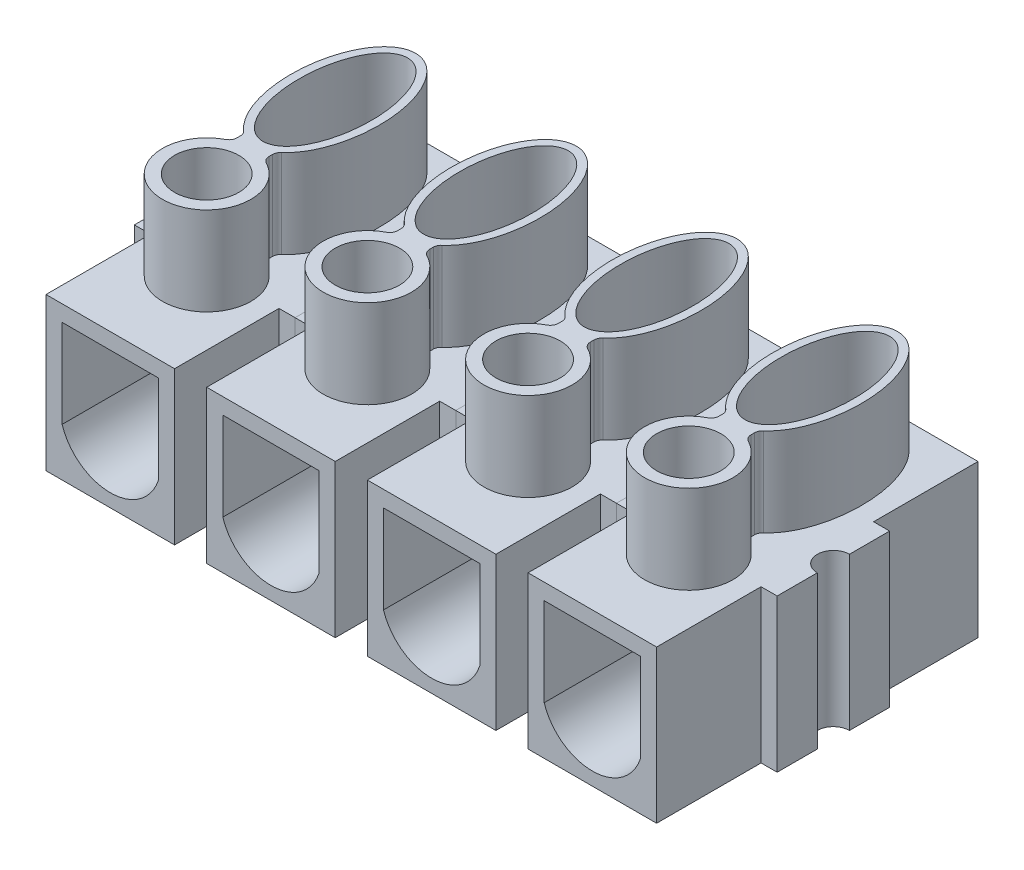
ISO-10303-21;
HEADER;
FILE_DESCRIPTION(('STEP AP214'),'2;1');
FILE_NAME('part.step','',(''),(''),'','','');
FILE_SCHEMA(('AUTOMOTIVE_DESIGN { 1 0 10303 214 1 1 1 1 }'));
ENDSEC;
DATA;
#1=APPLICATION_CONTEXT('core data for automotive mechanical design processes');
#2=APPLICATION_PROTOCOL_DEFINITION('international standard','automotive_design',2000,#1);
#3=PRODUCT_CONTEXT('',#1,'mechanical');
#4=PRODUCT('Part','Part','',(#3));
#5=PRODUCT_RELATED_PRODUCT_CATEGORY('part','',(#4));
#6=PRODUCT_DEFINITION_FORMATION('','',#4);
#7=PRODUCT_DEFINITION_CONTEXT('part definition',#1,'design');
#8=PRODUCT_DEFINITION('design','',#6,#7);
#9=PRODUCT_DEFINITION_SHAPE('','',#8);
#10=(LENGTH_UNIT() NAMED_UNIT(*) SI_UNIT(.MILLI.,.METRE.));
#11=(NAMED_UNIT(*) PLANE_ANGLE_UNIT() SI_UNIT($,.RADIAN.));
#12=(NAMED_UNIT(*) SI_UNIT($,.STERADIAN.) SOLID_ANGLE_UNIT());
#13=UNCERTAINTY_MEASURE_WITH_UNIT(LENGTH_MEASURE(1.E-05),#10,'distance_accuracy_value','');
#14=(GEOMETRIC_REPRESENTATION_CONTEXT(3) GLOBAL_UNCERTAINTY_ASSIGNED_CONTEXT((#13)) GLOBAL_UNIT_ASSIGNED_CONTEXT((#10,
#11,#12)) REPRESENTATION_CONTEXT('',''));
#15=CARTESIAN_POINT('',(0.,0.,0.));
#16=DIRECTION('',(0.,0.,1.));
#17=DIRECTION('',(1.,0.,0.));
#18=AXIS2_PLACEMENT_3D('',#15,#16,#17);
#19=CARTESIAN_POINT('',(26.,0.,10.));
#20=DIRECTION('',(0.,-1.,0.));
#21=DIRECTION('',(0.,0.,-1.));
#22=AXIS2_PLACEMENT_3D('',#19,#20,#21);
#23=PLANE('',#22);
#24=DIRECTION('',(0.,0.,1.));
#25=VECTOR('',#24,1.);
#26=CARTESIAN_POINT('',(25.,0.,3.5));
#27=LINE('',#26,#25);
#28=CARTESIAN_POINT('',(25.,0.,-3.5));
#29=VERTEX_POINT('',#28);
#30=CARTESIAN_POINT('',(25.,0.,-1.));
#31=VERTEX_POINT('',#30);
#32=EDGE_CURVE('E244',#29,#31,#27,.T.);
#33=ORIENTED_EDGE('',*,*,#32,.T.);
#34=CARTESIAN_POINT('',(25.,0.,0.));
#35=DIRECTION('',(0.,1.,0.));
#36=DIRECTION('',(0.,0.,-1.));
#37=AXIS2_PLACEMENT_3D('',#34,#35,#36);
#38=CIRCLE('',#37,1.);
#39=CARTESIAN_POINT('',(25.,0.,1.));
#40=VERTEX_POINT('',#39);
#41=EDGE_CURVE('E227',#40,#31,#38,.T.);
#42=ORIENTED_EDGE('',*,*,#41,.F.);
#43=CARTESIAN_POINT('',(25.,0.,3.5));
#44=VERTEX_POINT('',#43);
#45=EDGE_CURVE('E241',#40,#44,#27,.T.);
#46=ORIENTED_EDGE('',*,*,#45,.T.);
#47=DIRECTION('',(1.,0.,0.));
#48=VECTOR('',#47,1.);
#49=CARTESIAN_POINT('',(25.,0.,3.5));
#50=LINE('',#49,#48);
#51=CARTESIAN_POINT('',(26.,0.,3.5));
#52=VERTEX_POINT('',#51);
#53=EDGE_CURVE('E273',#44,#52,#50,.T.);
#54=ORIENTED_EDGE('',*,*,#53,.T.);
#55=DIRECTION('',(0.,0.,-1.));
#56=VECTOR('',#55,1.);
#57=CARTESIAN_POINT('',(26.,0.,10.));
#58=LINE('',#57,#56);
#59=CARTESIAN_POINT('',(26.,0.,10.));
#60=VERTEX_POINT('',#59);
#61=EDGE_CURVE('E313',#60,#52,#58,.T.);
#62=ORIENTED_EDGE('',*,*,#61,.F.);
#63=DIRECTION('',(-1.,0.,0.));
#64=VECTOR('',#63,1.);
#65=CARTESIAN_POINT('',(26.,0.,10.));
#66=LINE('',#65,#64);
#67=CARTESIAN_POINT('',(34.,0.,10.));
#68=VERTEX_POINT('',#67);
#69=EDGE_CURVE('E307',#68,#60,#66,.T.);
#70=ORIENTED_EDGE('',*,*,#69,.F.);
#71=DIRECTION('',(0.,0.,-1.));
#72=VECTOR('',#71,1.);
#73=CARTESIAN_POINT('',(34.,0.,10.));
#74=LINE('',#73,#72);
#75=CARTESIAN_POINT('',(34.,0.,3.5));
#76=VERTEX_POINT('',#75);
#77=EDGE_CURVE('E295',#68,#76,#74,.T.);
#78=ORIENTED_EDGE('',*,*,#77,.T.);
#79=DIRECTION('',(-1.,0.,0.));
#80=VECTOR('',#79,1.);
#81=CARTESIAN_POINT('',(35.,0.,3.5));
#82=LINE('',#81,#80);
#83=CARTESIAN_POINT('',(35.,0.,3.5));
#84=VERTEX_POINT('',#83);
#85=EDGE_CURVE('E276',#84,#76,#82,.T.);
#86=ORIENTED_EDGE('',*,*,#85,.F.);
#87=DIRECTION('',(0.,0.,1.));
#88=VECTOR('',#87,1.);
#89=CARTESIAN_POINT('',(35.,0.,3.5));
#90=LINE('',#89,#88);
#91=CARTESIAN_POINT('',(35.,0.,1.));
#92=VERTEX_POINT('',#91);
#93=EDGE_CURVE('E379',#92,#84,#90,.T.);
#94=ORIENTED_EDGE('',*,*,#93,.F.);
#95=CARTESIAN_POINT('',(35.,0.,0.));
#96=DIRECTION('',(0.,1.,0.));
#97=DIRECTION('',(0.,0.,1.));
#98=AXIS2_PLACEMENT_3D('',#95,#96,#97);
#99=CIRCLE('',#98,1.);
#100=CARTESIAN_POINT('',(35.,0.,-1.));
#101=VERTEX_POINT('',#100);
#102=EDGE_CURVE('E440',#101,#92,#99,.T.);
#103=ORIENTED_EDGE('',*,*,#102,.F.);
#104=CARTESIAN_POINT('',(35.,0.,-3.5));
#105=VERTEX_POINT('',#104);
#106=EDGE_CURVE('E280',#105,#101,#90,.T.);
#107=ORIENTED_EDGE('',*,*,#106,.F.);
#108=DIRECTION('',(-1.,0.,0.));
#109=VECTOR('',#108,1.);
#110=CARTESIAN_POINT('',(35.,0.,-3.5));
#111=LINE('',#110,#109);
#112=CARTESIAN_POINT('',(34.,0.,-3.5));
#113=VERTEX_POINT('',#112);
#114=EDGE_CURVE('E279',#105,#113,#111,.T.);
#115=ORIENTED_EDGE('',*,*,#114,.T.);
#116=CARTESIAN_POINT('',(34.,0.,-10.));
#117=VERTEX_POINT('',#116);
#118=EDGE_CURVE('E300',#113,#117,#74,.T.);
#119=ORIENTED_EDGE('',*,*,#118,.T.);
#120=DIRECTION('',(-1.,0.,0.));
#121=VECTOR('',#120,1.);
#122=CARTESIAN_POINT('',(26.,0.,-10.));
#123=LINE('',#122,#121);
#124=CARTESIAN_POINT('',(26.,0.,-10.));
#125=VERTEX_POINT('',#124);
#126=EDGE_CURVE('E335',#117,#125,#123,.T.);
#127=ORIENTED_EDGE('',*,*,#126,.T.);
#128=CARTESIAN_POINT('',(26.,0.,-3.5));
#129=VERTEX_POINT('',#128);
#130=EDGE_CURVE('E311',#129,#125,#58,.T.);
#131=ORIENTED_EDGE('',*,*,#130,.F.);
#132=DIRECTION('',(1.,0.,0.));
#133=VECTOR('',#132,1.);
#134=CARTESIAN_POINT('',(25.,0.,-3.5));
#135=LINE('',#134,#133);
#136=EDGE_CURVE('E426',#29,#129,#135,.T.);
#137=ORIENTED_EDGE('',*,*,#136,.F.);
#138=EDGE_LOOP('',(#33,#42,#46,#54,#62,#70,#78,#86,#94,#103,#107,#115,#119,#127,#131,#137));
#139=FACE_BOUND('',#138,.T.);
#140=CARTESIAN_POINT('',(30.,0.,4.));
#141=DIRECTION('',(0.,-1.,0.));
#142=DIRECTION('',(0.,0.,-1.));
#143=AXIS2_PLACEMENT_3D('',#140,#141,#142);
#144=CIRCLE('',#143,2.75);
#145=CARTESIAN_POINT('',(28.7307692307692,0.,1.56041945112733));
#146=VERTEX_POINT('',#145);
#147=CARTESIAN_POINT('',(31.2692307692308,0.,1.56041945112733));
#148=VERTEX_POINT('',#147);
#149=EDGE_CURVE('E235',#146,#148,#144,.F.);
#150=ORIENTED_EDGE('',*,*,#149,.F.);
#151=CARTESIAN_POINT('',(28.5,0.,1.1168593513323));
#152=DIRECTION('',(0.,-1.,0.));
#153=DIRECTION('',(0.,0.,-1.));
#154=AXIS2_PLACEMENT_3D('',#151,#152,#153);
#155=CIRCLE('',#154,0.5);
#156=CARTESIAN_POINT('',(29.,0.,1.1168593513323));
#157=VERTEX_POINT('',#156);
#158=EDGE_CURVE('E470',#146,#157,#155,.F.);
#159=ORIENTED_EDGE('',*,*,#158,.T.);
#160=DIRECTION('',(0.,0.,-1.));
#161=VECTOR('',#160,1.);
#162=CARTESIAN_POINT('',(29.,0.,1.5));
#163=LINE('',#162,#161);
#164=CARTESIAN_POINT('',(29.,0.,0.900582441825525));
#165=VERTEX_POINT('',#164);
#166=EDGE_CURVE('E508',#157,#165,#163,.T.);
#167=ORIENTED_EDGE('',*,*,#166,.T.);
#168=CARTESIAN_POINT('',(28.5,0.,0.900582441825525));
#169=DIRECTION('',(0.,-1.,0.));
#170=DIRECTION('',(0.,0.,-1.));
#171=AXIS2_PLACEMENT_3D('',#168,#169,#170);
#172=CIRCLE('',#171,0.5);
#173=CARTESIAN_POINT('',(28.8257146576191,0.,0.521227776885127));
#174=VERTEX_POINT('',#173);
#175=EDGE_CURVE('E468',#165,#174,#172,.F.);
#176=ORIENTED_EDGE('',*,*,#175,.T.);
#177=CARTESIAN_POINT('',(30.,0.,-4.));
#178=DIRECTION('',(0.,1.,0.));
#179=DIRECTION('',(0.,0.,1.));
#180=AXIS2_PLACEMENT_3D('',#177,#178,#179);
#181=ELLIPSE('',#180,5.,2.75);
#182=CARTESIAN_POINT('',(31.1742853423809,0.,0.521227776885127));
#183=VERTEX_POINT('',#182);
#184=EDGE_CURVE('E451',#183,#174,#181,.T.);
#185=ORIENTED_EDGE('',*,*,#184,.F.);
#186=CARTESIAN_POINT('',(31.5,0.,0.900582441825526));
#187=DIRECTION('',(0.,-1.,0.));
#188=DIRECTION('',(0.,0.,-1.));
#189=AXIS2_PLACEMENT_3D('',#186,#187,#188);
#190=CIRCLE('',#189,0.5);
#191=CARTESIAN_POINT('',(31.,0.,0.900582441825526));
#192=VERTEX_POINT('',#191);
#193=EDGE_CURVE('E466',#183,#192,#190,.F.);
#194=ORIENTED_EDGE('',*,*,#193,.T.);
#195=DIRECTION('',(0.,0.,-1.));
#196=VECTOR('',#195,1.);
#197=CARTESIAN_POINT('',(31.,0.,1.5));
#198=LINE('',#197,#196);
#199=CARTESIAN_POINT('',(31.,0.,1.1168593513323));
#200=VERTEX_POINT('',#199);
#201=EDGE_CURVE('E504',#200,#192,#198,.T.);
#202=ORIENTED_EDGE('',*,*,#201,.F.);
#203=CARTESIAN_POINT('',(31.5,0.,1.1168593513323));
#204=DIRECTION('',(0.,-1.,0.));
#205=DIRECTION('',(0.,0.,-1.));
#206=AXIS2_PLACEMENT_3D('',#203,#204,#205);
#207=CIRCLE('',#206,0.5);
#208=EDGE_CURVE('E464',#200,#148,#207,.F.);
#209=ORIENTED_EDGE('',*,*,#208,.T.);
#210=EDGE_LOOP('',(#150,#159,#167,#176,#185,#194,#202,#209));
#211=FACE_BOUND('',#210,.T.);
#212=ADVANCED_FACE('F40',(#139,#211),#23,.F.);
#213=CARTESIAN_POINT('',(30.,5.5,4.));
#214=DIRECTION('',(0.,-1.,0.));
#215=DIRECTION('',(0.,0.,-1.));
#216=AXIS2_PLACEMENT_3D('',#213,#214,#215);
#217=CYLINDRICAL_SURFACE('',#216,2.75);
#218=CARTESIAN_POINT('',(30.,5.5,4.));
#219=DIRECTION('',(0.,1.,0.));
#220=DIRECTION('',(0.,0.,1.));
#221=AXIS2_PLACEMENT_3D('',#218,#219,#220);
#222=CIRCLE('',#221,2.75);
#223=CARTESIAN_POINT('',(28.7307692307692,5.5,1.56041945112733));
#224=VERTEX_POINT('',#223);
#225=CARTESIAN_POINT('',(31.2692307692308,5.5,1.56041945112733));
#226=VERTEX_POINT('',#225);
#227=EDGE_CURVE('E788',#224,#226,#222,.T.);
#228=ORIENTED_EDGE('',*,*,#227,.F.);
#229=DIRECTION('',(0.,-1.,0.));
#230=VECTOR('',#229,1.);
#231=CARTESIAN_POINT('',(28.7307692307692,5.5,1.56041945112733));
#232=LINE('',#231,#230);
#233=EDGE_CURVE('E462',#224,#146,#232,.T.);
#234=ORIENTED_EDGE('',*,*,#233,.T.);
#235=ORIENTED_EDGE('',*,*,#149,.T.);
#236=DIRECTION('',(0.,-1.,0.));
#237=VECTOR('',#236,1.);
#238=CARTESIAN_POINT('',(31.2692307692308,5.5,1.56041945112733));
#239=LINE('',#238,#237);
#240=EDGE_CURVE('E460',#148,#226,#239,.F.);
#241=ORIENTED_EDGE('',*,*,#240,.T.);
#242=EDGE_LOOP('',(#228,#234,#235,#241));
#243=FACE_BOUND('',#242,.T.);
#244=ADVANCED_FACE('F534',(#243),#217,.T.);
#245=CARTESIAN_POINT('',(30.,5.5,-4.));
#246=DIRECTION('',(0.,1.,0.));
#247=DIRECTION('',(0.,0.,1.));
#248=AXIS2_PLACEMENT_3D('',#245,#246,#247);
#249=ELLIPSE('',#248,5.,2.75);
#250=DIRECTION('',(0.,-1.,0.));
#251=VECTOR('',#250,1.);
#252=SURFACE_OF_LINEAR_EXTRUSION('',#249,#251);
#253=ORIENTED_EDGE('',*,*,#184,.T.);
#254=DIRECTION('',(0.,-1.,0.));
#255=VECTOR('',#254,1.);
#256=CARTESIAN_POINT('',(28.8257146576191,0.,0.521227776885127));
#257=LINE('',#256,#255);
#258=CARTESIAN_POINT('',(28.8257146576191,5.5,0.521227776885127));
#259=VERTEX_POINT('',#258);
#260=EDGE_CURVE('E474',#174,#259,#257,.F.);
#261=ORIENTED_EDGE('',*,*,#260,.T.);
#262=CARTESIAN_POINT('',(31.1742853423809,5.5,0.521227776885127));
#263=VERTEX_POINT('',#262);
#264=EDGE_CURVE('E489',#263,#259,#249,.T.);
#265=ORIENTED_EDGE('',*,*,#264,.F.);
#266=DIRECTION('',(0.,-1.,0.));
#267=VECTOR('',#266,1.);
#268=CARTESIAN_POINT('',(31.1742853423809,5.5,0.521227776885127));
#269=LINE('',#268,#267);
#270=EDGE_CURVE('E472',#263,#183,#269,.T.);
#271=ORIENTED_EDGE('',*,*,#270,.T.);
#272=EDGE_LOOP('',(#253,#261,#265,#271));
#273=FACE_BOUND('',#272,.T.);
#274=ADVANCED_FACE('F493',(#273),#252,.F.);
#275=CARTESIAN_POINT('',(30.,0.,-4.));
#276=DIRECTION('',(0.,1.,0.));
#277=DIRECTION('',(0.,0.,1.));
#278=AXIS2_PLACEMENT_3D('',#275,#276,#277);
#279=ELLIPSE('',#278,4.5,2.25);
#280=CARTESIAN_POINT('',(30.,0.,0.5));
#281=VERTEX_POINT('',#280);
#282=EDGE_CURVE('E511',#281,#281,#279,.T.);
#283=ORIENTED_EDGE('',*,*,#282,.T.);
#284=EDGE_LOOP('',(#283));
#285=FACE_BOUND('',#284,.T.);
#286=CARTESIAN_POINT('',(30.,0.,-4.));
#287=DIRECTION('',(0.,1.,0.));
#288=DIRECTION('',(0.,0.,1.));
#289=AXIS2_PLACEMENT_3D('',#286,#287,#288);
#290=CIRCLE('',#289,2.);
#291=CARTESIAN_POINT('',(30.,0.,-2.));
#292=VERTEX_POINT('',#291);
#293=EDGE_CURVE('E448',#292,#292,#290,.T.);
#294=ORIENTED_EDGE('',*,*,#293,.F.);
#295=EDGE_LOOP('',(#294));
#296=FACE_BOUND('',#295,.T.);
#297=ADVANCED_FACE('F533',(#285,#296),#23,.F.);
#298=CARTESIAN_POINT('',(25.,-9.5,3.5));
#299=DIRECTION('',(-1.,0.,0.));
#300=DIRECTION('',(0.,1.,0.));
#301=AXIS2_PLACEMENT_3D('',#298,#299,#300);
#302=PLANE('',#301);
#303=DIRECTION('',(0.,1.,0.));
#304=VECTOR('',#303,1.);
#305=CARTESIAN_POINT('',(25.,-9.50005,1.));
#306=LINE('',#305,#304);
#307=CARTESIAN_POINT('',(25.,-9.5,1.));
#308=VERTEX_POINT('',#307);
#309=EDGE_CURVE('E224',#308,#40,#306,.T.);
#310=ORIENTED_EDGE('',*,*,#309,.F.);
#311=DIRECTION('',(0.,0.,-1.));
#312=VECTOR('',#311,1.);
#313=CARTESIAN_POINT('',(25.,-9.5,3.5));
#314=LINE('',#313,#312);
#315=CARTESIAN_POINT('',(25.,-9.5,3.5));
#316=VERTEX_POINT('',#315);
#317=EDGE_CURVE('E260',#316,#308,#314,.T.);
#318=ORIENTED_EDGE('',*,*,#317,.F.);
#319=DIRECTION('',(0.,-1.,0.));
#320=VECTOR('',#319,1.);
#321=CARTESIAN_POINT('',(25.,0.,3.5));
#322=LINE('',#321,#320);
#323=EDGE_CURVE('E250',#44,#316,#322,.T.);
#324=ORIENTED_EDGE('',*,*,#323,.F.);
#325=ORIENTED_EDGE('',*,*,#45,.F.);
#326=EDGE_LOOP('',(#310,#318,#324,#325));
#327=FACE_BOUND('',#326,.T.);
#328=ADVANCED_FACE('F248',(#327),#302,.T.);
#329=CARTESIAN_POINT('',(35.,-9.5,3.5));
#330=DIRECTION('',(1.,0.,0.));
#331=DIRECTION('',(0.,1.,0.));
#332=AXIS2_PLACEMENT_3D('',#329,#330,#331);
#333=PLANE('',#332);
#334=DIRECTION('',(0.,1.,0.));
#335=VECTOR('',#334,1.);
#336=CARTESIAN_POINT('',(35.,-9.50005,-1.));
#337=LINE('',#336,#335);
#338=CARTESIAN_POINT('',(35.,-9.5,-1.));
#339=VERTEX_POINT('',#338);
#340=EDGE_CURVE('E436',#339,#101,#337,.T.);
#341=ORIENTED_EDGE('',*,*,#340,.F.);
#342=DIRECTION('',(0.,0.,-1.));
#343=VECTOR('',#342,1.);
#344=CARTESIAN_POINT('',(35.,-9.5,3.5));
#345=LINE('',#344,#343);
#346=CARTESIAN_POINT('',(35.,-9.5,-3.5));
#347=VERTEX_POINT('',#346);
#348=EDGE_CURVE('E383',#339,#347,#345,.T.);
#349=ORIENTED_EDGE('',*,*,#348,.T.);
#350=DIRECTION('',(0.,1.,0.));
#351=VECTOR('',#350,1.);
#352=CARTESIAN_POINT('',(35.,0.,-3.5));
#353=LINE('',#352,#351);
#354=EDGE_CURVE('E380',#347,#105,#353,.T.);
#355=ORIENTED_EDGE('',*,*,#354,.T.);
#356=ORIENTED_EDGE('',*,*,#106,.T.);
#357=EDGE_LOOP('',(#341,#349,#355,#356));
#358=FACE_BOUND('',#357,.T.);
#359=ADVANCED_FACE('F568',(#358),#333,.T.);
#360=CARTESIAN_POINT('',(26.,0.,10.));
#361=DIRECTION('',(1.,0.,0.));
#362=DIRECTION('',(0.,1.,0.));
#363=AXIS2_PLACEMENT_3D('',#360,#361,#362);
#364=PLANE('',#363);
#365=ORIENTED_EDGE('',*,*,#61,.T.);
#366=DIRECTION('',(0.,-1.,0.));
#367=VECTOR('',#366,1.);
#368=CARTESIAN_POINT('',(26.,0.,3.5));
#369=LINE('',#368,#367);
#370=CARTESIAN_POINT('',(26.,-9.5,3.5));
#371=VERTEX_POINT('',#370);
#372=EDGE_CURVE('E425',#52,#371,#369,.T.);
#373=ORIENTED_EDGE('',*,*,#372,.T.);
#374=DIRECTION('',(0.,0.,-1.));
#375=VECTOR('',#374,1.);
#376=CARTESIAN_POINT('',(26.,-9.5,10.));
#377=LINE('',#376,#375);
#378=CARTESIAN_POINT('',(26.,-9.5,10.));
#379=VERTEX_POINT('',#378);
#380=EDGE_CURVE('E283',#379,#371,#377,.T.);
#381=ORIENTED_EDGE('',*,*,#380,.F.);
#382=DIRECTION('',(0.,-1.,0.));
#383=VECTOR('',#382,1.);
#384=CARTESIAN_POINT('',(26.,0.,10.));
#385=LINE('',#384,#383);
#386=EDGE_CURVE('E331',#60,#379,#385,.T.);
#387=ORIENTED_EDGE('',*,*,#386,.F.);
#388=EDGE_LOOP('',(#365,#373,#381,#387));
#389=FACE_BOUND('',#388,.T.);
#390=ADVANCED_FACE('F418',(#389),#364,.F.);
#391=CARTESIAN_POINT('',(34.,0.,10.));
#392=DIRECTION('',(-1.,0.,0.));
#393=DIRECTION('',(0.,-1.,0.));
#394=AXIS2_PLACEMENT_3D('',#391,#392,#393);
#395=PLANE('',#394);
#396=DIRECTION('',(0.,-1.,0.));
#397=VECTOR('',#396,1.);
#398=CARTESIAN_POINT('',(34.,0.,3.5));
#399=LINE('',#398,#397);
#400=CARTESIAN_POINT('',(34.,-9.5,3.5));
#401=VERTEX_POINT('',#400);
#402=EDGE_CURVE('E268',#76,#401,#399,.T.);
#403=ORIENTED_EDGE('',*,*,#402,.F.);
#404=ORIENTED_EDGE('',*,*,#77,.F.);
#405=DIRECTION('',(0.,1.,0.));
#406=VECTOR('',#405,1.);
#407=CARTESIAN_POINT('',(34.,0.,10.));
#408=LINE('',#407,#406);
#409=CARTESIAN_POINT('',(34.,-9.5,10.));
#410=VERTEX_POINT('',#409);
#411=EDGE_CURVE('E324',#410,#68,#408,.T.);
#412=ORIENTED_EDGE('',*,*,#411,.F.);
#413=DIRECTION('',(0.,0.,-1.));
#414=VECTOR('',#413,1.);
#415=CARTESIAN_POINT('',(34.,-9.5,10.));
#416=LINE('',#415,#414);
#417=EDGE_CURVE('E408',#410,#401,#416,.T.);
#418=ORIENTED_EDGE('',*,*,#417,.T.);
#419=EDGE_LOOP('',(#403,#404,#412,#418));
#420=FACE_BOUND('',#419,.T.);
#421=ADVANCED_FACE('F414',(#420),#395,.F.);
#422=DIRECTION('',(0.,1.,0.));
#423=VECTOR('',#422,1.);
#424=CARTESIAN_POINT('',(34.,0.,-3.5));
#425=LINE('',#424,#423);
#426=CARTESIAN_POINT('',(34.,-9.5,-3.5));
#427=VERTEX_POINT('',#426);
#428=EDGE_CURVE('E272',#427,#113,#425,.T.);
#429=ORIENTED_EDGE('',*,*,#428,.F.);
#430=CARTESIAN_POINT('',(34.,-9.5,-10.));
#431=VERTEX_POINT('',#430);
#432=EDGE_CURVE('E299',#427,#431,#416,.T.);
#433=ORIENTED_EDGE('',*,*,#432,.T.);
#434=DIRECTION('',(0.,1.,0.));
#435=VECTOR('',#434,1.);
#436=CARTESIAN_POINT('',(34.,0.,-10.));
#437=LINE('',#436,#435);
#438=EDGE_CURVE('E337',#431,#117,#437,.T.);
#439=ORIENTED_EDGE('',*,*,#438,.T.);
#440=ORIENTED_EDGE('',*,*,#118,.F.);
#441=EDGE_LOOP('',(#429,#433,#439,#440));
#442=FACE_BOUND('',#441,.T.);
#443=ADVANCED_FACE('F595',(#442),#395,.F.);
#444=CARTESIAN_POINT('',(26.,-9.5,10.));
#445=DIRECTION('',(0.,0.,1.));
#446=DIRECTION('',(1.,0.,0.));
#447=AXIS2_PLACEMENT_3D('',#444,#445,#446);
#448=PLANE('',#447);
#449=ORIENTED_EDGE('',*,*,#386,.T.);
#450=DIRECTION('',(1.,0.,0.));
#451=VECTOR('',#450,1.);
#452=CARTESIAN_POINT('',(26.,-9.5,10.));
#453=LINE('',#452,#451);
#454=EDGE_CURVE('E328',#379,#410,#453,.T.);
#455=ORIENTED_EDGE('',*,*,#454,.T.);
#456=ORIENTED_EDGE('',*,*,#411,.T.);
#457=ORIENTED_EDGE('',*,*,#69,.T.);
#458=EDGE_LOOP('',(#449,#455,#456,#457));
#459=FACE_BOUND('',#458,.T.);
#460=CARTESIAN_POINT('',(30.0012966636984,-5.53549064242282,10.));
#461=DIRECTION('',(0.,0.,1.));
#462=DIRECTION('',(1.,0.,0.));
#463=AXIS2_PLACEMENT_3D('',#460,#461,#462);
#464=CIRCLE('',#463,3.15);
#465=CARTESIAN_POINT('',(27.0025933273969,-6.5,10.));
#466=VERTEX_POINT('',#465);
#467=CARTESIAN_POINT('',(33.,-6.5,10.));
#468=VERTEX_POINT('',#467);
#469=EDGE_CURVE('E360',#466,#468,#464,.T.);
#470=ORIENTED_EDGE('',*,*,#469,.F.);
#471=DIRECTION('',(0.,-1.,0.));
#472=VECTOR('',#471,1.);
#473=CARTESIAN_POINT('',(27.0025933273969,-1.,10.));
#474=LINE('',#473,#472);
#475=CARTESIAN_POINT('',(27.0025933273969,-1.,10.));
#476=VERTEX_POINT('',#475);
#477=EDGE_CURVE('E362',#476,#466,#474,.T.);
#478=ORIENTED_EDGE('',*,*,#477,.F.);
#479=DIRECTION('',(-1.,0.,0.));
#480=VECTOR('',#479,1.);
#481=CARTESIAN_POINT('',(27.0025933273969,-1.,10.));
#482=LINE('',#481,#480);
#483=CARTESIAN_POINT('',(33.,-0.999999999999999,10.));
#484=VERTEX_POINT('',#483);
#485=EDGE_CURVE('E355',#484,#476,#482,.T.);
#486=ORIENTED_EDGE('',*,*,#485,.F.);
#487=DIRECTION('',(0.,1.,0.));
#488=VECTOR('',#487,1.);
#489=CARTESIAN_POINT('',(33.,-1.,10.));
#490=LINE('',#489,#488);
#491=EDGE_CURVE('E357',#468,#484,#490,.T.);
#492=ORIENTED_EDGE('',*,*,#491,.F.);
#493=EDGE_LOOP('',(#470,#478,#486,#492));
#494=FACE_BOUND('',#493,.T.);
#495=ADVANCED_FACE('F419',(#459,#494),#448,.T.);
#496=CARTESIAN_POINT('',(26.,-9.5,-10.));
#497=DIRECTION('',(0.,0.,1.));
#498=DIRECTION('',(1.,0.,0.));
#499=AXIS2_PLACEMENT_3D('',#496,#497,#498);
#500=PLANE('',#499);
#501=DIRECTION('',(0.,-1.,0.));
#502=VECTOR('',#501,1.);
#503=CARTESIAN_POINT('',(26.,0.,-10.));
#504=LINE('',#503,#502);
#505=CARTESIAN_POINT('',(26.,-9.5,-10.));
#506=VERTEX_POINT('',#505);
#507=EDGE_CURVE('E343',#125,#506,#504,.T.);
#508=ORIENTED_EDGE('',*,*,#507,.F.);
#509=ORIENTED_EDGE('',*,*,#126,.F.);
#510=ORIENTED_EDGE('',*,*,#438,.F.);
#511=DIRECTION('',(1.,0.,0.));
#512=VECTOR('',#511,1.);
#513=CARTESIAN_POINT('',(26.,-9.5,-10.));
#514=LINE('',#513,#512);
#515=EDGE_CURVE('E340',#506,#431,#514,.T.);
#516=ORIENTED_EDGE('',*,*,#515,.F.);
#517=EDGE_LOOP('',(#508,#509,#510,#516));
#518=FACE_BOUND('',#517,.T.);
#519=DIRECTION('',(0.,-1.,0.));
#520=VECTOR('',#519,1.);
#521=CARTESIAN_POINT('',(27.0025933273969,-1.,-10.));
#522=LINE('',#521,#520);
#523=CARTESIAN_POINT('',(27.0025933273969,-0.999999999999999,-10.));
#524=VERTEX_POINT('',#523);
#525=CARTESIAN_POINT('',(27.0025933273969,-6.5,-10.));
#526=VERTEX_POINT('',#525);
#527=EDGE_CURVE('E373',#524,#526,#522,.T.);
#528=ORIENTED_EDGE('',*,*,#527,.T.);
#529=CARTESIAN_POINT('',(30.0012966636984,-5.53549064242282,-10.));
#530=DIRECTION('',(0.,0.,1.));
#531=DIRECTION('',(1.,0.,0.));
#532=AXIS2_PLACEMENT_3D('',#529,#530,#531);
#533=CIRCLE('',#532,3.15);
#534=CARTESIAN_POINT('',(33.,-6.5,-10.));
#535=VERTEX_POINT('',#534);
#536=EDGE_CURVE('E370',#526,#535,#533,.T.);
#537=ORIENTED_EDGE('',*,*,#536,.T.);
#538=DIRECTION('',(0.,1.,0.));
#539=VECTOR('',#538,1.);
#540=CARTESIAN_POINT('',(33.,-1.,-10.));
#541=LINE('',#540,#539);
#542=CARTESIAN_POINT('',(33.,-1.,-10.));
#543=VERTEX_POINT('',#542);
#544=EDGE_CURVE('E367',#535,#543,#541,.T.);
#545=ORIENTED_EDGE('',*,*,#544,.T.);
#546=DIRECTION('',(-1.,0.,0.));
#547=VECTOR('',#546,1.);
#548=CARTESIAN_POINT('',(27.0025933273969,-1.,-10.));
#549=LINE('',#548,#547);
#550=EDGE_CURVE('E364',#543,#524,#549,.T.);
#551=ORIENTED_EDGE('',*,*,#550,.T.);
#552=EDGE_LOOP('',(#528,#537,#545,#551));
#553=FACE_BOUND('',#552,.T.);
#554=ADVANCED_FACE('F589',(#518,#553),#500,.F.);
#555=CARTESIAN_POINT('',(26.,-9.5,-3.5));
#556=VERTEX_POINT('',#555);
#557=EDGE_CURVE('E288',#556,#506,#377,.T.);
#558=ORIENTED_EDGE('',*,*,#557,.F.);
#559=DIRECTION('',(0.,1.,0.));
#560=VECTOR('',#559,1.);
#561=CARTESIAN_POINT('',(26.,0.,-3.5));
#562=LINE('',#561,#560);
#563=EDGE_CURVE('E253',#556,#129,#562,.T.);
#564=ORIENTED_EDGE('',*,*,#563,.T.);
#565=ORIENTED_EDGE('',*,*,#130,.T.);
#566=ORIENTED_EDGE('',*,*,#507,.T.);
#567=EDGE_LOOP('',(#558,#564,#565,#566));
#568=FACE_BOUND('',#567,.T.);
#569=ADVANCED_FACE('F42',(#568),#364,.F.);
#570=CARTESIAN_POINT('',(26.,-9.5,10.));
#571=DIRECTION('',(0.,1.,0.));
#572=DIRECTION('',(0.,0.,1.));
#573=AXIS2_PLACEMENT_3D('',#570,#571,#572);
#574=PLANE('',#573);
#575=ORIENTED_EDGE('',*,*,#317,.T.);
#576=CARTESIAN_POINT('',(25.,-9.5,0.));
#577=DIRECTION('',(0.,1.,0.));
#578=DIRECTION('',(0.,0.,1.));
#579=AXIS2_PLACEMENT_3D('',#576,#577,#578);
#580=CIRCLE('',#579,1.);
#581=CARTESIAN_POINT('',(25.,-9.5,-1.));
#582=VERTEX_POINT('',#581);
#583=EDGE_CURVE('E230',#308,#582,#580,.T.);
#584=ORIENTED_EDGE('',*,*,#583,.T.);
#585=CARTESIAN_POINT('',(25.,-9.5,-3.5));
#586=VERTEX_POINT('',#585);
#587=EDGE_CURVE('E259',#582,#586,#314,.T.);
#588=ORIENTED_EDGE('',*,*,#587,.T.);
#589=DIRECTION('',(1.,0.,0.));
#590=VECTOR('',#589,1.);
#591=CARTESIAN_POINT('',(25.,-9.5,-3.5));
#592=LINE('',#591,#590);
#593=EDGE_CURVE('E422',#586,#556,#592,.T.);
#594=ORIENTED_EDGE('',*,*,#593,.T.);
#595=ORIENTED_EDGE('',*,*,#557,.T.);
#596=ORIENTED_EDGE('',*,*,#515,.T.);
#597=ORIENTED_EDGE('',*,*,#432,.F.);
#598=DIRECTION('',(-1.,0.,0.));
#599=VECTOR('',#598,1.);
#600=CARTESIAN_POINT('',(35.,-9.5,-3.5));
#601=LINE('',#600,#599);
#602=EDGE_CURVE('E399',#347,#427,#601,.T.);
#603=ORIENTED_EDGE('',*,*,#602,.F.);
#604=ORIENTED_EDGE('',*,*,#348,.F.);
#605=CARTESIAN_POINT('',(35.,-9.5,0.));
#606=DIRECTION('',(0.,1.,0.));
#607=DIRECTION('',(0.,0.,1.));
#608=AXIS2_PLACEMENT_3D('',#605,#606,#607);
#609=CIRCLE('',#608,1.);
#610=CARTESIAN_POINT('',(35.,-9.5,1.));
#611=VERTEX_POINT('',#610);
#612=EDGE_CURVE('E438',#339,#611,#609,.T.);
#613=ORIENTED_EDGE('',*,*,#612,.T.);
#614=CARTESIAN_POINT('',(35.,-9.5,3.5));
#615=VERTEX_POINT('',#614);
#616=EDGE_CURVE('E382',#615,#611,#345,.T.);
#617=ORIENTED_EDGE('',*,*,#616,.F.);
#618=DIRECTION('',(-1.,0.,0.));
#619=VECTOR('',#618,1.);
#620=CARTESIAN_POINT('',(35.,-9.5,3.5));
#621=LINE('',#620,#619);
#622=EDGE_CURVE('E376',#615,#401,#621,.T.);
#623=ORIENTED_EDGE('',*,*,#622,.T.);
#624=ORIENTED_EDGE('',*,*,#417,.F.);
#625=ORIENTED_EDGE('',*,*,#454,.F.);
#626=ORIENTED_EDGE('',*,*,#380,.T.);
#627=DIRECTION('',(1.,0.,0.));
#628=VECTOR('',#627,1.);
#629=CARTESIAN_POINT('',(25.,-9.5,3.5));
#630=LINE('',#629,#628);
#631=EDGE_CURVE('E262',#316,#371,#630,.T.);
#632=ORIENTED_EDGE('',*,*,#631,.F.);
#633=EDGE_LOOP('',(#575,#584,#588,#594,#595,#596,#597,#603,#604,#613,#617,#623,#624,#625,#626,#632));
#634=FACE_BOUND('',#633,.T.);
#635=ADVANCED_FACE('F407',(#634),#574,.F.);
#636=CARTESIAN_POINT('',(27.0025933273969,-1.,10.));
#637=DIRECTION('',(1.,0.,0.));
#638=DIRECTION('',(0.,1.,0.));
#639=AXIS2_PLACEMENT_3D('',#636,#637,#638);
#640=PLANE('',#639);
#641=ORIENTED_EDGE('',*,*,#527,.F.);
#642=DIRECTION('',(0.,0.,-1.));
#643=VECTOR('',#642,1.);
#644=CARTESIAN_POINT('',(27.0025933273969,-1.,10.));
#645=LINE('',#644,#643);
#646=EDGE_CURVE('E352',#476,#524,#645,.T.);
#647=ORIENTED_EDGE('',*,*,#646,.F.);
#648=ORIENTED_EDGE('',*,*,#477,.T.);
#649=DIRECTION('',(0.,0.,-1.));
#650=VECTOR('',#649,1.);
#651=CARTESIAN_POINT('',(27.0025933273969,-6.5,10.));
#652=LINE('',#651,#650);
#653=EDGE_CURVE('E345',#466,#526,#652,.T.);
#654=ORIENTED_EDGE('',*,*,#653,.T.);
#655=EDGE_LOOP('',(#641,#647,#648,#654));
#656=FACE_BOUND('',#655,.T.);
#657=ADVANCED_FACE('F584',(#656),#640,.T.);
#658=CARTESIAN_POINT('',(30.0012966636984,-5.53549064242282,10.));
#659=DIRECTION('',(0.,0.,-1.));
#660=DIRECTION('',(-1.,0.,0.));
#661=AXIS2_PLACEMENT_3D('',#658,#659,#660);
#662=CYLINDRICAL_SURFACE('',#661,3.15);
#663=ORIENTED_EDGE('',*,*,#536,.F.);
#664=ORIENTED_EDGE('',*,*,#653,.F.);
#665=ORIENTED_EDGE('',*,*,#469,.T.);
#666=DIRECTION('',(0.,0.,-1.));
#667=VECTOR('',#666,1.);
#668=CARTESIAN_POINT('',(33.,-6.5,10.));
#669=LINE('',#668,#667);
#670=EDGE_CURVE('E348',#468,#535,#669,.T.);
#671=ORIENTED_EDGE('',*,*,#670,.T.);
#672=EDGE_LOOP('',(#663,#664,#665,#671));
#673=FACE_BOUND('',#672,.T.);
#674=ADVANCED_FACE('F580',(#673),#662,.F.);
#675=CARTESIAN_POINT('',(33.,-1.,10.));
#676=DIRECTION('',(-1.,0.,0.));
#677=DIRECTION('',(0.,-1.,0.));
#678=AXIS2_PLACEMENT_3D('',#675,#676,#677);
#679=PLANE('',#678);
#680=ORIENTED_EDGE('',*,*,#544,.F.);
#681=ORIENTED_EDGE('',*,*,#670,.F.);
#682=ORIENTED_EDGE('',*,*,#491,.T.);
#683=DIRECTION('',(0.,0.,-1.));
#684=VECTOR('',#683,1.);
#685=CARTESIAN_POINT('',(33.,-1.,10.));
#686=LINE('',#685,#684);
#687=EDGE_CURVE('E350',#484,#543,#686,.T.);
#688=ORIENTED_EDGE('',*,*,#687,.T.);
#689=EDGE_LOOP('',(#680,#681,#682,#688));
#690=FACE_BOUND('',#689,.T.);
#691=ADVANCED_FACE('F576',(#690),#679,.T.);
#692=CARTESIAN_POINT('',(27.0025933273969,-1.,10.));
#693=DIRECTION('',(0.,-1.,0.));
#694=DIRECTION('',(0.,0.,-1.));
#695=AXIS2_PLACEMENT_3D('',#692,#693,#694);
#696=PLANE('',#695);
#697=CARTESIAN_POINT('',(30.,-1.,-4.));
#698=DIRECTION('',(0.,-1.,0.));
#699=DIRECTION('',(0.,0.,-1.));
#700=AXIS2_PLACEMENT_3D('',#697,#698,#699);
#701=CIRCLE('',#700,2.);
#702=CARTESIAN_POINT('',(30.,-1.,-6.));
#703=VERTEX_POINT('',#702);
#704=EDGE_CURVE('E445',#703,#703,#701,.T.);
#705=ORIENTED_EDGE('',*,*,#704,.F.);
#706=EDGE_LOOP('',(#705));
#707=FACE_BOUND('',#706,.T.);
#708=CARTESIAN_POINT('',(30.,-1.,4.));
#709=DIRECTION('',(0.,-1.,0.));
#710=DIRECTION('',(0.,0.,-1.));
#711=AXIS2_PLACEMENT_3D('',#708,#709,#710);
#712=CIRCLE('',#711,2.);
#713=CARTESIAN_POINT('',(30.,-1.,2.));
#714=VERTEX_POINT('',#713);
#715=EDGE_CURVE('E245',#714,#714,#712,.T.);
#716=ORIENTED_EDGE('',*,*,#715,.F.);
#717=EDGE_LOOP('',(#716));
#718=FACE_BOUND('',#717,.T.);
#719=ORIENTED_EDGE('',*,*,#550,.F.);
#720=ORIENTED_EDGE('',*,*,#687,.F.);
#721=ORIENTED_EDGE('',*,*,#485,.T.);
#722=ORIENTED_EDGE('',*,*,#646,.T.);
#723=EDGE_LOOP('',(#719,#720,#721,#722));
#724=FACE_BOUND('',#723,.T.);
#725=ADVANCED_FACE('F573',(#707,#718,#724),#696,.T.);
#726=CARTESIAN_POINT('',(35.,0.,3.5));
#727=DIRECTION('',(0.,0.,-1.));
#728=DIRECTION('',(0.,1.,0.));
#729=AXIS2_PLACEMENT_3D('',#726,#727,#728);
#730=PLANE('',#729);
#731=ORIENTED_EDGE('',*,*,#402,.T.);
#732=ORIENTED_EDGE('',*,*,#622,.F.);
#733=DIRECTION('',(0.,-1.,0.));
#734=VECTOR('',#733,1.);
#735=CARTESIAN_POINT('',(35.,0.,3.5));
#736=LINE('',#735,#734);
#737=EDGE_CURVE('E384',#84,#615,#736,.T.);
#738=ORIENTED_EDGE('',*,*,#737,.F.);
#739=ORIENTED_EDGE('',*,*,#85,.T.);
#740=EDGE_LOOP('',(#731,#732,#738,#739));
#741=FACE_BOUND('',#740,.T.);
#742=ADVANCED_FACE('F411',(#741),#730,.F.);
#743=CARTESIAN_POINT('',(35.,0.,-3.5));
#744=DIRECTION('',(0.,0.,1.));
#745=DIRECTION('',(0.,-1.,0.));
#746=AXIS2_PLACEMENT_3D('',#743,#744,#745);
#747=PLANE('',#746);
#748=ORIENTED_EDGE('',*,*,#428,.T.);
#749=ORIENTED_EDGE('',*,*,#114,.F.);
#750=ORIENTED_EDGE('',*,*,#354,.F.);
#751=ORIENTED_EDGE('',*,*,#602,.T.);
#752=EDGE_LOOP('',(#748,#749,#750,#751));
#753=FACE_BOUND('',#752,.T.);
#754=ADVANCED_FACE('F567',(#753),#747,.F.);
#755=DIRECTION('',(0.,1.,0.));
#756=VECTOR('',#755,1.);
#757=CARTESIAN_POINT('',(35.,-9.50005,1.));
#758=LINE('',#757,#756);
#759=EDGE_CURVE('E287',#92,#611,#758,.F.);
#760=ORIENTED_EDGE('',*,*,#759,.F.);
#761=ORIENTED_EDGE('',*,*,#93,.T.);
#762=ORIENTED_EDGE('',*,*,#737,.T.);
#763=ORIENTED_EDGE('',*,*,#616,.T.);
#764=EDGE_LOOP('',(#760,#761,#762,#763));
#765=FACE_BOUND('',#764,.T.);
#766=ADVANCED_FACE('F564',(#765),#333,.T.);
#767=CARTESIAN_POINT('',(25.,0.,3.5));
#768=DIRECTION('',(0.,0.,1.));
#769=DIRECTION('',(0.,-1.,0.));
#770=AXIS2_PLACEMENT_3D('',#767,#768,#769);
#771=PLANE('',#770);
#772=ORIENTED_EDGE('',*,*,#372,.F.);
#773=ORIENTED_EDGE('',*,*,#53,.F.);
#774=ORIENTED_EDGE('',*,*,#323,.T.);
#775=ORIENTED_EDGE('',*,*,#631,.T.);
#776=EDGE_LOOP('',(#772,#773,#774,#775));
#777=FACE_BOUND('',#776,.T.);
#778=ADVANCED_FACE('F424',(#777),#771,.T.);
#779=CARTESIAN_POINT('',(25.,0.,-3.5));
#780=DIRECTION('',(0.,0.,-1.));
#781=DIRECTION('',(0.,1.,0.));
#782=AXIS2_PLACEMENT_3D('',#779,#780,#781);
#783=PLANE('',#782);
#784=ORIENTED_EDGE('',*,*,#563,.F.);
#785=ORIENTED_EDGE('',*,*,#593,.F.);
#786=DIRECTION('',(0.,1.,0.));
#787=VECTOR('',#786,1.);
#788=CARTESIAN_POINT('',(25.,0.,-3.5));
#789=LINE('',#788,#787);
#790=EDGE_CURVE('E252',#586,#29,#789,.T.);
#791=ORIENTED_EDGE('',*,*,#790,.T.);
#792=ORIENTED_EDGE('',*,*,#136,.T.);
#793=EDGE_LOOP('',(#784,#785,#791,#792));
#794=FACE_BOUND('',#793,.T.);
#795=ADVANCED_FACE('F557',(#794),#783,.T.);
#796=DIRECTION('',(0.,1.,0.));
#797=VECTOR('',#796,1.);
#798=CARTESIAN_POINT('',(25.,-9.50005,-1.));
#799=LINE('',#798,#797);
#800=EDGE_CURVE('E236',#31,#582,#799,.F.);
#801=ORIENTED_EDGE('',*,*,#800,.F.);
#802=ORIENTED_EDGE('',*,*,#32,.F.);
#803=ORIENTED_EDGE('',*,*,#790,.F.);
#804=ORIENTED_EDGE('',*,*,#587,.F.);
#805=EDGE_LOOP('',(#801,#802,#803,#804));
#806=FACE_BOUND('',#805,.T.);
#807=ADVANCED_FACE('F553',(#806),#302,.T.);
#808=CARTESIAN_POINT('',(35.,-9.50005,0.));
#809=DIRECTION('',(0.,1.,0.));
#810=DIRECTION('',(0.,0.,1.));
#811=AXIS2_PLACEMENT_3D('',#808,#809,#810);
#812=CYLINDRICAL_SURFACE('',#811,1.);
#813=ORIENTED_EDGE('',*,*,#340,.T.);
#814=ORIENTED_EDGE('',*,*,#102,.T.);
#815=ORIENTED_EDGE('',*,*,#759,.T.);
#816=ORIENTED_EDGE('',*,*,#612,.F.);
#817=EDGE_LOOP('',(#813,#814,#815,#816));
#818=FACE_BOUND('',#817,.T.);
#819=ADVANCED_FACE('F550',(#818),#812,.F.);
#820=CARTESIAN_POINT('',(25.,-9.50005,0.));
#821=DIRECTION('',(0.,1.,0.));
#822=DIRECTION('',(0.,0.,1.));
#823=AXIS2_PLACEMENT_3D('',#820,#821,#822);
#824=CYLINDRICAL_SURFACE('',#823,1.);
#825=ORIENTED_EDGE('',*,*,#309,.T.);
#826=ORIENTED_EDGE('',*,*,#41,.T.);
#827=ORIENTED_EDGE('',*,*,#800,.T.);
#828=ORIENTED_EDGE('',*,*,#583,.F.);
#829=EDGE_LOOP('',(#825,#826,#827,#828));
#830=FACE_BOUND('',#829,.T.);
#831=ADVANCED_FACE('F226',(#830),#824,.F.);
#832=CARTESIAN_POINT('',(30.,-3.,4.));
#833=DIRECTION('',(0.,1.,0.));
#834=DIRECTION('',(0.,0.,1.));
#835=AXIS2_PLACEMENT_3D('',#832,#833,#834);
#836=CYLINDRICAL_SURFACE('',#835,2.);
#837=ORIENTED_EDGE('',*,*,#715,.T.);
#838=EDGE_LOOP('',(#837));
#839=FACE_BOUND('',#838,.T.);
#840=CARTESIAN_POINT('',(30.,5.5,4.));
#841=DIRECTION('',(0.,1.,0.));
#842=DIRECTION('',(0.,0.,1.));
#843=AXIS2_PLACEMENT_3D('',#840,#841,#842);
#844=CIRCLE('',#843,2.);
#845=CARTESIAN_POINT('',(30.,5.5,6.));
#846=VERTEX_POINT('',#845);
#847=EDGE_CURVE('E496',#846,#846,#844,.T.);
#848=ORIENTED_EDGE('',*,*,#847,.T.);
#849=EDGE_LOOP('',(#848));
#850=FACE_BOUND('',#849,.T.);
#851=ADVANCED_FACE('F543',(#839,#850),#836,.F.);
#852=CARTESIAN_POINT('',(30.,-3.,-4.));
#853=DIRECTION('',(0.,1.,0.));
#854=DIRECTION('',(0.,0.,1.));
#855=AXIS2_PLACEMENT_3D('',#852,#853,#854);
#856=CYLINDRICAL_SURFACE('',#855,2.);
#857=ORIENTED_EDGE('',*,*,#704,.T.);
#858=EDGE_LOOP('',(#857));
#859=FACE_BOUND('',#858,.T.);
#860=ORIENTED_EDGE('',*,*,#293,.T.);
#861=EDGE_LOOP('',(#860));
#862=FACE_BOUND('',#861,.T.);
#863=ADVANCED_FACE('F537',(#859,#862),#856,.F.);
#864=CARTESIAN_POINT('',(30.,5.5,4.));
#865=DIRECTION('',(0.,1.,0.));
#866=DIRECTION('',(0.,0.,1.));
#867=AXIS2_PLACEMENT_3D('',#864,#865,#866);
#868=PLANE('',#867);
#869=DIRECTION('',(0.,0.,-1.));
#870=VECTOR('',#869,1.);
#871=CARTESIAN_POINT('',(29.,5.5,1.5));
#872=LINE('',#871,#870);
#873=CARTESIAN_POINT('',(29.,5.5,1.1168593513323));
#874=VERTEX_POINT('',#873);
#875=CARTESIAN_POINT('',(29.,5.5,0.900582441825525));
#876=VERTEX_POINT('',#875);
#877=EDGE_CURVE('E513',#874,#876,#872,.T.);
#878=ORIENTED_EDGE('',*,*,#877,.F.);
#879=CARTESIAN_POINT('',(28.5,5.5,1.1168593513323));
#880=DIRECTION('',(0.,1.,0.));
#881=DIRECTION('',(0.,0.,1.));
#882=AXIS2_PLACEMENT_3D('',#879,#880,#881);
#883=CIRCLE('',#882,0.5);
#884=EDGE_CURVE('E481',#874,#224,#883,.F.);
#885=ORIENTED_EDGE('',*,*,#884,.T.);
#886=ORIENTED_EDGE('',*,*,#227,.T.);
#887=CARTESIAN_POINT('',(31.5,5.5,1.1168593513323));
#888=DIRECTION('',(0.,1.,0.));
#889=DIRECTION('',(0.,0.,1.));
#890=AXIS2_PLACEMENT_3D('',#887,#888,#889);
#891=CIRCLE('',#890,0.5);
#892=CARTESIAN_POINT('',(31.,5.5,1.1168593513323));
#893=VERTEX_POINT('',#892);
#894=EDGE_CURVE('E12',#226,#893,#891,.F.);
#895=ORIENTED_EDGE('',*,*,#894,.T.);
#896=DIRECTION('',(0.,0.,-1.));
#897=VECTOR('',#896,1.);
#898=CARTESIAN_POINT('',(31.,5.5,1.5));
#899=LINE('',#898,#897);
#900=CARTESIAN_POINT('',(31.,5.5,0.900582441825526));
#901=VERTEX_POINT('',#900);
#902=EDGE_CURVE('E491',#893,#901,#899,.T.);
#903=ORIENTED_EDGE('',*,*,#902,.T.);
#904=CARTESIAN_POINT('',(31.5,5.5,0.900582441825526));
#905=DIRECTION('',(0.,1.,0.));
#906=DIRECTION('',(0.,0.,1.));
#907=AXIS2_PLACEMENT_3D('',#904,#905,#906);
#908=CIRCLE('',#907,0.5);
#909=EDGE_CURVE('E48',#901,#263,#908,.F.);
#910=ORIENTED_EDGE('',*,*,#909,.T.);
#911=ORIENTED_EDGE('',*,*,#264,.T.);
#912=CARTESIAN_POINT('',(28.5,5.5,0.900582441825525));
#913=DIRECTION('',(0.,1.,0.));
#914=DIRECTION('',(0.,0.,1.));
#915=AXIS2_PLACEMENT_3D('',#912,#913,#914);
#916=CIRCLE('',#915,0.5);
#917=EDGE_CURVE('E483',#259,#876,#916,.F.);
#918=ORIENTED_EDGE('',*,*,#917,.T.);
#919=EDGE_LOOP('',(#878,#885,#886,#895,#903,#910,#911,#918));
#920=FACE_BOUND('',#919,.T.);
#921=CARTESIAN_POINT('',(30.,5.5,-4.));
#922=DIRECTION('',(0.,1.,0.));
#923=DIRECTION('',(0.,0.,1.));
#924=AXIS2_PLACEMENT_3D('',#921,#922,#923);
#925=ELLIPSE('',#924,4.5,2.25);
#926=CARTESIAN_POINT('',(30.,5.5,0.5));
#927=VERTEX_POINT('',#926);
#928=EDGE_CURVE('E497',#927,#927,#925,.T.);
#929=ORIENTED_EDGE('',*,*,#928,.F.);
#930=EDGE_LOOP('',(#929));
#931=FACE_BOUND('',#930,.T.);
#932=ORIENTED_EDGE('',*,*,#847,.F.);
#933=EDGE_LOOP('',(#932));
#934=FACE_BOUND('',#933,.T.);
#935=ADVANCED_FACE('F487',(#920,#931,#934),#868,.T.);
#936=DIRECTION('',(0.,-1.,0.));
#937=VECTOR('',#936,1.);
#938=SURFACE_OF_LINEAR_EXTRUSION('',#925,#937);
#939=ORIENTED_EDGE('',*,*,#282,.F.);
#940=EDGE_LOOP('',(#939));
#941=FACE_BOUND('',#940,.T.);
#942=ORIENTED_EDGE('',*,*,#928,.T.);
#943=EDGE_LOOP('',(#942));
#944=FACE_BOUND('',#943,.T.);
#945=ADVANCED_FACE('F524',(#941,#944),#938,.T.);
#946=CARTESIAN_POINT('',(29.,5.5,1.5));
#947=DIRECTION('',(1.,0.,0.));
#948=DIRECTION('',(0.,1.,0.));
#949=AXIS2_PLACEMENT_3D('',#946,#947,#948);
#950=PLANE('',#949);
#951=ORIENTED_EDGE('',*,*,#166,.F.);
#952=DIRECTION('',(0.,1.,0.));
#953=VECTOR('',#952,1.);
#954=CARTESIAN_POINT('',(29.,5.5,1.1168593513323));
#955=LINE('',#954,#953);
#956=EDGE_CURVE('E457',#157,#874,#955,.T.);
#957=ORIENTED_EDGE('',*,*,#956,.T.);
#958=ORIENTED_EDGE('',*,*,#877,.T.);
#959=DIRECTION('',(0.,1.,0.));
#960=VECTOR('',#959,1.);
#961=CARTESIAN_POINT('',(29.,0.,0.900582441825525));
#962=LINE('',#961,#960);
#963=EDGE_CURVE('E454',#876,#165,#962,.F.);
#964=ORIENTED_EDGE('',*,*,#963,.T.);
#965=EDGE_LOOP('',(#951,#957,#958,#964));
#966=FACE_BOUND('',#965,.T.);
#967=ADVANCED_FACE('F528',(#966),#950,.F.);
#968=CARTESIAN_POINT('',(31.,5.5,1.5));
#969=DIRECTION('',(-1.,0.,0.));
#970=DIRECTION('',(0.,-1.,0.));
#971=AXIS2_PLACEMENT_3D('',#968,#969,#970);
#972=PLANE('',#971);
#973=ORIENTED_EDGE('',*,*,#201,.T.);
#974=DIRECTION('',(0.,1.,0.));
#975=VECTOR('',#974,1.);
#976=CARTESIAN_POINT('',(31.,5.5,0.900582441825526));
#977=LINE('',#976,#975);
#978=EDGE_CURVE('E479',#192,#901,#977,.T.);
#979=ORIENTED_EDGE('',*,*,#978,.T.);
#980=ORIENTED_EDGE('',*,*,#902,.F.);
#981=DIRECTION('',(0.,1.,0.));
#982=VECTOR('',#981,1.);
#983=CARTESIAN_POINT('',(31.,0.,1.1168593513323));
#984=LINE('',#983,#982);
#985=EDGE_CURVE('E476',#893,#200,#984,.F.);
#986=ORIENTED_EDGE('',*,*,#985,.T.);
#987=EDGE_LOOP('',(#973,#979,#980,#986));
#988=FACE_BOUND('',#987,.T.);
#989=ADVANCED_FACE('F506',(#988),#972,.F.);
#990=CARTESIAN_POINT('',(28.5,5.5,1.1168593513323));
#991=DIRECTION('',(0.,-1.,0.));
#992=DIRECTION('',(0.,0.,-1.));
#993=AXIS2_PLACEMENT_3D('',#990,#991,#992);
#994=CYLINDRICAL_SURFACE('',#993,0.5);
#995=ORIENTED_EDGE('',*,*,#158,.F.);
#996=ORIENTED_EDGE('',*,*,#233,.F.);
#997=ORIENTED_EDGE('',*,*,#884,.F.);
#998=ORIENTED_EDGE('',*,*,#956,.F.);
#999=EDGE_LOOP('',(#995,#996,#997,#998));
#1000=FACE_BOUND('',#999,.T.);
#1001=ADVANCED_FACE('F754',(#1000),#994,.F.);
#1002=CARTESIAN_POINT('',(28.5,2.75,0.900582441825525));
#1003=DIRECTION('',(0.,-1.,0.));
#1004=DIRECTION('',(0.,0.,-1.));
#1005=AXIS2_PLACEMENT_3D('',#1002,#1003,#1004);
#1006=CYLINDRICAL_SURFACE('',#1005,0.5);
#1007=ORIENTED_EDGE('',*,*,#917,.F.);
#1008=ORIENTED_EDGE('',*,*,#260,.F.);
#1009=ORIENTED_EDGE('',*,*,#175,.F.);
#1010=ORIENTED_EDGE('',*,*,#963,.F.);
#1011=EDGE_LOOP('',(#1007,#1008,#1009,#1010));
#1012=FACE_BOUND('',#1011,.T.);
#1013=ADVANCED_FACE('F760',(#1012),#1006,.F.);
#1014=CARTESIAN_POINT('',(31.5,2.75,0.900582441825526));
#1015=DIRECTION('',(0.,-1.,0.));
#1016=DIRECTION('',(0.,0.,-1.));
#1017=AXIS2_PLACEMENT_3D('',#1014,#1015,#1016);
#1018=CYLINDRICAL_SURFACE('',#1017,0.5);
#1019=ORIENTED_EDGE('',*,*,#193,.F.);
#1020=ORIENTED_EDGE('',*,*,#270,.F.);
#1021=ORIENTED_EDGE('',*,*,#909,.F.);
#1022=ORIENTED_EDGE('',*,*,#978,.F.);
#1023=EDGE_LOOP('',(#1019,#1020,#1021,#1022));
#1024=FACE_BOUND('',#1023,.T.);
#1025=ADVANCED_FACE('F500',(#1024),#1018,.F.);
#1026=CARTESIAN_POINT('',(31.5,5.5,1.1168593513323));
#1027=DIRECTION('',(0.,-1.,0.));
#1028=DIRECTION('',(0.,0.,-1.));
#1029=AXIS2_PLACEMENT_3D('',#1026,#1027,#1028);
#1030=CYLINDRICAL_SURFACE('',#1029,0.5);
#1031=ORIENTED_EDGE('',*,*,#894,.F.);
#1032=ORIENTED_EDGE('',*,*,#240,.F.);
#1033=ORIENTED_EDGE('',*,*,#208,.F.);
#1034=ORIENTED_EDGE('',*,*,#985,.F.);
#1035=EDGE_LOOP('',(#1031,#1032,#1033,#1034));
#1036=FACE_BOUND('',#1035,.T.);
#1037=ADVANCED_FACE('F775',(#1036),#1030,.F.);
#1038=CLOSED_SHELL('',(#212,#244,#274,#297,#328,#359,#390,#421,#443,#495,#554,#569,#635,#657,
#674,#691,#725,#742,#754,#766,#778,#795,#807,#819,#831,#851,#863,#935,#945,#967,#989,#1001,
#1013,#1025,#1037));
#1039=MANIFOLD_SOLID_BREP('B2',#1038);
#1040=CARTESIAN_POINT('',(16.,0.,10.));
#1041=DIRECTION('',(0.,-1.,0.));
#1042=DIRECTION('',(0.,0.,-1.));
#1043=AXIS2_PLACEMENT_3D('',#1040,#1041,#1042);
#1044=PLANE('',#1043);
#1045=DIRECTION('',(0.,0.,1.));
#1046=VECTOR('',#1045,1.);
#1047=CARTESIAN_POINT('',(15.,0.,3.5));
#1048=LINE('',#1047,#1046);
#1049=CARTESIAN_POINT('',(15.,0.,-3.5));
#1050=VERTEX_POINT('',#1049);
#1051=CARTESIAN_POINT('',(15.,0.,-1.));
#1052=VERTEX_POINT('',#1051);
#1053=EDGE_CURVE('E1073',#1050,#1052,#1048,.T.);
#1054=ORIENTED_EDGE('',*,*,#1053,.T.);
#1055=CARTESIAN_POINT('',(15.,0.,0.));
#1056=DIRECTION('',(0.,1.,0.));
#1057=DIRECTION('',(0.,0.,-1.));
#1058=AXIS2_PLACEMENT_3D('',#1055,#1056,#1057);
#1059=CIRCLE('',#1058,1.);
#1060=CARTESIAN_POINT('',(15.,0.,1.));
#1061=VERTEX_POINT('',#1060);
#1062=EDGE_CURVE('E1056',#1061,#1052,#1059,.T.);
#1063=ORIENTED_EDGE('',*,*,#1062,.F.);
#1064=CARTESIAN_POINT('',(15.,0.,3.5));
#1065=VERTEX_POINT('',#1064);
#1066=EDGE_CURVE('E1070',#1061,#1065,#1048,.T.);
#1067=ORIENTED_EDGE('',*,*,#1066,.T.);
#1068=DIRECTION('',(1.,0.,0.));
#1069=VECTOR('',#1068,1.);
#1070=CARTESIAN_POINT('',(15.,0.,3.5));
#1071=LINE('',#1070,#1069);
#1072=CARTESIAN_POINT('',(16.,0.,3.5));
#1073=VERTEX_POINT('',#1072);
#1074=EDGE_CURVE('E1102',#1065,#1073,#1071,.T.);
#1075=ORIENTED_EDGE('',*,*,#1074,.T.);
#1076=DIRECTION('',(0.,0.,-1.));
#1077=VECTOR('',#1076,1.);
#1078=CARTESIAN_POINT('',(16.,0.,10.));
#1079=LINE('',#1078,#1077);
#1080=CARTESIAN_POINT('',(16.,0.,10.));
#1081=VERTEX_POINT('',#1080);
#1082=EDGE_CURVE('E1142',#1081,#1073,#1079,.T.);
#1083=ORIENTED_EDGE('',*,*,#1082,.F.);
#1084=DIRECTION('',(-1.,0.,0.));
#1085=VECTOR('',#1084,1.);
#1086=CARTESIAN_POINT('',(16.,0.,10.));
#1087=LINE('',#1086,#1085);
#1088=CARTESIAN_POINT('',(24.,0.,10.));
#1089=VERTEX_POINT('',#1088);
#1090=EDGE_CURVE('E1136',#1089,#1081,#1087,.T.);
#1091=ORIENTED_EDGE('',*,*,#1090,.F.);
#1092=DIRECTION('',(0.,0.,-1.));
#1093=VECTOR('',#1092,1.);
#1094=CARTESIAN_POINT('',(24.,0.,10.));
#1095=LINE('',#1094,#1093);
#1096=CARTESIAN_POINT('',(24.,0.,3.5));
#1097=VERTEX_POINT('',#1096);
#1098=EDGE_CURVE('E1124',#1089,#1097,#1095,.T.);
#1099=ORIENTED_EDGE('',*,*,#1098,.T.);
#1100=DIRECTION('',(-1.,0.,0.));
#1101=VECTOR('',#1100,1.);
#1102=CARTESIAN_POINT('',(25.,0.,3.5));
#1103=LINE('',#1102,#1101);
#1104=CARTESIAN_POINT('',(25.,0.,3.5));
#1105=VERTEX_POINT('',#1104);
#1106=EDGE_CURVE('E1105',#1105,#1097,#1103,.T.);
#1107=ORIENTED_EDGE('',*,*,#1106,.F.);
#1108=DIRECTION('',(0.,0.,1.));
#1109=VECTOR('',#1108,1.);
#1110=CARTESIAN_POINT('',(25.,0.,3.5));
#1111=LINE('',#1110,#1109);
#1112=CARTESIAN_POINT('',(25.,0.,1.));
#1113=VERTEX_POINT('',#1112);
#1114=EDGE_CURVE('E1208',#1113,#1105,#1111,.T.);
#1115=ORIENTED_EDGE('',*,*,#1114,.F.);
#1116=CARTESIAN_POINT('',(25.,0.,0.));
#1117=DIRECTION('',(0.,1.,0.));
#1118=DIRECTION('',(0.,0.,1.));
#1119=AXIS2_PLACEMENT_3D('',#1116,#1117,#1118);
#1120=CIRCLE('',#1119,1.);
#1121=CARTESIAN_POINT('',(25.,0.,-1.));
#1122=VERTEX_POINT('',#1121);
#1123=EDGE_CURVE('E1269',#1122,#1113,#1120,.T.);
#1124=ORIENTED_EDGE('',*,*,#1123,.F.);
#1125=CARTESIAN_POINT('',(25.,0.,-3.5));
#1126=VERTEX_POINT('',#1125);
#1127=EDGE_CURVE('E1109',#1126,#1122,#1111,.T.);
#1128=ORIENTED_EDGE('',*,*,#1127,.F.);
#1129=DIRECTION('',(-1.,0.,0.));
#1130=VECTOR('',#1129,1.);
#1131=CARTESIAN_POINT('',(25.,0.,-3.5));
#1132=LINE('',#1131,#1130);
#1133=CARTESIAN_POINT('',(24.,0.,-3.5));
#1134=VERTEX_POINT('',#1133);
#1135=EDGE_CURVE('E1108',#1126,#1134,#1132,.T.);
#1136=ORIENTED_EDGE('',*,*,#1135,.T.);
#1137=CARTESIAN_POINT('',(24.,0.,-10.));
#1138=VERTEX_POINT('',#1137);
#1139=EDGE_CURVE('E1129',#1134,#1138,#1095,.T.);
#1140=ORIENTED_EDGE('',*,*,#1139,.T.);
#1141=DIRECTION('',(-1.,0.,0.));
#1142=VECTOR('',#1141,1.);
#1143=CARTESIAN_POINT('',(16.,0.,-10.));
#1144=LINE('',#1143,#1142);
#1145=CARTESIAN_POINT('',(16.,0.,-10.));
#1146=VERTEX_POINT('',#1145);
#1147=EDGE_CURVE('E1164',#1138,#1146,#1144,.T.);
#1148=ORIENTED_EDGE('',*,*,#1147,.T.);
#1149=CARTESIAN_POINT('',(16.,0.,-3.5));
#1150=VERTEX_POINT('',#1149);
#1151=EDGE_CURVE('E1140',#1150,#1146,#1079,.T.);
#1152=ORIENTED_EDGE('',*,*,#1151,.F.);
#1153=DIRECTION('',(1.,0.,0.));
#1154=VECTOR('',#1153,1.);
#1155=CARTESIAN_POINT('',(15.,0.,-3.5));
#1156=LINE('',#1155,#1154);
#1157=EDGE_CURVE('E1255',#1050,#1150,#1156,.T.);
#1158=ORIENTED_EDGE('',*,*,#1157,.F.);
#1159=EDGE_LOOP('',(#1054,#1063,#1067,#1075,#1083,#1091,#1099,#1107,#1115,#1124,#1128,#1136,
#1140,#1148,#1152,#1158));
#1160=FACE_BOUND('',#1159,.T.);
#1161=CARTESIAN_POINT('',(20.,0.,4.));
#1162=DIRECTION('',(0.,-1.,0.));
#1163=DIRECTION('',(0.,0.,-1.));
#1164=AXIS2_PLACEMENT_3D('',#1161,#1162,#1163);
#1165=CIRCLE('',#1164,2.75);
#1166=CARTESIAN_POINT('',(18.7307692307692,0.,1.56041945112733));
#1167=VERTEX_POINT('',#1166);
#1168=CARTESIAN_POINT('',(21.2692307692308,0.,1.56041945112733));
#1169=VERTEX_POINT('',#1168);
#1170=EDGE_CURVE('E1064',#1167,#1169,#1165,.F.);
#1171=ORIENTED_EDGE('',*,*,#1170,.F.);
#1172=CARTESIAN_POINT('',(18.5,0.,1.1168593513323));
#1173=DIRECTION('',(0.,-1.,0.));
#1174=DIRECTION('',(0.,0.,-1.));
#1175=AXIS2_PLACEMENT_3D('',#1172,#1173,#1174);
#1176=CIRCLE('',#1175,0.5);
#1177=CARTESIAN_POINT('',(19.,0.,1.1168593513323));
#1178=VERTEX_POINT('',#1177);
#1179=EDGE_CURVE('E1299',#1167,#1178,#1176,.F.);
#1180=ORIENTED_EDGE('',*,*,#1179,.T.);
#1181=DIRECTION('',(0.,0.,-1.));
#1182=VECTOR('',#1181,1.);
#1183=CARTESIAN_POINT('',(19.,0.,1.5));
#1184=LINE('',#1183,#1182);
#1185=CARTESIAN_POINT('',(19.,0.,0.900582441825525));
#1186=VERTEX_POINT('',#1185);
#1187=EDGE_CURVE('E1337',#1178,#1186,#1184,.T.);
#1188=ORIENTED_EDGE('',*,*,#1187,.T.);
#1189=CARTESIAN_POINT('',(18.5,0.,0.900582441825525));
#1190=DIRECTION('',(0.,-1.,0.));
#1191=DIRECTION('',(0.,0.,-1.));
#1192=AXIS2_PLACEMENT_3D('',#1189,#1190,#1191);
#1193=CIRCLE('',#1192,0.5);
#1194=CARTESIAN_POINT('',(18.8257146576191,0.,0.521227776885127));
#1195=VERTEX_POINT('',#1194);
#1196=EDGE_CURVE('E1297',#1186,#1195,#1193,.F.);
#1197=ORIENTED_EDGE('',*,*,#1196,.T.);
#1198=CARTESIAN_POINT('',(20.,0.,-4.));
#1199=DIRECTION('',(0.,1.,0.));
#1200=DIRECTION('',(0.,0.,1.));
#1201=AXIS2_PLACEMENT_3D('',#1198,#1199,#1200);
#1202=ELLIPSE('',#1201,5.,2.75);
#1203=CARTESIAN_POINT('',(21.1742853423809,0.,0.521227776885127));
#1204=VERTEX_POINT('',#1203);
#1205=EDGE_CURVE('E1280',#1204,#1195,#1202,.T.);
#1206=ORIENTED_EDGE('',*,*,#1205,.F.);
#1207=CARTESIAN_POINT('',(21.5,0.,0.900582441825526));
#1208=DIRECTION('',(0.,-1.,0.));
#1209=DIRECTION('',(0.,0.,-1.));
#1210=AXIS2_PLACEMENT_3D('',#1207,#1208,#1209);
#1211=CIRCLE('',#1210,0.5);
#1212=CARTESIAN_POINT('',(21.,0.,0.900582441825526));
#1213=VERTEX_POINT('',#1212);
#1214=EDGE_CURVE('E1295',#1204,#1213,#1211,.F.);
#1215=ORIENTED_EDGE('',*,*,#1214,.T.);
#1216=DIRECTION('',(0.,0.,-1.));
#1217=VECTOR('',#1216,1.);
#1218=CARTESIAN_POINT('',(21.,0.,1.5));
#1219=LINE('',#1218,#1217);
#1220=CARTESIAN_POINT('',(21.,0.,1.1168593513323));
#1221=VERTEX_POINT('',#1220);
#1222=EDGE_CURVE('E1333',#1221,#1213,#1219,.T.);
#1223=ORIENTED_EDGE('',*,*,#1222,.F.);
#1224=CARTESIAN_POINT('',(21.5,0.,1.1168593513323));
#1225=DIRECTION('',(0.,-1.,0.));
#1226=DIRECTION('',(0.,0.,-1.));
#1227=AXIS2_PLACEMENT_3D('',#1224,#1225,#1226);
#1228=CIRCLE('',#1227,0.5);
#1229=EDGE_CURVE('E1293',#1221,#1169,#1228,.F.);
#1230=ORIENTED_EDGE('',*,*,#1229,.T.);
#1231=EDGE_LOOP('',(#1171,#1180,#1188,#1197,#1206,#1215,#1223,#1230));
#1232=FACE_BOUND('',#1231,.T.);
#1233=ADVANCED_FACE('F869',(#1160,#1232),#1044,.F.);
#1234=CARTESIAN_POINT('',(20.,5.5,4.));
#1235=DIRECTION('',(0.,-1.,0.));
#1236=DIRECTION('',(0.,0.,-1.));
#1237=AXIS2_PLACEMENT_3D('',#1234,#1235,#1236);
#1238=CYLINDRICAL_SURFACE('',#1237,2.75);
#1239=CARTESIAN_POINT('',(20.,5.5,4.));
#1240=DIRECTION('',(0.,1.,0.));
#1241=DIRECTION('',(0.,0.,1.));
#1242=AXIS2_PLACEMENT_3D('',#1239,#1240,#1241);
#1243=CIRCLE('',#1242,2.75);
#1244=CARTESIAN_POINT('',(18.7307692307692,5.5,1.56041945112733));
#1245=VERTEX_POINT('',#1244);
#1246=CARTESIAN_POINT('',(21.2692307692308,5.5,1.56041945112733));
#1247=VERTEX_POINT('',#1246);
#1248=EDGE_CURVE('E1617',#1245,#1247,#1243,.T.);
#1249=ORIENTED_EDGE('',*,*,#1248,.F.);
#1250=DIRECTION('',(0.,-1.,0.));
#1251=VECTOR('',#1250,1.);
#1252=CARTESIAN_POINT('',(18.7307692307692,5.5,1.56041945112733));
#1253=LINE('',#1252,#1251);
#1254=EDGE_CURVE('E1291',#1245,#1167,#1253,.T.);
#1255=ORIENTED_EDGE('',*,*,#1254,.T.);
#1256=ORIENTED_EDGE('',*,*,#1170,.T.);
#1257=DIRECTION('',(0.,-1.,0.));
#1258=VECTOR('',#1257,1.);
#1259=CARTESIAN_POINT('',(21.2692307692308,5.5,1.56041945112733));
#1260=LINE('',#1259,#1258);
#1261=EDGE_CURVE('E1289',#1169,#1247,#1260,.F.);
#1262=ORIENTED_EDGE('',*,*,#1261,.T.);
#1263=EDGE_LOOP('',(#1249,#1255,#1256,#1262));
#1264=FACE_BOUND('',#1263,.T.);
#1265=ADVANCED_FACE('F1363',(#1264),#1238,.T.);
#1266=CARTESIAN_POINT('',(20.,5.5,-4.));
#1267=DIRECTION('',(0.,1.,0.));
#1268=DIRECTION('',(0.,0.,1.));
#1269=AXIS2_PLACEMENT_3D('',#1266,#1267,#1268);
#1270=ELLIPSE('',#1269,5.,2.75);
#1271=DIRECTION('',(0.,-1.,0.));
#1272=VECTOR('',#1271,1.);
#1273=SURFACE_OF_LINEAR_EXTRUSION('',#1270,#1272);
#1274=ORIENTED_EDGE('',*,*,#1205,.T.);
#1275=DIRECTION('',(0.,-1.,0.));
#1276=VECTOR('',#1275,1.);
#1277=CARTESIAN_POINT('',(18.8257146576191,0.,0.521227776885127));
#1278=LINE('',#1277,#1276);
#1279=CARTESIAN_POINT('',(18.8257146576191,5.5,0.521227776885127));
#1280=VERTEX_POINT('',#1279);
#1281=EDGE_CURVE('E1303',#1195,#1280,#1278,.F.);
#1282=ORIENTED_EDGE('',*,*,#1281,.T.);
#1283=CARTESIAN_POINT('',(21.1742853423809,5.5,0.521227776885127));
#1284=VERTEX_POINT('',#1283);
#1285=EDGE_CURVE('E1318',#1284,#1280,#1270,.T.);
#1286=ORIENTED_EDGE('',*,*,#1285,.F.);
#1287=DIRECTION('',(0.,-1.,0.));
#1288=VECTOR('',#1287,1.);
#1289=CARTESIAN_POINT('',(21.1742853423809,5.5,0.521227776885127));
#1290=LINE('',#1289,#1288);
#1291=EDGE_CURVE('E1301',#1284,#1204,#1290,.T.);
#1292=ORIENTED_EDGE('',*,*,#1291,.T.);
#1293=EDGE_LOOP('',(#1274,#1282,#1286,#1292));
#1294=FACE_BOUND('',#1293,.T.);
#1295=ADVANCED_FACE('F1322',(#1294),#1273,.F.);
#1296=CARTESIAN_POINT('',(20.,0.,-4.));
#1297=DIRECTION('',(0.,1.,0.));
#1298=DIRECTION('',(0.,0.,1.));
#1299=AXIS2_PLACEMENT_3D('',#1296,#1297,#1298);
#1300=ELLIPSE('',#1299,4.5,2.25);
#1301=CARTESIAN_POINT('',(20.,0.,0.5));
#1302=VERTEX_POINT('',#1301);
#1303=EDGE_CURVE('E1340',#1302,#1302,#1300,.T.);
#1304=ORIENTED_EDGE('',*,*,#1303,.T.);
#1305=EDGE_LOOP('',(#1304));
#1306=FACE_BOUND('',#1305,.T.);
#1307=CARTESIAN_POINT('',(20.,0.,-4.));
#1308=DIRECTION('',(0.,1.,0.));
#1309=DIRECTION('',(0.,0.,1.));
#1310=AXIS2_PLACEMENT_3D('',#1307,#1308,#1309);
#1311=CIRCLE('',#1310,2.);
#1312=CARTESIAN_POINT('',(20.,0.,-2.));
#1313=VERTEX_POINT('',#1312);
#1314=EDGE_CURVE('E1277',#1313,#1313,#1311,.T.);
#1315=ORIENTED_EDGE('',*,*,#1314,.F.);
#1316=EDGE_LOOP('',(#1315));
#1317=FACE_BOUND('',#1316,.T.);
#1318=ADVANCED_FACE('F1362',(#1306,#1317),#1044,.F.);
#1319=CARTESIAN_POINT('',(15.,-9.5,3.5));
#1320=DIRECTION('',(-1.,0.,0.));
#1321=DIRECTION('',(0.,1.,0.));
#1322=AXIS2_PLACEMENT_3D('',#1319,#1320,#1321);
#1323=PLANE('',#1322);
#1324=DIRECTION('',(0.,1.,0.));
#1325=VECTOR('',#1324,1.);
#1326=CARTESIAN_POINT('',(15.,-9.50005,1.));
#1327=LINE('',#1326,#1325);
#1328=CARTESIAN_POINT('',(15.,-9.5,1.));
#1329=VERTEX_POINT('',#1328);
#1330=EDGE_CURVE('E1053',#1329,#1061,#1327,.T.);
#1331=ORIENTED_EDGE('',*,*,#1330,.F.);
#1332=DIRECTION('',(0.,0.,-1.));
#1333=VECTOR('',#1332,1.);
#1334=CARTESIAN_POINT('',(15.,-9.5,3.5));
#1335=LINE('',#1334,#1333);
#1336=CARTESIAN_POINT('',(15.,-9.5,3.5));
#1337=VERTEX_POINT('',#1336);
#1338=EDGE_CURVE('E1089',#1337,#1329,#1335,.T.);
#1339=ORIENTED_EDGE('',*,*,#1338,.F.);
#1340=DIRECTION('',(0.,-1.,0.));
#1341=VECTOR('',#1340,1.);
#1342=CARTESIAN_POINT('',(15.,0.,3.5));
#1343=LINE('',#1342,#1341);
#1344=EDGE_CURVE('E1079',#1065,#1337,#1343,.T.);
#1345=ORIENTED_EDGE('',*,*,#1344,.F.);
#1346=ORIENTED_EDGE('',*,*,#1066,.F.);
#1347=EDGE_LOOP('',(#1331,#1339,#1345,#1346));
#1348=FACE_BOUND('',#1347,.T.);
#1349=ADVANCED_FACE('F1077',(#1348),#1323,.T.);
#1350=CARTESIAN_POINT('',(25.,-9.5,3.5));
#1351=DIRECTION('',(1.,0.,0.));
#1352=DIRECTION('',(0.,1.,0.));
#1353=AXIS2_PLACEMENT_3D('',#1350,#1351,#1352);
#1354=PLANE('',#1353);
#1355=DIRECTION('',(0.,1.,0.));
#1356=VECTOR('',#1355,1.);
#1357=CARTESIAN_POINT('',(25.,-9.50005,-1.));
#1358=LINE('',#1357,#1356);
#1359=CARTESIAN_POINT('',(25.,-9.5,-1.));
#1360=VERTEX_POINT('',#1359);
#1361=EDGE_CURVE('E1265',#1360,#1122,#1358,.T.);
#1362=ORIENTED_EDGE('',*,*,#1361,.F.);
#1363=DIRECTION('',(0.,0.,-1.));
#1364=VECTOR('',#1363,1.);
#1365=CARTESIAN_POINT('',(25.,-9.5,3.5));
#1366=LINE('',#1365,#1364);
#1367=CARTESIAN_POINT('',(25.,-9.5,-3.5));
#1368=VERTEX_POINT('',#1367);
#1369=EDGE_CURVE('E1212',#1360,#1368,#1366,.T.);
#1370=ORIENTED_EDGE('',*,*,#1369,.T.);
#1371=DIRECTION('',(0.,1.,0.));
#1372=VECTOR('',#1371,1.);
#1373=CARTESIAN_POINT('',(25.,0.,-3.5));
#1374=LINE('',#1373,#1372);
#1375=EDGE_CURVE('E1209',#1368,#1126,#1374,.T.);
#1376=ORIENTED_EDGE('',*,*,#1375,.T.);
#1377=ORIENTED_EDGE('',*,*,#1127,.T.);
#1378=EDGE_LOOP('',(#1362,#1370,#1376,#1377));
#1379=FACE_BOUND('',#1378,.T.);
#1380=ADVANCED_FACE('F1397',(#1379),#1354,.T.);
#1381=CARTESIAN_POINT('',(16.,0.,10.));
#1382=DIRECTION('',(1.,0.,0.));
#1383=DIRECTION('',(0.,1.,0.));
#1384=AXIS2_PLACEMENT_3D('',#1381,#1382,#1383);
#1385=PLANE('',#1384);
#1386=ORIENTED_EDGE('',*,*,#1082,.T.);
#1387=DIRECTION('',(0.,-1.,0.));
#1388=VECTOR('',#1387,1.);
#1389=CARTESIAN_POINT('',(16.,0.,3.5));
#1390=LINE('',#1389,#1388);
#1391=CARTESIAN_POINT('',(16.,-9.5,3.5));
#1392=VERTEX_POINT('',#1391);
#1393=EDGE_CURVE('E1254',#1073,#1392,#1390,.T.);
#1394=ORIENTED_EDGE('',*,*,#1393,.T.);
#1395=DIRECTION('',(0.,0.,-1.));
#1396=VECTOR('',#1395,1.);
#1397=CARTESIAN_POINT('',(16.,-9.5,10.));
#1398=LINE('',#1397,#1396);
#1399=CARTESIAN_POINT('',(16.,-9.5,10.));
#1400=VERTEX_POINT('',#1399);
#1401=EDGE_CURVE('E1112',#1400,#1392,#1398,.T.);
#1402=ORIENTED_EDGE('',*,*,#1401,.F.);
#1403=DIRECTION('',(0.,-1.,0.));
#1404=VECTOR('',#1403,1.);
#1405=CARTESIAN_POINT('',(16.,0.,10.));
#1406=LINE('',#1405,#1404);
#1407=EDGE_CURVE('E1160',#1081,#1400,#1406,.T.);
#1408=ORIENTED_EDGE('',*,*,#1407,.F.);
#1409=EDGE_LOOP('',(#1386,#1394,#1402,#1408));
#1410=FACE_BOUND('',#1409,.T.);
#1411=ADVANCED_FACE('F1247',(#1410),#1385,.F.);
#1412=CARTESIAN_POINT('',(24.,0.,10.));
#1413=DIRECTION('',(-1.,0.,0.));
#1414=DIRECTION('',(0.,-1.,0.));
#1415=AXIS2_PLACEMENT_3D('',#1412,#1413,#1414);
#1416=PLANE('',#1415);
#1417=DIRECTION('',(0.,-1.,0.));
#1418=VECTOR('',#1417,1.);
#1419=CARTESIAN_POINT('',(24.,0.,3.5));
#1420=LINE('',#1419,#1418);
#1421=CARTESIAN_POINT('',(24.,-9.5,3.5));
#1422=VERTEX_POINT('',#1421);
#1423=EDGE_CURVE('E1097',#1097,#1422,#1420,.T.);
#1424=ORIENTED_EDGE('',*,*,#1423,.F.);
#1425=ORIENTED_EDGE('',*,*,#1098,.F.);
#1426=DIRECTION('',(0.,1.,0.));
#1427=VECTOR('',#1426,1.);
#1428=CARTESIAN_POINT('',(24.,0.,10.));
#1429=LINE('',#1428,#1427);
#1430=CARTESIAN_POINT('',(24.,-9.5,10.));
#1431=VERTEX_POINT('',#1430);
#1432=EDGE_CURVE('E1153',#1431,#1089,#1429,.T.);
#1433=ORIENTED_EDGE('',*,*,#1432,.F.);
#1434=DIRECTION('',(0.,0.,-1.));
#1435=VECTOR('',#1434,1.);
#1436=CARTESIAN_POINT('',(24.,-9.5,10.));
#1437=LINE('',#1436,#1435);
#1438=EDGE_CURVE('E1237',#1431,#1422,#1437,.T.);
#1439=ORIENTED_EDGE('',*,*,#1438,.T.);
#1440=EDGE_LOOP('',(#1424,#1425,#1433,#1439));
#1441=FACE_BOUND('',#1440,.T.);
#1442=ADVANCED_FACE('F1243',(#1441),#1416,.F.);
#1443=DIRECTION('',(0.,1.,0.));
#1444=VECTOR('',#1443,1.);
#1445=CARTESIAN_POINT('',(24.,0.,-3.5));
#1446=LINE('',#1445,#1444);
#1447=CARTESIAN_POINT('',(24.,-9.5,-3.5));
#1448=VERTEX_POINT('',#1447);
#1449=EDGE_CURVE('E1101',#1448,#1134,#1446,.T.);
#1450=ORIENTED_EDGE('',*,*,#1449,.F.);
#1451=CARTESIAN_POINT('',(24.,-9.5,-10.));
#1452=VERTEX_POINT('',#1451);
#1453=EDGE_CURVE('E1128',#1448,#1452,#1437,.T.);
#1454=ORIENTED_EDGE('',*,*,#1453,.T.);
#1455=DIRECTION('',(0.,1.,0.));
#1456=VECTOR('',#1455,1.);
#1457=CARTESIAN_POINT('',(24.,0.,-10.));
#1458=LINE('',#1457,#1456);
#1459=EDGE_CURVE('E1166',#1452,#1138,#1458,.T.);
#1460=ORIENTED_EDGE('',*,*,#1459,.T.);
#1461=ORIENTED_EDGE('',*,*,#1139,.F.);
#1462=EDGE_LOOP('',(#1450,#1454,#1460,#1461));
#1463=FACE_BOUND('',#1462,.T.);
#1464=ADVANCED_FACE('F1424',(#1463),#1416,.F.);
#1465=CARTESIAN_POINT('',(16.,-9.5,10.));
#1466=DIRECTION('',(0.,0.,1.));
#1467=DIRECTION('',(1.,0.,0.));
#1468=AXIS2_PLACEMENT_3D('',#1465,#1466,#1467);
#1469=PLANE('',#1468);
#1470=ORIENTED_EDGE('',*,*,#1407,.T.);
#1471=DIRECTION('',(1.,0.,0.));
#1472=VECTOR('',#1471,1.);
#1473=CARTESIAN_POINT('',(16.,-9.5,10.));
#1474=LINE('',#1473,#1472);
#1475=EDGE_CURVE('E1157',#1400,#1431,#1474,.T.);
#1476=ORIENTED_EDGE('',*,*,#1475,.T.);
#1477=ORIENTED_EDGE('',*,*,#1432,.T.);
#1478=ORIENTED_EDGE('',*,*,#1090,.T.);
#1479=EDGE_LOOP('',(#1470,#1476,#1477,#1478));
#1480=FACE_BOUND('',#1479,.T.);
#1481=CARTESIAN_POINT('',(20.0012966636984,-5.53549064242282,10.));
#1482=DIRECTION('',(0.,0.,1.));
#1483=DIRECTION('',(1.,0.,0.));
#1484=AXIS2_PLACEMENT_3D('',#1481,#1482,#1483);
#1485=CIRCLE('',#1484,3.15);
#1486=CARTESIAN_POINT('',(17.0025933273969,-6.5,10.));
#1487=VERTEX_POINT('',#1486);
#1488=CARTESIAN_POINT('',(23.,-6.5,10.));
#1489=VERTEX_POINT('',#1488);
#1490=EDGE_CURVE('E1189',#1487,#1489,#1485,.T.);
#1491=ORIENTED_EDGE('',*,*,#1490,.F.);
#1492=DIRECTION('',(0.,-1.,0.));
#1493=VECTOR('',#1492,1.);
#1494=CARTESIAN_POINT('',(17.0025933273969,-1.,10.));
#1495=LINE('',#1494,#1493);
#1496=CARTESIAN_POINT('',(17.0025933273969,-1.,10.));
#1497=VERTEX_POINT('',#1496);
#1498=EDGE_CURVE('E1191',#1497,#1487,#1495,.T.);
#1499=ORIENTED_EDGE('',*,*,#1498,.F.);
#1500=DIRECTION('',(-1.,0.,0.));
#1501=VECTOR('',#1500,1.);
#1502=CARTESIAN_POINT('',(17.0025933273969,-1.,10.));
#1503=LINE('',#1502,#1501);
#1504=CARTESIAN_POINT('',(23.,-0.999999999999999,10.));
#1505=VERTEX_POINT('',#1504);
#1506=EDGE_CURVE('E1184',#1505,#1497,#1503,.T.);
#1507=ORIENTED_EDGE('',*,*,#1506,.F.);
#1508=DIRECTION('',(0.,1.,0.));
#1509=VECTOR('',#1508,1.);
#1510=CARTESIAN_POINT('',(23.,-1.,10.));
#1511=LINE('',#1510,#1509);
#1512=EDGE_CURVE('E1186',#1489,#1505,#1511,.T.);
#1513=ORIENTED_EDGE('',*,*,#1512,.F.);
#1514=EDGE_LOOP('',(#1491,#1499,#1507,#1513));
#1515=FACE_BOUND('',#1514,.T.);
#1516=ADVANCED_FACE('F1248',(#1480,#1515),#1469,.T.);
#1517=CARTESIAN_POINT('',(16.,-9.5,-10.));
#1518=DIRECTION('',(0.,0.,1.));
#1519=DIRECTION('',(1.,0.,0.));
#1520=AXIS2_PLACEMENT_3D('',#1517,#1518,#1519);
#1521=PLANE('',#1520);
#1522=DIRECTION('',(0.,-1.,0.));
#1523=VECTOR('',#1522,1.);
#1524=CARTESIAN_POINT('',(16.,0.,-10.));
#1525=LINE('',#1524,#1523);
#1526=CARTESIAN_POINT('',(16.,-9.5,-10.));
#1527=VERTEX_POINT('',#1526);
#1528=EDGE_CURVE('E1172',#1146,#1527,#1525,.T.);
#1529=ORIENTED_EDGE('',*,*,#1528,.F.);
#1530=ORIENTED_EDGE('',*,*,#1147,.F.);
#1531=ORIENTED_EDGE('',*,*,#1459,.F.);
#1532=DIRECTION('',(1.,0.,0.));
#1533=VECTOR('',#1532,1.);
#1534=CARTESIAN_POINT('',(16.,-9.5,-10.));
#1535=LINE('',#1534,#1533);
#1536=EDGE_CURVE('E1169',#1527,#1452,#1535,.T.);
#1537=ORIENTED_EDGE('',*,*,#1536,.F.);
#1538=EDGE_LOOP('',(#1529,#1530,#1531,#1537));
#1539=FACE_BOUND('',#1538,.T.);
#1540=DIRECTION('',(0.,-1.,0.));
#1541=VECTOR('',#1540,1.);
#1542=CARTESIAN_POINT('',(17.0025933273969,-1.,-10.));
#1543=LINE('',#1542,#1541);
#1544=CARTESIAN_POINT('',(17.0025933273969,-0.999999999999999,-10.));
#1545=VERTEX_POINT('',#1544);
#1546=CARTESIAN_POINT('',(17.0025933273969,-6.5,-10.));
#1547=VERTEX_POINT('',#1546);
#1548=EDGE_CURVE('E1202',#1545,#1547,#1543,.T.);
#1549=ORIENTED_EDGE('',*,*,#1548,.T.);
#1550=CARTESIAN_POINT('',(20.0012966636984,-5.53549064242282,-10.));
#1551=DIRECTION('',(0.,0.,1.));
#1552=DIRECTION('',(1.,0.,0.));
#1553=AXIS2_PLACEMENT_3D('',#1550,#1551,#1552);
#1554=CIRCLE('',#1553,3.15);
#1555=CARTESIAN_POINT('',(23.,-6.5,-10.));
#1556=VERTEX_POINT('',#1555);
#1557=EDGE_CURVE('E1199',#1547,#1556,#1554,.T.);
#1558=ORIENTED_EDGE('',*,*,#1557,.T.);
#1559=DIRECTION('',(0.,1.,0.));
#1560=VECTOR('',#1559,1.);
#1561=CARTESIAN_POINT('',(23.,-1.,-10.));
#1562=LINE('',#1561,#1560);
#1563=CARTESIAN_POINT('',(23.,-1.,-10.));
#1564=VERTEX_POINT('',#1563);
#1565=EDGE_CURVE('E1196',#1556,#1564,#1562,.T.);
#1566=ORIENTED_EDGE('',*,*,#1565,.T.);
#1567=DIRECTION('',(-1.,0.,0.));
#1568=VECTOR('',#1567,1.);
#1569=CARTESIAN_POINT('',(17.0025933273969,-1.,-10.));
#1570=LINE('',#1569,#1568);
#1571=EDGE_CURVE('E1193',#1564,#1545,#1570,.T.);
#1572=ORIENTED_EDGE('',*,*,#1571,.T.);
#1573=EDGE_LOOP('',(#1549,#1558,#1566,#1572));
#1574=FACE_BOUND('',#1573,.T.);
#1575=ADVANCED_FACE('F1418',(#1539,#1574),#1521,.F.);
#1576=CARTESIAN_POINT('',(16.,-9.5,-3.5));
#1577=VERTEX_POINT('',#1576);
#1578=EDGE_CURVE('E1117',#1577,#1527,#1398,.T.);
#1579=ORIENTED_EDGE('',*,*,#1578,.F.);
#1580=DIRECTION('',(0.,1.,0.));
#1581=VECTOR('',#1580,1.);
#1582=CARTESIAN_POINT('',(16.,0.,-3.5));
#1583=LINE('',#1582,#1581);
#1584=EDGE_CURVE('E1082',#1577,#1150,#1583,.T.);
#1585=ORIENTED_EDGE('',*,*,#1584,.T.);
#1586=ORIENTED_EDGE('',*,*,#1151,.T.);
#1587=ORIENTED_EDGE('',*,*,#1528,.T.);
#1588=EDGE_LOOP('',(#1579,#1585,#1586,#1587));
#1589=FACE_BOUND('',#1588,.T.);
#1590=ADVANCED_FACE('F871',(#1589),#1385,.F.);
#1591=CARTESIAN_POINT('',(16.,-9.5,10.));
#1592=DIRECTION('',(0.,1.,0.));
#1593=DIRECTION('',(0.,0.,1.));
#1594=AXIS2_PLACEMENT_3D('',#1591,#1592,#1593);
#1595=PLANE('',#1594);
#1596=ORIENTED_EDGE('',*,*,#1338,.T.);
#1597=CARTESIAN_POINT('',(15.,-9.5,0.));
#1598=DIRECTION('',(0.,1.,0.));
#1599=DIRECTION('',(0.,0.,1.));
#1600=AXIS2_PLACEMENT_3D('',#1597,#1598,#1599);
#1601=CIRCLE('',#1600,1.);
#1602=CARTESIAN_POINT('',(15.,-9.5,-1.));
#1603=VERTEX_POINT('',#1602);
#1604=EDGE_CURVE('E1059',#1329,#1603,#1601,.T.);
#1605=ORIENTED_EDGE('',*,*,#1604,.T.);
#1606=CARTESIAN_POINT('',(15.,-9.5,-3.5));
#1607=VERTEX_POINT('',#1606);
#1608=EDGE_CURVE('E1088',#1603,#1607,#1335,.T.);
#1609=ORIENTED_EDGE('',*,*,#1608,.T.);
#1610=DIRECTION('',(1.,0.,0.));
#1611=VECTOR('',#1610,1.);
#1612=CARTESIAN_POINT('',(15.,-9.5,-3.5));
#1613=LINE('',#1612,#1611);
#1614=EDGE_CURVE('E1251',#1607,#1577,#1613,.T.);
#1615=ORIENTED_EDGE('',*,*,#1614,.T.);
#1616=ORIENTED_EDGE('',*,*,#1578,.T.);
#1617=ORIENTED_EDGE('',*,*,#1536,.T.);
#1618=ORIENTED_EDGE('',*,*,#1453,.F.);
#1619=DIRECTION('',(-1.,0.,0.));
#1620=VECTOR('',#1619,1.);
#1621=CARTESIAN_POINT('',(25.,-9.5,-3.5));
#1622=LINE('',#1621,#1620);
#1623=EDGE_CURVE('E1228',#1368,#1448,#1622,.T.);
#1624=ORIENTED_EDGE('',*,*,#1623,.F.);
#1625=ORIENTED_EDGE('',*,*,#1369,.F.);
#1626=CARTESIAN_POINT('',(25.,-9.5,0.));
#1627=DIRECTION('',(0.,1.,0.));
#1628=DIRECTION('',(0.,0.,1.));
#1629=AXIS2_PLACEMENT_3D('',#1626,#1627,#1628);
#1630=CIRCLE('',#1629,1.);
#1631=CARTESIAN_POINT('',(25.,-9.5,1.));
#1632=VERTEX_POINT('',#1631);
#1633=EDGE_CURVE('E1267',#1360,#1632,#1630,.T.);
#1634=ORIENTED_EDGE('',*,*,#1633,.T.);
#1635=CARTESIAN_POINT('',(25.,-9.5,3.5));
#1636=VERTEX_POINT('',#1635);
#1637=EDGE_CURVE('E1211',#1636,#1632,#1366,.T.);
#1638=ORIENTED_EDGE('',*,*,#1637,.F.);
#1639=DIRECTION('',(-1.,0.,0.));
#1640=VECTOR('',#1639,1.);
#1641=CARTESIAN_POINT('',(25.,-9.5,3.5));
#1642=LINE('',#1641,#1640);
#1643=EDGE_CURVE('E1205',#1636,#1422,#1642,.T.);
#1644=ORIENTED_EDGE('',*,*,#1643,.T.);
#1645=ORIENTED_EDGE('',*,*,#1438,.F.);
#1646=ORIENTED_EDGE('',*,*,#1475,.F.);
#1647=ORIENTED_EDGE('',*,*,#1401,.T.);
#1648=DIRECTION('',(1.,0.,0.));
#1649=VECTOR('',#1648,1.);
#1650=CARTESIAN_POINT('',(15.,-9.5,3.5));
#1651=LINE('',#1650,#1649);
#1652=EDGE_CURVE('E1091',#1337,#1392,#1651,.T.);
#1653=ORIENTED_EDGE('',*,*,#1652,.F.);
#1654=EDGE_LOOP('',(#1596,#1605,#1609,#1615,#1616,#1617,#1618,#1624,#1625,#1634,#1638,#1644,
#1645,#1646,#1647,#1653));
#1655=FACE_BOUND('',#1654,.T.);
#1656=ADVANCED_FACE('F1236',(#1655),#1595,.F.);
#1657=CARTESIAN_POINT('',(17.0025933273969,-1.,10.));
#1658=DIRECTION('',(1.,0.,0.));
#1659=DIRECTION('',(0.,1.,0.));
#1660=AXIS2_PLACEMENT_3D('',#1657,#1658,#1659);
#1661=PLANE('',#1660);
#1662=ORIENTED_EDGE('',*,*,#1548,.F.);
#1663=DIRECTION('',(0.,0.,-1.));
#1664=VECTOR('',#1663,1.);
#1665=CARTESIAN_POINT('',(17.0025933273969,-1.,10.));
#1666=LINE('',#1665,#1664);
#1667=EDGE_CURVE('E1181',#1497,#1545,#1666,.T.);
#1668=ORIENTED_EDGE('',*,*,#1667,.F.);
#1669=ORIENTED_EDGE('',*,*,#1498,.T.);
#1670=DIRECTION('',(0.,0.,-1.));
#1671=VECTOR('',#1670,1.);
#1672=CARTESIAN_POINT('',(17.0025933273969,-6.5,10.));
#1673=LINE('',#1672,#1671);
#1674=EDGE_CURVE('E1174',#1487,#1547,#1673,.T.);
#1675=ORIENTED_EDGE('',*,*,#1674,.T.);
#1676=EDGE_LOOP('',(#1662,#1668,#1669,#1675));
#1677=FACE_BOUND('',#1676,.T.);
#1678=ADVANCED_FACE('F1413',(#1677),#1661,.T.);
#1679=CARTESIAN_POINT('',(20.0012966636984,-5.53549064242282,10.));
#1680=DIRECTION('',(0.,0.,-1.));
#1681=DIRECTION('',(-1.,0.,0.));
#1682=AXIS2_PLACEMENT_3D('',#1679,#1680,#1681);
#1683=CYLINDRICAL_SURFACE('',#1682,3.15);
#1684=ORIENTED_EDGE('',*,*,#1557,.F.);
#1685=ORIENTED_EDGE('',*,*,#1674,.F.);
#1686=ORIENTED_EDGE('',*,*,#1490,.T.);
#1687=DIRECTION('',(0.,0.,-1.));
#1688=VECTOR('',#1687,1.);
#1689=CARTESIAN_POINT('',(23.,-6.5,10.));
#1690=LINE('',#1689,#1688);
#1691=EDGE_CURVE('E1177',#1489,#1556,#1690,.T.);
#1692=ORIENTED_EDGE('',*,*,#1691,.T.);
#1693=EDGE_LOOP('',(#1684,#1685,#1686,#1692));
#1694=FACE_BOUND('',#1693,.T.);
#1695=ADVANCED_FACE('F1409',(#1694),#1683,.F.);
#1696=CARTESIAN_POINT('',(23.,-1.,10.));
#1697=DIRECTION('',(-1.,0.,0.));
#1698=DIRECTION('',(0.,-1.,0.));
#1699=AXIS2_PLACEMENT_3D('',#1696,#1697,#1698);
#1700=PLANE('',#1699);
#1701=ORIENTED_EDGE('',*,*,#1565,.F.);
#1702=ORIENTED_EDGE('',*,*,#1691,.F.);
#1703=ORIENTED_EDGE('',*,*,#1512,.T.);
#1704=DIRECTION('',(0.,0.,-1.));
#1705=VECTOR('',#1704,1.);
#1706=CARTESIAN_POINT('',(23.,-1.,10.));
#1707=LINE('',#1706,#1705);
#1708=EDGE_CURVE('E1179',#1505,#1564,#1707,.T.);
#1709=ORIENTED_EDGE('',*,*,#1708,.T.);
#1710=EDGE_LOOP('',(#1701,#1702,#1703,#1709));
#1711=FACE_BOUND('',#1710,.T.);
#1712=ADVANCED_FACE('F1405',(#1711),#1700,.T.);
#1713=CARTESIAN_POINT('',(17.0025933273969,-1.,10.));
#1714=DIRECTION('',(0.,-1.,0.));
#1715=DIRECTION('',(0.,0.,-1.));
#1716=AXIS2_PLACEMENT_3D('',#1713,#1714,#1715);
#1717=PLANE('',#1716);
#1718=CARTESIAN_POINT('',(20.,-1.,-4.));
#1719=DIRECTION('',(0.,-1.,0.));
#1720=DIRECTION('',(0.,0.,-1.));
#1721=AXIS2_PLACEMENT_3D('',#1718,#1719,#1720);
#1722=CIRCLE('',#1721,2.);
#1723=CARTESIAN_POINT('',(20.,-1.,-6.));
#1724=VERTEX_POINT('',#1723);
#1725=EDGE_CURVE('E1274',#1724,#1724,#1722,.T.);
#1726=ORIENTED_EDGE('',*,*,#1725,.F.);
#1727=EDGE_LOOP('',(#1726));
#1728=FACE_BOUND('',#1727,.T.);
#1729=CARTESIAN_POINT('',(20.,-1.,4.));
#1730=DIRECTION('',(0.,-1.,0.));
#1731=DIRECTION('',(0.,0.,-1.));
#1732=AXIS2_PLACEMENT_3D('',#1729,#1730,#1731);
#1733=CIRCLE('',#1732,2.);
#1734=CARTESIAN_POINT('',(20.,-1.,2.));
#1735=VERTEX_POINT('',#1734);
#1736=EDGE_CURVE('E1074',#1735,#1735,#1733,.T.);
#1737=ORIENTED_EDGE('',*,*,#1736,.F.);
#1738=EDGE_LOOP('',(#1737));
#1739=FACE_BOUND('',#1738,.T.);
#1740=ORIENTED_EDGE('',*,*,#1571,.F.);
#1741=ORIENTED_EDGE('',*,*,#1708,.F.);
#1742=ORIENTED_EDGE('',*,*,#1506,.T.);
#1743=ORIENTED_EDGE('',*,*,#1667,.T.);
#1744=EDGE_LOOP('',(#1740,#1741,#1742,#1743));
#1745=FACE_BOUND('',#1744,.T.);
#1746=ADVANCED_FACE('F1402',(#1728,#1739,#1745),#1717,.T.);
#1747=CARTESIAN_POINT('',(25.,0.,3.5));
#1748=DIRECTION('',(0.,0.,-1.));
#1749=DIRECTION('',(0.,1.,0.));
#1750=AXIS2_PLACEMENT_3D('',#1747,#1748,#1749);
#1751=PLANE('',#1750);
#1752=ORIENTED_EDGE('',*,*,#1423,.T.);
#1753=ORIENTED_EDGE('',*,*,#1643,.F.);
#1754=DIRECTION('',(0.,-1.,0.));
#1755=VECTOR('',#1754,1.);
#1756=CARTESIAN_POINT('',(25.,0.,3.5));
#1757=LINE('',#1756,#1755);
#1758=EDGE_CURVE('E1213',#1105,#1636,#1757,.T.);
#1759=ORIENTED_EDGE('',*,*,#1758,.F.);
#1760=ORIENTED_EDGE('',*,*,#1106,.T.);
#1761=EDGE_LOOP('',(#1752,#1753,#1759,#1760));
#1762=FACE_BOUND('',#1761,.T.);
#1763=ADVANCED_FACE('F1240',(#1762),#1751,.F.);
#1764=CARTESIAN_POINT('',(25.,0.,-3.5));
#1765=DIRECTION('',(0.,0.,1.));
#1766=DIRECTION('',(0.,-1.,0.));
#1767=AXIS2_PLACEMENT_3D('',#1764,#1765,#1766);
#1768=PLANE('',#1767);
#1769=ORIENTED_EDGE('',*,*,#1449,.T.);
#1770=ORIENTED_EDGE('',*,*,#1135,.F.);
#1771=ORIENTED_EDGE('',*,*,#1375,.F.);
#1772=ORIENTED_EDGE('',*,*,#1623,.T.);
#1773=EDGE_LOOP('',(#1769,#1770,#1771,#1772));
#1774=FACE_BOUND('',#1773,.T.);
#1775=ADVANCED_FACE('F1396',(#1774),#1768,.F.);
#1776=DIRECTION('',(0.,1.,0.));
#1777=VECTOR('',#1776,1.);
#1778=CARTESIAN_POINT('',(25.,-9.50005,1.));
#1779=LINE('',#1778,#1777);
#1780=EDGE_CURVE('E1116',#1113,#1632,#1779,.F.);
#1781=ORIENTED_EDGE('',*,*,#1780,.F.);
#1782=ORIENTED_EDGE('',*,*,#1114,.T.);
#1783=ORIENTED_EDGE('',*,*,#1758,.T.);
#1784=ORIENTED_EDGE('',*,*,#1637,.T.);
#1785=EDGE_LOOP('',(#1781,#1782,#1783,#1784));
#1786=FACE_BOUND('',#1785,.T.);
#1787=ADVANCED_FACE('F1393',(#1786),#1354,.T.);
#1788=CARTESIAN_POINT('',(15.,0.,3.5));
#1789=DIRECTION('',(0.,0.,1.));
#1790=DIRECTION('',(0.,-1.,0.));
#1791=AXIS2_PLACEMENT_3D('',#1788,#1789,#1790);
#1792=PLANE('',#1791);
#1793=ORIENTED_EDGE('',*,*,#1393,.F.);
#1794=ORIENTED_EDGE('',*,*,#1074,.F.);
#1795=ORIENTED_EDGE('',*,*,#1344,.T.);
#1796=ORIENTED_EDGE('',*,*,#1652,.T.);
#1797=EDGE_LOOP('',(#1793,#1794,#1795,#1796));
#1798=FACE_BOUND('',#1797,.T.);
#1799=ADVANCED_FACE('F1253',(#1798),#1792,.T.);
#1800=CARTESIAN_POINT('',(15.,0.,-3.5));
#1801=DIRECTION('',(0.,0.,-1.));
#1802=DIRECTION('',(0.,1.,0.));
#1803=AXIS2_PLACEMENT_3D('',#1800,#1801,#1802);
#1804=PLANE('',#1803);
#1805=ORIENTED_EDGE('',*,*,#1584,.F.);
#1806=ORIENTED_EDGE('',*,*,#1614,.F.);
#1807=DIRECTION('',(0.,1.,0.));
#1808=VECTOR('',#1807,1.);
#1809=CARTESIAN_POINT('',(15.,0.,-3.5));
#1810=LINE('',#1809,#1808);
#1811=EDGE_CURVE('E1081',#1607,#1050,#1810,.T.);
#1812=ORIENTED_EDGE('',*,*,#1811,.T.);
#1813=ORIENTED_EDGE('',*,*,#1157,.T.);
#1814=EDGE_LOOP('',(#1805,#1806,#1812,#1813));
#1815=FACE_BOUND('',#1814,.T.);
#1816=ADVANCED_FACE('F1386',(#1815),#1804,.T.);
#1817=DIRECTION('',(0.,1.,0.));
#1818=VECTOR('',#1817,1.);
#1819=CARTESIAN_POINT('',(15.,-9.50005,-1.));
#1820=LINE('',#1819,#1818);
#1821=EDGE_CURVE('E1065',#1052,#1603,#1820,.F.);
#1822=ORIENTED_EDGE('',*,*,#1821,.F.);
#1823=ORIENTED_EDGE('',*,*,#1053,.F.);
#1824=ORIENTED_EDGE('',*,*,#1811,.F.);
#1825=ORIENTED_EDGE('',*,*,#1608,.F.);
#1826=EDGE_LOOP('',(#1822,#1823,#1824,#1825));
#1827=FACE_BOUND('',#1826,.T.);
#1828=ADVANCED_FACE('F1382',(#1827),#1323,.T.);
#1829=CARTESIAN_POINT('',(25.,-9.50005,0.));
#1830=DIRECTION('',(0.,1.,0.));
#1831=DIRECTION('',(0.,0.,1.));
#1832=AXIS2_PLACEMENT_3D('',#1829,#1830,#1831);
#1833=CYLINDRICAL_SURFACE('',#1832,1.);
#1834=ORIENTED_EDGE('',*,*,#1361,.T.);
#1835=ORIENTED_EDGE('',*,*,#1123,.T.);
#1836=ORIENTED_EDGE('',*,*,#1780,.T.);
#1837=ORIENTED_EDGE('',*,*,#1633,.F.);
#1838=EDGE_LOOP('',(#1834,#1835,#1836,#1837));
#1839=FACE_BOUND('',#1838,.T.);
#1840=ADVANCED_FACE('F1379',(#1839),#1833,.F.);
#1841=CARTESIAN_POINT('',(15.,-9.50005,0.));
#1842=DIRECTION('',(0.,1.,0.));
#1843=DIRECTION('',(0.,0.,1.));
#1844=AXIS2_PLACEMENT_3D('',#1841,#1842,#1843);
#1845=CYLINDRICAL_SURFACE('',#1844,1.);
#1846=ORIENTED_EDGE('',*,*,#1330,.T.);
#1847=ORIENTED_EDGE('',*,*,#1062,.T.);
#1848=ORIENTED_EDGE('',*,*,#1821,.T.);
#1849=ORIENTED_EDGE('',*,*,#1604,.F.);
#1850=EDGE_LOOP('',(#1846,#1847,#1848,#1849));
#1851=FACE_BOUND('',#1850,.T.);
#1852=ADVANCED_FACE('F1055',(#1851),#1845,.F.);
#1853=CARTESIAN_POINT('',(20.,-3.,4.));
#1854=DIRECTION('',(0.,1.,0.));
#1855=DIRECTION('',(0.,0.,1.));
#1856=AXIS2_PLACEMENT_3D('',#1853,#1854,#1855);
#1857=CYLINDRICAL_SURFACE('',#1856,2.);
#1858=ORIENTED_EDGE('',*,*,#1736,.T.);
#1859=EDGE_LOOP('',(#1858));
#1860=FACE_BOUND('',#1859,.T.);
#1861=CARTESIAN_POINT('',(20.,5.5,4.));
#1862=DIRECTION('',(0.,1.,0.));
#1863=DIRECTION('',(0.,0.,1.));
#1864=AXIS2_PLACEMENT_3D('',#1861,#1862,#1863);
#1865=CIRCLE('',#1864,2.);
#1866=CARTESIAN_POINT('',(20.,5.5,6.));
#1867=VERTEX_POINT('',#1866);
#1868=EDGE_CURVE('E1325',#1867,#1867,#1865,.T.);
#1869=ORIENTED_EDGE('',*,*,#1868,.T.);
#1870=EDGE_LOOP('',(#1869));
#1871=FACE_BOUND('',#1870,.T.);
#1872=ADVANCED_FACE('F1372',(#1860,#1871),#1857,.F.);
#1873=CARTESIAN_POINT('',(20.,-3.,-4.));
#1874=DIRECTION('',(0.,1.,0.));
#1875=DIRECTION('',(0.,0.,1.));
#1876=AXIS2_PLACEMENT_3D('',#1873,#1874,#1875);
#1877=CYLINDRICAL_SURFACE('',#1876,2.);
#1878=ORIENTED_EDGE('',*,*,#1725,.T.);
#1879=EDGE_LOOP('',(#1878));
#1880=FACE_BOUND('',#1879,.T.);
#1881=ORIENTED_EDGE('',*,*,#1314,.T.);
#1882=EDGE_LOOP('',(#1881));
#1883=FACE_BOUND('',#1882,.T.);
#1884=ADVANCED_FACE('F1366',(#1880,#1883),#1877,.F.);
#1885=CARTESIAN_POINT('',(20.,5.5,4.));
#1886=DIRECTION('',(0.,1.,0.));
#1887=DIRECTION('',(0.,0.,1.));
#1888=AXIS2_PLACEMENT_3D('',#1885,#1886,#1887);
#1889=PLANE('',#1888);
#1890=DIRECTION('',(0.,0.,-1.));
#1891=VECTOR('',#1890,1.);
#1892=CARTESIAN_POINT('',(19.,5.5,1.5));
#1893=LINE('',#1892,#1891);
#1894=CARTESIAN_POINT('',(19.,5.5,1.1168593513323));
#1895=VERTEX_POINT('',#1894);
#1896=CARTESIAN_POINT('',(19.,5.5,0.900582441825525));
#1897=VERTEX_POINT('',#1896);
#1898=EDGE_CURVE('E1342',#1895,#1897,#1893,.T.);
#1899=ORIENTED_EDGE('',*,*,#1898,.F.);
#1900=CARTESIAN_POINT('',(18.5,5.5,1.1168593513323));
#1901=DIRECTION('',(0.,1.,0.));
#1902=DIRECTION('',(0.,0.,1.));
#1903=AXIS2_PLACEMENT_3D('',#1900,#1901,#1902);
#1904=CIRCLE('',#1903,0.5);
#1905=EDGE_CURVE('E1310',#1895,#1245,#1904,.F.);
#1906=ORIENTED_EDGE('',*,*,#1905,.T.);
#1907=ORIENTED_EDGE('',*,*,#1248,.T.);
#1908=CARTESIAN_POINT('',(21.5,5.5,1.1168593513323));
#1909=DIRECTION('',(0.,1.,0.));
#1910=DIRECTION('',(0.,0.,1.));
#1911=AXIS2_PLACEMENT_3D('',#1908,#1909,#1910);
#1912=CIRCLE('',#1911,0.5);
#1913=CARTESIAN_POINT('',(21.,5.5,1.1168593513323));
#1914=VERTEX_POINT('',#1913);
#1915=EDGE_CURVE('E38',#1247,#1914,#1912,.F.);
#1916=ORIENTED_EDGE('',*,*,#1915,.T.);
#1917=DIRECTION('',(0.,0.,-1.));
#1918=VECTOR('',#1917,1.);
#1919=CARTESIAN_POINT('',(21.,5.5,1.5));
#1920=LINE('',#1919,#1918);
#1921=CARTESIAN_POINT('',(21.,5.5,0.900582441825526));
#1922=VERTEX_POINT('',#1921);
#1923=EDGE_CURVE('E1320',#1914,#1922,#1920,.T.);
#1924=ORIENTED_EDGE('',*,*,#1923,.T.);
#1925=CARTESIAN_POINT('',(21.5,5.5,0.900582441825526));
#1926=DIRECTION('',(0.,1.,0.));
#1927=DIRECTION('',(0.,0.,1.));
#1928=AXIS2_PLACEMENT_3D('',#1925,#1926,#1927);
#1929=CIRCLE('',#1928,0.5);
#1930=EDGE_CURVE('E877',#1922,#1284,#1929,.F.);
#1931=ORIENTED_EDGE('',*,*,#1930,.T.);
#1932=ORIENTED_EDGE('',*,*,#1285,.T.);
#1933=CARTESIAN_POINT('',(18.5,5.5,0.900582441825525));
#1934=DIRECTION('',(0.,1.,0.));
#1935=DIRECTION('',(0.,0.,1.));
#1936=AXIS2_PLACEMENT_3D('',#1933,#1934,#1935);
#1937=CIRCLE('',#1936,0.5);
#1938=EDGE_CURVE('E1312',#1280,#1897,#1937,.F.);
#1939=ORIENTED_EDGE('',*,*,#1938,.T.);
#1940=EDGE_LOOP('',(#1899,#1906,#1907,#1916,#1924,#1931,#1932,#1939));
#1941=FACE_BOUND('',#1940,.T.);
#1942=CARTESIAN_POINT('',(20.,5.5,-4.));
#1943=DIRECTION('',(0.,1.,0.));
#1944=DIRECTION('',(0.,0.,1.));
#1945=AXIS2_PLACEMENT_3D('',#1942,#1943,#1944);
#1946=ELLIPSE('',#1945,4.5,2.25);
#1947=CARTESIAN_POINT('',(20.,5.5,0.5));
#1948=VERTEX_POINT('',#1947);
#1949=EDGE_CURVE('E1326',#1948,#1948,#1946,.T.);
#1950=ORIENTED_EDGE('',*,*,#1949,.F.);
#1951=EDGE_LOOP('',(#1950));
#1952=FACE_BOUND('',#1951,.T.);
#1953=ORIENTED_EDGE('',*,*,#1868,.F.);
#1954=EDGE_LOOP('',(#1953));
#1955=FACE_BOUND('',#1954,.T.);
#1956=ADVANCED_FACE('F1316',(#1941,#1952,#1955),#1889,.T.);
#1957=DIRECTION('',(0.,-1.,0.));
#1958=VECTOR('',#1957,1.);
#1959=SURFACE_OF_LINEAR_EXTRUSION('',#1946,#1958);
#1960=ORIENTED_EDGE('',*,*,#1303,.F.);
#1961=EDGE_LOOP('',(#1960));
#1962=FACE_BOUND('',#1961,.T.);
#1963=ORIENTED_EDGE('',*,*,#1949,.T.);
#1964=EDGE_LOOP('',(#1963));
#1965=FACE_BOUND('',#1964,.T.);
#1966=ADVANCED_FACE('F1353',(#1962,#1965),#1959,.T.);
#1967=CARTESIAN_POINT('',(19.,5.5,1.5));
#1968=DIRECTION('',(1.,0.,0.));
#1969=DIRECTION('',(0.,1.,0.));
#1970=AXIS2_PLACEMENT_3D('',#1967,#1968,#1969);
#1971=PLANE('',#1970);
#1972=ORIENTED_EDGE('',*,*,#1187,.F.);
#1973=DIRECTION('',(0.,1.,0.));
#1974=VECTOR('',#1973,1.);
#1975=CARTESIAN_POINT('',(19.,5.5,1.1168593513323));
#1976=LINE('',#1975,#1974);
#1977=EDGE_CURVE('E1286',#1178,#1895,#1976,.T.);
#1978=ORIENTED_EDGE('',*,*,#1977,.T.);
#1979=ORIENTED_EDGE('',*,*,#1898,.T.);
#1980=DIRECTION('',(0.,1.,0.));
#1981=VECTOR('',#1980,1.);
#1982=CARTESIAN_POINT('',(19.,0.,0.900582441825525));
#1983=LINE('',#1982,#1981);
#1984=EDGE_CURVE('E1283',#1897,#1186,#1983,.F.);
#1985=ORIENTED_EDGE('',*,*,#1984,.T.);
#1986=EDGE_LOOP('',(#1972,#1978,#1979,#1985));
#1987=FACE_BOUND('',#1986,.T.);
#1988=ADVANCED_FACE('F1357',(#1987),#1971,.F.);
#1989=CARTESIAN_POINT('',(21.,5.5,1.5));
#1990=DIRECTION('',(-1.,0.,0.));
#1991=DIRECTION('',(0.,-1.,0.));
#1992=AXIS2_PLACEMENT_3D('',#1989,#1990,#1991);
#1993=PLANE('',#1992);
#1994=ORIENTED_EDGE('',*,*,#1222,.T.);
#1995=DIRECTION('',(0.,1.,0.));
#1996=VECTOR('',#1995,1.);
#1997=CARTESIAN_POINT('',(21.,5.5,0.900582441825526));
#1998=LINE('',#1997,#1996);
#1999=EDGE_CURVE('E1308',#1213,#1922,#1998,.T.);
#2000=ORIENTED_EDGE('',*,*,#1999,.T.);
#2001=ORIENTED_EDGE('',*,*,#1923,.F.);
#2002=DIRECTION('',(0.,1.,0.));
#2003=VECTOR('',#2002,1.);
#2004=CARTESIAN_POINT('',(21.,0.,1.1168593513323));
#2005=LINE('',#2004,#2003);
#2006=EDGE_CURVE('E1305',#1914,#1221,#2005,.F.);
#2007=ORIENTED_EDGE('',*,*,#2006,.T.);
#2008=EDGE_LOOP('',(#1994,#2000,#2001,#2007));
#2009=FACE_BOUND('',#2008,.T.);
#2010=ADVANCED_FACE('F1335',(#2009),#1993,.F.);
#2011=CARTESIAN_POINT('',(18.5,5.5,1.1168593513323));
#2012=DIRECTION('',(0.,-1.,0.));
#2013=DIRECTION('',(0.,0.,-1.));
#2014=AXIS2_PLACEMENT_3D('',#2011,#2012,#2013);
#2015=CYLINDRICAL_SURFACE('',#2014,0.5);
#2016=ORIENTED_EDGE('',*,*,#1179,.F.);
#2017=ORIENTED_EDGE('',*,*,#1254,.F.);
#2018=ORIENTED_EDGE('',*,*,#1905,.F.);
#2019=ORIENTED_EDGE('',*,*,#1977,.F.);
#2020=EDGE_LOOP('',(#2016,#2017,#2018,#2019));
#2021=FACE_BOUND('',#2020,.T.);
#2022=ADVANCED_FACE('F1583',(#2021),#2015,.F.);
#2023=CARTESIAN_POINT('',(18.5,2.75,0.900582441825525));
#2024=DIRECTION('',(0.,-1.,0.));
#2025=DIRECTION('',(0.,0.,-1.));
#2026=AXIS2_PLACEMENT_3D('',#2023,#2024,#2025);
#2027=CYLINDRICAL_SURFACE('',#2026,0.5);
#2028=ORIENTED_EDGE('',*,*,#1938,.F.);
#2029=ORIENTED_EDGE('',*,*,#1281,.F.);
#2030=ORIENTED_EDGE('',*,*,#1196,.F.);
#2031=ORIENTED_EDGE('',*,*,#1984,.F.);
#2032=EDGE_LOOP('',(#2028,#2029,#2030,#2031));
#2033=FACE_BOUND('',#2032,.T.);
#2034=ADVANCED_FACE('F1589',(#2033),#2027,.F.);
#2035=CARTESIAN_POINT('',(21.5,2.75,0.900582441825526));
#2036=DIRECTION('',(0.,-1.,0.));
#2037=DIRECTION('',(0.,0.,-1.));
#2038=AXIS2_PLACEMENT_3D('',#2035,#2036,#2037);
#2039=CYLINDRICAL_SURFACE('',#2038,0.5);
#2040=ORIENTED_EDGE('',*,*,#1214,.F.);
#2041=ORIENTED_EDGE('',*,*,#1291,.F.);
#2042=ORIENTED_EDGE('',*,*,#1930,.F.);
#2043=ORIENTED_EDGE('',*,*,#1999,.F.);
#2044=EDGE_LOOP('',(#2040,#2041,#2042,#2043));
#2045=FACE_BOUND('',#2044,.T.);
#2046=ADVANCED_FACE('F1329',(#2045),#2039,.F.);
#2047=CARTESIAN_POINT('',(21.5,5.5,1.1168593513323));
#2048=DIRECTION('',(0.,-1.,0.));
#2049=DIRECTION('',(0.,0.,-1.));
#2050=AXIS2_PLACEMENT_3D('',#2047,#2048,#2049);
#2051=CYLINDRICAL_SURFACE('',#2050,0.5);
#2052=ORIENTED_EDGE('',*,*,#1915,.F.);
#2053=ORIENTED_EDGE('',*,*,#1261,.F.);
#2054=ORIENTED_EDGE('',*,*,#1229,.F.);
#2055=ORIENTED_EDGE('',*,*,#2006,.F.);
#2056=EDGE_LOOP('',(#2052,#2053,#2054,#2055));
#2057=FACE_BOUND('',#2056,.T.);
#2058=ADVANCED_FACE('F1604',(#2057),#2051,.F.);
#2059=CLOSED_SHELL('',(#1233,#1265,#1295,#1318,#1349,#1380,#1411,#1442,#1464,#1516,#1575,#1590,
#1656,#1678,#1695,#1712,#1746,#1763,#1775,#1787,#1799,#1816,#1828,#1840,#1852,#1872,#1884,#1956,
#1966,#1988,#2010,#2022,#2034,#2046,#2058));
#2060=MANIFOLD_SOLID_BREP('B6',#2059);
#2061=CARTESIAN_POINT('',(6.,0.,10.));
#2062=DIRECTION('',(0.,-1.,0.));
#2063=DIRECTION('',(0.,0.,-1.));
#2064=AXIS2_PLACEMENT_3D('',#2061,#2062,#2063);
#2065=PLANE('',#2064);
#2066=DIRECTION('',(0.,0.,1.));
#2067=VECTOR('',#2066,1.);
#2068=CARTESIAN_POINT('',(5.,0.,3.5));
#2069=LINE('',#2068,#2067);
#2070=CARTESIAN_POINT('',(5.,0.,-3.5));
#2071=VERTEX_POINT('',#2070);
#2072=CARTESIAN_POINT('',(5.,0.,-1.));
#2073=VERTEX_POINT('',#2072);
#2074=EDGE_CURVE('E1901',#2071,#2073,#2069,.T.);
#2075=ORIENTED_EDGE('',*,*,#2074,.T.);
#2076=CARTESIAN_POINT('',(5.,0.,0.));
#2077=DIRECTION('',(0.,1.,0.));
#2078=DIRECTION('',(0.,0.,-1.));
#2079=AXIS2_PLACEMENT_3D('',#2076,#2077,#2078);
#2080=CIRCLE('',#2079,1.);
#2081=CARTESIAN_POINT('',(5.,0.,1.));
#2082=VERTEX_POINT('',#2081);
#2083=EDGE_CURVE('E1884',#2082,#2073,#2080,.T.);
#2084=ORIENTED_EDGE('',*,*,#2083,.F.);
#2085=CARTESIAN_POINT('',(5.,0.,3.5));
#2086=VERTEX_POINT('',#2085);
#2087=EDGE_CURVE('E1898',#2082,#2086,#2069,.T.);
#2088=ORIENTED_EDGE('',*,*,#2087,.T.);
#2089=DIRECTION('',(1.,0.,0.));
#2090=VECTOR('',#2089,1.);
#2091=CARTESIAN_POINT('',(5.,0.,3.5));
#2092=LINE('',#2091,#2090);
#2093=CARTESIAN_POINT('',(6.,0.,3.5));
#2094=VERTEX_POINT('',#2093);
#2095=EDGE_CURVE('E1930',#2086,#2094,#2092,.T.);
#2096=ORIENTED_EDGE('',*,*,#2095,.T.);
#2097=DIRECTION('',(0.,0.,-1.));
#2098=VECTOR('',#2097,1.);
#2099=CARTESIAN_POINT('',(6.,0.,10.));
#2100=LINE('',#2099,#2098);
#2101=CARTESIAN_POINT('',(6.,0.,10.));
#2102=VERTEX_POINT('',#2101);
#2103=EDGE_CURVE('E1970',#2102,#2094,#2100,.T.);
#2104=ORIENTED_EDGE('',*,*,#2103,.F.);
#2105=DIRECTION('',(-1.,0.,0.));
#2106=VECTOR('',#2105,1.);
#2107=CARTESIAN_POINT('',(6.,0.,10.));
#2108=LINE('',#2107,#2106);
#2109=CARTESIAN_POINT('',(14.,0.,10.));
#2110=VERTEX_POINT('',#2109);
#2111=EDGE_CURVE('E1964',#2110,#2102,#2108,.T.);
#2112=ORIENTED_EDGE('',*,*,#2111,.F.);
#2113=DIRECTION('',(0.,0.,-1.));
#2114=VECTOR('',#2113,1.);
#2115=CARTESIAN_POINT('',(14.,0.,10.));
#2116=LINE('',#2115,#2114);
#2117=CARTESIAN_POINT('',(14.,0.,3.5));
#2118=VERTEX_POINT('',#2117);
#2119=EDGE_CURVE('E1952',#2110,#2118,#2116,.T.);
#2120=ORIENTED_EDGE('',*,*,#2119,.T.);
#2121=DIRECTION('',(-1.,0.,0.));
#2122=VECTOR('',#2121,1.);
#2123=CARTESIAN_POINT('',(15.,0.,3.5));
#2124=LINE('',#2123,#2122);
#2125=CARTESIAN_POINT('',(15.,0.,3.5));
#2126=VERTEX_POINT('',#2125);
#2127=EDGE_CURVE('E1933',#2126,#2118,#2124,.T.);
#2128=ORIENTED_EDGE('',*,*,#2127,.F.);
#2129=DIRECTION('',(0.,0.,1.));
#2130=VECTOR('',#2129,1.);
#2131=CARTESIAN_POINT('',(15.,0.,3.5));
#2132=LINE('',#2131,#2130);
#2133=CARTESIAN_POINT('',(15.,0.,1.));
#2134=VERTEX_POINT('',#2133);
#2135=EDGE_CURVE('E2036',#2134,#2126,#2132,.T.);
#2136=ORIENTED_EDGE('',*,*,#2135,.F.);
#2137=CARTESIAN_POINT('',(15.,0.,0.));
#2138=DIRECTION('',(0.,1.,0.));
#2139=DIRECTION('',(0.,0.,1.));
#2140=AXIS2_PLACEMENT_3D('',#2137,#2138,#2139);
#2141=CIRCLE('',#2140,1.);
#2142=CARTESIAN_POINT('',(15.,0.,-1.));
#2143=VERTEX_POINT('',#2142);
#2144=EDGE_CURVE('E2097',#2143,#2134,#2141,.T.);
#2145=ORIENTED_EDGE('',*,*,#2144,.F.);
#2146=CARTESIAN_POINT('',(15.,0.,-3.5));
#2147=VERTEX_POINT('',#2146);
#2148=EDGE_CURVE('E1937',#2147,#2143,#2132,.T.);
#2149=ORIENTED_EDGE('',*,*,#2148,.F.);
#2150=DIRECTION('',(-1.,0.,0.));
#2151=VECTOR('',#2150,1.);
#2152=CARTESIAN_POINT('',(15.,0.,-3.5));
#2153=LINE('',#2152,#2151);
#2154=CARTESIAN_POINT('',(14.,0.,-3.5));
#2155=VERTEX_POINT('',#2154);
#2156=EDGE_CURVE('E1936',#2147,#2155,#2153,.T.);
#2157=ORIENTED_EDGE('',*,*,#2156,.T.);
#2158=CARTESIAN_POINT('',(14.,0.,-10.));
#2159=VERTEX_POINT('',#2158);
#2160=EDGE_CURVE('E1957',#2155,#2159,#2116,.T.);
#2161=ORIENTED_EDGE('',*,*,#2160,.T.);
#2162=DIRECTION('',(-1.,0.,0.));
#2163=VECTOR('',#2162,1.);
#2164=CARTESIAN_POINT('',(6.,0.,-10.));
#2165=LINE('',#2164,#2163);
#2166=CARTESIAN_POINT('',(6.,0.,-10.));
#2167=VERTEX_POINT('',#2166);
#2168=EDGE_CURVE('E1992',#2159,#2167,#2165,.T.);
#2169=ORIENTED_EDGE('',*,*,#2168,.T.);
#2170=CARTESIAN_POINT('',(6.,0.,-3.5));
#2171=VERTEX_POINT('',#2170);
#2172=EDGE_CURVE('E1968',#2171,#2167,#2100,.T.);
#2173=ORIENTED_EDGE('',*,*,#2172,.F.);
#2174=DIRECTION('',(1.,0.,0.));
#2175=VECTOR('',#2174,1.);
#2176=CARTESIAN_POINT('',(5.,0.,-3.5));
#2177=LINE('',#2176,#2175);
#2178=EDGE_CURVE('E2083',#2071,#2171,#2177,.T.);
#2179=ORIENTED_EDGE('',*,*,#2178,.F.);
#2180=EDGE_LOOP('',(#2075,#2084,#2088,#2096,#2104,#2112,#2120,#2128,#2136,#2145,#2149,#2157,
#2161,#2169,#2173,#2179));
#2181=FACE_BOUND('',#2180,.T.);
#2182=CARTESIAN_POINT('',(10.,0.,4.));
#2183=DIRECTION('',(0.,-1.,0.));
#2184=DIRECTION('',(0.,0.,-1.));
#2185=AXIS2_PLACEMENT_3D('',#2182,#2183,#2184);
#2186=CIRCLE('',#2185,2.75);
#2187=CARTESIAN_POINT('',(8.73076923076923,0.,1.56041945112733));
#2188=VERTEX_POINT('',#2187);
#2189=CARTESIAN_POINT('',(11.2692307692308,0.,1.56041945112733));
#2190=VERTEX_POINT('',#2189);
#2191=EDGE_CURVE('E1892',#2188,#2190,#2186,.F.);
#2192=ORIENTED_EDGE('',*,*,#2191,.F.);
#2193=CARTESIAN_POINT('',(8.5,0.,1.1168593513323));
#2194=DIRECTION('',(0.,-1.,0.));
#2195=DIRECTION('',(0.,0.,-1.));
#2196=AXIS2_PLACEMENT_3D('',#2193,#2194,#2195);
#2197=CIRCLE('',#2196,0.5);
#2198=CARTESIAN_POINT('',(9.,0.,1.1168593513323));
#2199=VERTEX_POINT('',#2198);
#2200=EDGE_CURVE('E2127',#2188,#2199,#2197,.F.);
#2201=ORIENTED_EDGE('',*,*,#2200,.T.);
#2202=DIRECTION('',(0.,0.,-1.));
#2203=VECTOR('',#2202,1.);
#2204=CARTESIAN_POINT('',(9.,0.,1.5));
#2205=LINE('',#2204,#2203);
#2206=CARTESIAN_POINT('',(9.,0.,0.900582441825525));
#2207=VERTEX_POINT('',#2206);
#2208=EDGE_CURVE('E2165',#2199,#2207,#2205,.T.);
#2209=ORIENTED_EDGE('',*,*,#2208,.T.);
#2210=CARTESIAN_POINT('',(8.5,0.,0.900582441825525));
#2211=DIRECTION('',(0.,-1.,0.));
#2212=DIRECTION('',(0.,0.,-1.));
#2213=AXIS2_PLACEMENT_3D('',#2210,#2211,#2212);
#2214=CIRCLE('',#2213,0.5);
#2215=CARTESIAN_POINT('',(8.82571465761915,0.,0.521227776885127));
#2216=VERTEX_POINT('',#2215);
#2217=EDGE_CURVE('E2125',#2207,#2216,#2214,.F.);
#2218=ORIENTED_EDGE('',*,*,#2217,.T.);
#2219=CARTESIAN_POINT('',(10.,0.,-4.));
#2220=DIRECTION('',(0.,1.,0.));
#2221=DIRECTION('',(0.,0.,1.));
#2222=AXIS2_PLACEMENT_3D('',#2219,#2220,#2221);
#2223=ELLIPSE('',#2222,5.,2.75);
#2224=CARTESIAN_POINT('',(11.1742853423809,0.,0.521227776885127));
#2225=VERTEX_POINT('',#2224);
#2226=EDGE_CURVE('E2108',#2225,#2216,#2223,.T.);
#2227=ORIENTED_EDGE('',*,*,#2226,.F.);
#2228=CARTESIAN_POINT('',(11.5,0.,0.900582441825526));
#2229=DIRECTION('',(0.,-1.,0.));
#2230=DIRECTION('',(0.,0.,-1.));
#2231=AXIS2_PLACEMENT_3D('',#2228,#2229,#2230);
#2232=CIRCLE('',#2231,0.5);
#2233=CARTESIAN_POINT('',(11.,0.,0.900582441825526));
#2234=VERTEX_POINT('',#2233);
#2235=EDGE_CURVE('E2123',#2225,#2234,#2232,.F.);
#2236=ORIENTED_EDGE('',*,*,#2235,.T.);
#2237=DIRECTION('',(0.,0.,-1.));
#2238=VECTOR('',#2237,1.);
#2239=CARTESIAN_POINT('',(11.,0.,1.5));
#2240=LINE('',#2239,#2238);
#2241=CARTESIAN_POINT('',(11.,0.,1.1168593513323));
#2242=VERTEX_POINT('',#2241);
#2243=EDGE_CURVE('E2161',#2242,#2234,#2240,.T.);
#2244=ORIENTED_EDGE('',*,*,#2243,.F.);
#2245=CARTESIAN_POINT('',(11.5,0.,1.1168593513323));
#2246=DIRECTION('',(0.,-1.,0.));
#2247=DIRECTION('',(0.,0.,-1.));
#2248=AXIS2_PLACEMENT_3D('',#2245,#2246,#2247);
#2249=CIRCLE('',#2248,0.5);
#2250=EDGE_CURVE('E2121',#2242,#2190,#2249,.F.);
#2251=ORIENTED_EDGE('',*,*,#2250,.T.);
#2252=EDGE_LOOP('',(#2192,#2201,#2209,#2218,#2227,#2236,#2244,#2251));
#2253=FACE_BOUND('',#2252,.T.);
#2254=ADVANCED_FACE('F1697',(#2181,#2253),#2065,.F.);
#2255=CARTESIAN_POINT('',(10.,5.5,4.));
#2256=DIRECTION('',(0.,-1.,0.));
#2257=DIRECTION('',(0.,0.,-1.));
#2258=AXIS2_PLACEMENT_3D('',#2255,#2256,#2257);
#2259=CYLINDRICAL_SURFACE('',#2258,2.75);
#2260=CARTESIAN_POINT('',(10.,5.5,4.));
#2261=DIRECTION('',(0.,1.,0.));
#2262=DIRECTION('',(0.,0.,1.));
#2263=AXIS2_PLACEMENT_3D('',#2260,#2261,#2262);
#2264=CIRCLE('',#2263,2.75);
#2265=CARTESIAN_POINT('',(8.73076923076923,5.5,1.56041945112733));
#2266=VERTEX_POINT('',#2265);
#2267=CARTESIAN_POINT('',(11.2692307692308,5.5,1.56041945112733));
#2268=VERTEX_POINT('',#2267);
#2269=EDGE_CURVE('E2445',#2266,#2268,#2264,.T.);
#2270=ORIENTED_EDGE('',*,*,#2269,.F.);
#2271=DIRECTION('',(0.,-1.,0.));
#2272=VECTOR('',#2271,1.);
#2273=CARTESIAN_POINT('',(8.73076923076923,5.5,1.56041945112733));
#2274=LINE('',#2273,#2272);
#2275=EDGE_CURVE('E2119',#2266,#2188,#2274,.T.);
#2276=ORIENTED_EDGE('',*,*,#2275,.T.);
#2277=ORIENTED_EDGE('',*,*,#2191,.T.);
#2278=DIRECTION('',(0.,-1.,0.));
#2279=VECTOR('',#2278,1.);
#2280=CARTESIAN_POINT('',(11.2692307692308,5.5,1.56041945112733));
#2281=LINE('',#2280,#2279);
#2282=EDGE_CURVE('E2117',#2190,#2268,#2281,.F.);
#2283=ORIENTED_EDGE('',*,*,#2282,.T.);
#2284=EDGE_LOOP('',(#2270,#2276,#2277,#2283));
#2285=FACE_BOUND('',#2284,.T.);
#2286=ADVANCED_FACE('F2191',(#2285),#2259,.T.);
#2287=CARTESIAN_POINT('',(10.,5.5,-4.));
#2288=DIRECTION('',(0.,1.,0.));
#2289=DIRECTION('',(0.,0.,1.));
#2290=AXIS2_PLACEMENT_3D('',#2287,#2288,#2289);
#2291=ELLIPSE('',#2290,5.,2.75);
#2292=DIRECTION('',(0.,-1.,0.));
#2293=VECTOR('',#2292,1.);
#2294=SURFACE_OF_LINEAR_EXTRUSION('',#2291,#2293);
#2295=ORIENTED_EDGE('',*,*,#2226,.T.);
#2296=DIRECTION('',(0.,-1.,0.));
#2297=VECTOR('',#2296,1.);
#2298=CARTESIAN_POINT('',(8.82571465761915,0.,0.521227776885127));
#2299=LINE('',#2298,#2297);
#2300=CARTESIAN_POINT('',(8.82571465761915,5.5,0.521227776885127));
#2301=VERTEX_POINT('',#2300);
#2302=EDGE_CURVE('E2131',#2216,#2301,#2299,.F.);
#2303=ORIENTED_EDGE('',*,*,#2302,.T.);
#2304=CARTESIAN_POINT('',(11.1742853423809,5.5,0.521227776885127));
#2305=VERTEX_POINT('',#2304);
#2306=EDGE_CURVE('E2146',#2305,#2301,#2291,.T.);
#2307=ORIENTED_EDGE('',*,*,#2306,.F.);
#2308=DIRECTION('',(0.,-1.,0.));
#2309=VECTOR('',#2308,1.);
#2310=CARTESIAN_POINT('',(11.1742853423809,5.5,0.521227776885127));
#2311=LINE('',#2310,#2309);
#2312=EDGE_CURVE('E2129',#2305,#2225,#2311,.T.);
#2313=ORIENTED_EDGE('',*,*,#2312,.T.);
#2314=EDGE_LOOP('',(#2295,#2303,#2307,#2313));
#2315=FACE_BOUND('',#2314,.T.);
#2316=ADVANCED_FACE('F2150',(#2315),#2294,.F.);
#2317=CARTESIAN_POINT('',(10.,0.,-4.));
#2318=DIRECTION('',(0.,1.,0.));
#2319=DIRECTION('',(0.,0.,1.));
#2320=AXIS2_PLACEMENT_3D('',#2317,#2318,#2319);
#2321=ELLIPSE('',#2320,4.5,2.25);
#2322=CARTESIAN_POINT('',(10.,0.,0.5));
#2323=VERTEX_POINT('',#2322);
#2324=EDGE_CURVE('E2168',#2323,#2323,#2321,.T.);
#2325=ORIENTED_EDGE('',*,*,#2324,.T.);
#2326=EDGE_LOOP('',(#2325));
#2327=FACE_BOUND('',#2326,.T.);
#2328=CARTESIAN_POINT('',(10.,0.,-4.));
#2329=DIRECTION('',(0.,1.,0.));
#2330=DIRECTION('',(0.,0.,1.));
#2331=AXIS2_PLACEMENT_3D('',#2328,#2329,#2330);
#2332=CIRCLE('',#2331,2.);
#2333=CARTESIAN_POINT('',(10.,0.,-2.));
#2334=VERTEX_POINT('',#2333);
#2335=EDGE_CURVE('E2105',#2334,#2334,#2332,.T.);
#2336=ORIENTED_EDGE('',*,*,#2335,.F.);
#2337=EDGE_LOOP('',(#2336));
#2338=FACE_BOUND('',#2337,.T.);
#2339=ADVANCED_FACE('F2190',(#2327,#2338),#2065,.F.);
#2340=CARTESIAN_POINT('',(5.,-9.5,3.5));
#2341=DIRECTION('',(-1.,0.,0.));
#2342=DIRECTION('',(0.,1.,0.));
#2343=AXIS2_PLACEMENT_3D('',#2340,#2341,#2342);
#2344=PLANE('',#2343);
#2345=DIRECTION('',(0.,1.,0.));
#2346=VECTOR('',#2345,1.);
#2347=CARTESIAN_POINT('',(5.,-9.50005,1.));
#2348=LINE('',#2347,#2346);
#2349=CARTESIAN_POINT('',(5.,-9.5,1.));
#2350=VERTEX_POINT('',#2349);
#2351=EDGE_CURVE('E1881',#2350,#2082,#2348,.T.);
#2352=ORIENTED_EDGE('',*,*,#2351,.F.);
#2353=DIRECTION('',(0.,0.,-1.));
#2354=VECTOR('',#2353,1.);
#2355=CARTESIAN_POINT('',(5.,-9.5,3.5));
#2356=LINE('',#2355,#2354);
#2357=CARTESIAN_POINT('',(5.,-9.5,3.5));
#2358=VERTEX_POINT('',#2357);
#2359=EDGE_CURVE('E1917',#2358,#2350,#2356,.T.);
#2360=ORIENTED_EDGE('',*,*,#2359,.F.);
#2361=DIRECTION('',(0.,-1.,0.));
#2362=VECTOR('',#2361,1.);
#2363=CARTESIAN_POINT('',(5.,0.,3.5));
#2364=LINE('',#2363,#2362);
#2365=EDGE_CURVE('E1907',#2086,#2358,#2364,.T.);
#2366=ORIENTED_EDGE('',*,*,#2365,.F.);
#2367=ORIENTED_EDGE('',*,*,#2087,.F.);
#2368=EDGE_LOOP('',(#2352,#2360,#2366,#2367));
#2369=FACE_BOUND('',#2368,.T.);
#2370=ADVANCED_FACE('F1905',(#2369),#2344,.T.);
#2371=CARTESIAN_POINT('',(15.,-9.5,3.5));
#2372=DIRECTION('',(1.,0.,0.));
#2373=DIRECTION('',(0.,1.,0.));
#2374=AXIS2_PLACEMENT_3D('',#2371,#2372,#2373);
#2375=PLANE('',#2374);
#2376=DIRECTION('',(0.,1.,0.));
#2377=VECTOR('',#2376,1.);
#2378=CARTESIAN_POINT('',(15.,-9.50005,-1.));
#2379=LINE('',#2378,#2377);
#2380=CARTESIAN_POINT('',(15.,-9.5,-1.));
#2381=VERTEX_POINT('',#2380);
#2382=EDGE_CURVE('E2093',#2381,#2143,#2379,.T.);
#2383=ORIENTED_EDGE('',*,*,#2382,.F.);
#2384=DIRECTION('',(0.,0.,-1.));
#2385=VECTOR('',#2384,1.);
#2386=CARTESIAN_POINT('',(15.,-9.5,3.5));
#2387=LINE('',#2386,#2385);
#2388=CARTESIAN_POINT('',(15.,-9.5,-3.5));
#2389=VERTEX_POINT('',#2388);
#2390=EDGE_CURVE('E2040',#2381,#2389,#2387,.T.);
#2391=ORIENTED_EDGE('',*,*,#2390,.T.);
#2392=DIRECTION('',(0.,1.,0.));
#2393=VECTOR('',#2392,1.);
#2394=CARTESIAN_POINT('',(15.,0.,-3.5));
#2395=LINE('',#2394,#2393);
#2396=EDGE_CURVE('E2037',#2389,#2147,#2395,.T.);
#2397=ORIENTED_EDGE('',*,*,#2396,.T.);
#2398=ORIENTED_EDGE('',*,*,#2148,.T.);
#2399=EDGE_LOOP('',(#2383,#2391,#2397,#2398));
#2400=FACE_BOUND('',#2399,.T.);
#2401=ADVANCED_FACE('F2225',(#2400),#2375,.T.);
#2402=CARTESIAN_POINT('',(6.,0.,10.));
#2403=DIRECTION('',(1.,0.,0.));
#2404=DIRECTION('',(0.,1.,0.));
#2405=AXIS2_PLACEMENT_3D('',#2402,#2403,#2404);
#2406=PLANE('',#2405);
#2407=ORIENTED_EDGE('',*,*,#2103,.T.);
#2408=DIRECTION('',(0.,-1.,0.));
#2409=VECTOR('',#2408,1.);
#2410=CARTESIAN_POINT('',(6.,0.,3.5));
#2411=LINE('',#2410,#2409);
#2412=CARTESIAN_POINT('',(6.,-9.5,3.5));
#2413=VERTEX_POINT('',#2412);
#2414=EDGE_CURVE('E2082',#2094,#2413,#2411,.T.);
#2415=ORIENTED_EDGE('',*,*,#2414,.T.);
#2416=DIRECTION('',(0.,0.,-1.));
#2417=VECTOR('',#2416,1.);
#2418=CARTESIAN_POINT('',(6.,-9.5,10.));
#2419=LINE('',#2418,#2417);
#2420=CARTESIAN_POINT('',(6.,-9.5,10.));
#2421=VERTEX_POINT('',#2420);
#2422=EDGE_CURVE('E1940',#2421,#2413,#2419,.T.);
#2423=ORIENTED_EDGE('',*,*,#2422,.F.);
#2424=DIRECTION('',(0.,-1.,0.));
#2425=VECTOR('',#2424,1.);
#2426=CARTESIAN_POINT('',(6.,0.,10.));
#2427=LINE('',#2426,#2425);
#2428=EDGE_CURVE('E1988',#2102,#2421,#2427,.T.);
#2429=ORIENTED_EDGE('',*,*,#2428,.F.);
#2430=EDGE_LOOP('',(#2407,#2415,#2423,#2429));
#2431=FACE_BOUND('',#2430,.T.);
#2432=ADVANCED_FACE('F2075',(#2431),#2406,.F.);
#2433=CARTESIAN_POINT('',(14.,0.,10.));
#2434=DIRECTION('',(-1.,0.,0.));
#2435=DIRECTION('',(0.,-1.,0.));
#2436=AXIS2_PLACEMENT_3D('',#2433,#2434,#2435);
#2437=PLANE('',#2436);
#2438=DIRECTION('',(0.,-1.,0.));
#2439=VECTOR('',#2438,1.);
#2440=CARTESIAN_POINT('',(14.,0.,3.5));
#2441=LINE('',#2440,#2439);
#2442=CARTESIAN_POINT('',(14.,-9.5,3.5));
#2443=VERTEX_POINT('',#2442);
#2444=EDGE_CURVE('E1925',#2118,#2443,#2441,.T.);
#2445=ORIENTED_EDGE('',*,*,#2444,.F.);
#2446=ORIENTED_EDGE('',*,*,#2119,.F.);
#2447=DIRECTION('',(0.,1.,0.));
#2448=VECTOR('',#2447,1.);
#2449=CARTESIAN_POINT('',(14.,0.,10.));
#2450=LINE('',#2449,#2448);
#2451=CARTESIAN_POINT('',(14.,-9.5,10.));
#2452=VERTEX_POINT('',#2451);
#2453=EDGE_CURVE('E1981',#2452,#2110,#2450,.T.);
#2454=ORIENTED_EDGE('',*,*,#2453,.F.);
#2455=DIRECTION('',(0.,0.,-1.));
#2456=VECTOR('',#2455,1.);
#2457=CARTESIAN_POINT('',(14.,-9.5,10.));
#2458=LINE('',#2457,#2456);
#2459=EDGE_CURVE('E2065',#2452,#2443,#2458,.T.);
#2460=ORIENTED_EDGE('',*,*,#2459,.T.);
#2461=EDGE_LOOP('',(#2445,#2446,#2454,#2460));
#2462=FACE_BOUND('',#2461,.T.);
#2463=ADVANCED_FACE('F2071',(#2462),#2437,.F.);
#2464=DIRECTION('',(0.,1.,0.));
#2465=VECTOR('',#2464,1.);
#2466=CARTESIAN_POINT('',(14.,0.,-3.5));
#2467=LINE('',#2466,#2465);
#2468=CARTESIAN_POINT('',(14.,-9.5,-3.5));
#2469=VERTEX_POINT('',#2468);
#2470=EDGE_CURVE('E1929',#2469,#2155,#2467,.T.);
#2471=ORIENTED_EDGE('',*,*,#2470,.F.);
#2472=CARTESIAN_POINT('',(14.,-9.5,-10.));
#2473=VERTEX_POINT('',#2472);
#2474=EDGE_CURVE('E1956',#2469,#2473,#2458,.T.);
#2475=ORIENTED_EDGE('',*,*,#2474,.T.);
#2476=DIRECTION('',(0.,1.,0.));
#2477=VECTOR('',#2476,1.);
#2478=CARTESIAN_POINT('',(14.,0.,-10.));
#2479=LINE('',#2478,#2477);
#2480=EDGE_CURVE('E1994',#2473,#2159,#2479,.T.);
#2481=ORIENTED_EDGE('',*,*,#2480,.T.);
#2482=ORIENTED_EDGE('',*,*,#2160,.F.);
#2483=EDGE_LOOP('',(#2471,#2475,#2481,#2482));
#2484=FACE_BOUND('',#2483,.T.);
#2485=ADVANCED_FACE('F2252',(#2484),#2437,.F.);
#2486=CARTESIAN_POINT('',(6.,-9.5,10.));
#2487=DIRECTION('',(0.,0.,1.));
#2488=DIRECTION('',(1.,0.,0.));
#2489=AXIS2_PLACEMENT_3D('',#2486,#2487,#2488);
#2490=PLANE('',#2489);
#2491=ORIENTED_EDGE('',*,*,#2428,.T.);
#2492=DIRECTION('',(1.,0.,0.));
#2493=VECTOR('',#2492,1.);
#2494=CARTESIAN_POINT('',(6.,-9.5,10.));
#2495=LINE('',#2494,#2493);
#2496=EDGE_CURVE('E1985',#2421,#2452,#2495,.T.);
#2497=ORIENTED_EDGE('',*,*,#2496,.T.);
#2498=ORIENTED_EDGE('',*,*,#2453,.T.);
#2499=ORIENTED_EDGE('',*,*,#2111,.T.);
#2500=EDGE_LOOP('',(#2491,#2497,#2498,#2499));
#2501=FACE_BOUND('',#2500,.T.);
#2502=CARTESIAN_POINT('',(10.0012966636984,-5.53549064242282,10.));
#2503=DIRECTION('',(0.,0.,1.));
#2504=DIRECTION('',(1.,0.,0.));
#2505=AXIS2_PLACEMENT_3D('',#2502,#2503,#2504);
#2506=CIRCLE('',#2505,3.15);
#2507=CARTESIAN_POINT('',(7.00259332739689,-6.5,10.));
#2508=VERTEX_POINT('',#2507);
#2509=CARTESIAN_POINT('',(13.,-6.5,10.));
#2510=VERTEX_POINT('',#2509);
#2511=EDGE_CURVE('E2017',#2508,#2510,#2506,.T.);
#2512=ORIENTED_EDGE('',*,*,#2511,.F.);
#2513=DIRECTION('',(0.,-1.,0.));
#2514=VECTOR('',#2513,1.);
#2515=CARTESIAN_POINT('',(7.00259332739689,-1.,10.));
#2516=LINE('',#2515,#2514);
#2517=CARTESIAN_POINT('',(7.00259332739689,-1.,10.));
#2518=VERTEX_POINT('',#2517);
#2519=EDGE_CURVE('E2019',#2518,#2508,#2516,.T.);
#2520=ORIENTED_EDGE('',*,*,#2519,.F.);
#2521=DIRECTION('',(-1.,0.,0.));
#2522=VECTOR('',#2521,1.);
#2523=CARTESIAN_POINT('',(7.00259332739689,-1.,10.));
#2524=LINE('',#2523,#2522);
#2525=CARTESIAN_POINT('',(13.,-0.999999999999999,10.));
#2526=VERTEX_POINT('',#2525);
#2527=EDGE_CURVE('E2012',#2526,#2518,#2524,.T.);
#2528=ORIENTED_EDGE('',*,*,#2527,.F.);
#2529=DIRECTION('',(0.,1.,0.));
#2530=VECTOR('',#2529,1.);
#2531=CARTESIAN_POINT('',(13.,-1.,10.));
#2532=LINE('',#2531,#2530);
#2533=EDGE_CURVE('E2014',#2510,#2526,#2532,.T.);
#2534=ORIENTED_EDGE('',*,*,#2533,.F.);
#2535=EDGE_LOOP('',(#2512,#2520,#2528,#2534));
#2536=FACE_BOUND('',#2535,.T.);
#2537=ADVANCED_FACE('F2076',(#2501,#2536),#2490,.T.);
#2538=CARTESIAN_POINT('',(6.,-9.5,-10.));
#2539=DIRECTION('',(0.,0.,1.));
#2540=DIRECTION('',(1.,0.,0.));
#2541=AXIS2_PLACEMENT_3D('',#2538,#2539,#2540);
#2542=PLANE('',#2541);
#2543=DIRECTION('',(0.,-1.,0.));
#2544=VECTOR('',#2543,1.);
#2545=CARTESIAN_POINT('',(6.,0.,-10.));
#2546=LINE('',#2545,#2544);
#2547=CARTESIAN_POINT('',(6.,-9.5,-10.));
#2548=VERTEX_POINT('',#2547);
#2549=EDGE_CURVE('E2000',#2167,#2548,#2546,.T.);
#2550=ORIENTED_EDGE('',*,*,#2549,.F.);
#2551=ORIENTED_EDGE('',*,*,#2168,.F.);
#2552=ORIENTED_EDGE('',*,*,#2480,.F.);
#2553=DIRECTION('',(1.,0.,0.));
#2554=VECTOR('',#2553,1.);
#2555=CARTESIAN_POINT('',(6.,-9.5,-10.));
#2556=LINE('',#2555,#2554);
#2557=EDGE_CURVE('E1997',#2548,#2473,#2556,.T.);
#2558=ORIENTED_EDGE('',*,*,#2557,.F.);
#2559=EDGE_LOOP('',(#2550,#2551,#2552,#2558));
#2560=FACE_BOUND('',#2559,.T.);
#2561=DIRECTION('',(0.,-1.,0.));
#2562=VECTOR('',#2561,1.);
#2563=CARTESIAN_POINT('',(7.00259332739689,-1.,-10.));
#2564=LINE('',#2563,#2562);
#2565=CARTESIAN_POINT('',(7.00259332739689,-0.999999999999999,-10.));
#2566=VERTEX_POINT('',#2565);
#2567=CARTESIAN_POINT('',(7.00259332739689,-6.5,-10.));
#2568=VERTEX_POINT('',#2567);
#2569=EDGE_CURVE('E2030',#2566,#2568,#2564,.T.);
#2570=ORIENTED_EDGE('',*,*,#2569,.T.);
#2571=CARTESIAN_POINT('',(10.0012966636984,-5.53549064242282,-10.));
#2572=DIRECTION('',(0.,0.,1.));
#2573=DIRECTION('',(1.,0.,0.));
#2574=AXIS2_PLACEMENT_3D('',#2571,#2572,#2573);
#2575=CIRCLE('',#2574,3.15);
#2576=CARTESIAN_POINT('',(13.,-6.5,-10.));
#2577=VERTEX_POINT('',#2576);
#2578=EDGE_CURVE('E2027',#2568,#2577,#2575,.T.);
#2579=ORIENTED_EDGE('',*,*,#2578,.T.);
#2580=DIRECTION('',(0.,1.,0.));
#2581=VECTOR('',#2580,1.);
#2582=CARTESIAN_POINT('',(13.,-1.,-10.));
#2583=LINE('',#2582,#2581);
#2584=CARTESIAN_POINT('',(13.,-1.,-10.));
#2585=VERTEX_POINT('',#2584);
#2586=EDGE_CURVE('E2024',#2577,#2585,#2583,.T.);
#2587=ORIENTED_EDGE('',*,*,#2586,.T.);
#2588=DIRECTION('',(-1.,0.,0.));
#2589=VECTOR('',#2588,1.);
#2590=CARTESIAN_POINT('',(7.00259332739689,-1.,-10.));
#2591=LINE('',#2590,#2589);
#2592=EDGE_CURVE('E2021',#2585,#2566,#2591,.T.);
#2593=ORIENTED_EDGE('',*,*,#2592,.T.);
#2594=EDGE_LOOP('',(#2570,#2579,#2587,#2593));
#2595=FACE_BOUND('',#2594,.T.);
#2596=ADVANCED_FACE('F2246',(#2560,#2595),#2542,.F.);
#2597=CARTESIAN_POINT('',(6.,-9.5,-3.5));
#2598=VERTEX_POINT('',#2597);
#2599=EDGE_CURVE('E1945',#2598,#2548,#2419,.T.);
#2600=ORIENTED_EDGE('',*,*,#2599,.F.);
#2601=DIRECTION('',(0.,1.,0.));
#2602=VECTOR('',#2601,1.);
#2603=CARTESIAN_POINT('',(6.,0.,-3.5));
#2604=LINE('',#2603,#2602);
#2605=EDGE_CURVE('E1910',#2598,#2171,#2604,.T.);
#2606=ORIENTED_EDGE('',*,*,#2605,.T.);
#2607=ORIENTED_EDGE('',*,*,#2172,.T.);
#2608=ORIENTED_EDGE('',*,*,#2549,.T.);
#2609=EDGE_LOOP('',(#2600,#2606,#2607,#2608));
#2610=FACE_BOUND('',#2609,.T.);
#2611=ADVANCED_FACE('F1699',(#2610),#2406,.F.);
#2612=CARTESIAN_POINT('',(6.,-9.5,10.));
#2613=DIRECTION('',(0.,1.,0.));
#2614=DIRECTION('',(0.,0.,1.));
#2615=AXIS2_PLACEMENT_3D('',#2612,#2613,#2614);
#2616=PLANE('',#2615);
#2617=ORIENTED_EDGE('',*,*,#2359,.T.);
#2618=CARTESIAN_POINT('',(5.,-9.5,0.));
#2619=DIRECTION('',(0.,1.,0.));
#2620=DIRECTION('',(0.,0.,1.));
#2621=AXIS2_PLACEMENT_3D('',#2618,#2619,#2620);
#2622=CIRCLE('',#2621,1.);
#2623=CARTESIAN_POINT('',(5.,-9.5,-1.));
#2624=VERTEX_POINT('',#2623);
#2625=EDGE_CURVE('E1887',#2350,#2624,#2622,.T.);
#2626=ORIENTED_EDGE('',*,*,#2625,.T.);
#2627=CARTESIAN_POINT('',(5.,-9.5,-3.5));
#2628=VERTEX_POINT('',#2627);
#2629=EDGE_CURVE('E1916',#2624,#2628,#2356,.T.);
#2630=ORIENTED_EDGE('',*,*,#2629,.T.);
#2631=DIRECTION('',(1.,0.,0.));
#2632=VECTOR('',#2631,1.);
#2633=CARTESIAN_POINT('',(5.,-9.5,-3.5));
#2634=LINE('',#2633,#2632);
#2635=EDGE_CURVE('E2079',#2628,#2598,#2634,.T.);
#2636=ORIENTED_EDGE('',*,*,#2635,.T.);
#2637=ORIENTED_EDGE('',*,*,#2599,.T.);
#2638=ORIENTED_EDGE('',*,*,#2557,.T.);
#2639=ORIENTED_EDGE('',*,*,#2474,.F.);
#2640=DIRECTION('',(-1.,0.,0.));
#2641=VECTOR('',#2640,1.);
#2642=CARTESIAN_POINT('',(15.,-9.5,-3.5));
#2643=LINE('',#2642,#2641);
#2644=EDGE_CURVE('E2056',#2389,#2469,#2643,.T.);
#2645=ORIENTED_EDGE('',*,*,#2644,.F.);
#2646=ORIENTED_EDGE('',*,*,#2390,.F.);
#2647=CARTESIAN_POINT('',(15.,-9.5,0.));
#2648=DIRECTION('',(0.,1.,0.));
#2649=DIRECTION('',(0.,0.,1.));
#2650=AXIS2_PLACEMENT_3D('',#2647,#2648,#2649);
#2651=CIRCLE('',#2650,1.);
#2652=CARTESIAN_POINT('',(15.,-9.5,1.));
#2653=VERTEX_POINT('',#2652);
#2654=EDGE_CURVE('E2095',#2381,#2653,#2651,.T.);
#2655=ORIENTED_EDGE('',*,*,#2654,.T.);
#2656=CARTESIAN_POINT('',(15.,-9.5,3.5));
#2657=VERTEX_POINT('',#2656);
#2658=EDGE_CURVE('E2039',#2657,#2653,#2387,.T.);
#2659=ORIENTED_EDGE('',*,*,#2658,.F.);
#2660=DIRECTION('',(-1.,0.,0.));
#2661=VECTOR('',#2660,1.);
#2662=CARTESIAN_POINT('',(15.,-9.5,3.5));
#2663=LINE('',#2662,#2661);
#2664=EDGE_CURVE('E2033',#2657,#2443,#2663,.T.);
#2665=ORIENTED_EDGE('',*,*,#2664,.T.);
#2666=ORIENTED_EDGE('',*,*,#2459,.F.);
#2667=ORIENTED_EDGE('',*,*,#2496,.F.);
#2668=ORIENTED_EDGE('',*,*,#2422,.T.);
#2669=DIRECTION('',(1.,0.,0.));
#2670=VECTOR('',#2669,1.);
#2671=CARTESIAN_POINT('',(5.,-9.5,3.5));
#2672=LINE('',#2671,#2670);
#2673=EDGE_CURVE('E1919',#2358,#2413,#2672,.T.);
#2674=ORIENTED_EDGE('',*,*,#2673,.F.);
#2675=EDGE_LOOP('',(#2617,#2626,#2630,#2636,#2637,#2638,#2639,#2645,#2646,#2655,#2659,#2665,
#2666,#2667,#2668,#2674));
#2676=FACE_BOUND('',#2675,.T.);
#2677=ADVANCED_FACE('F2064',(#2676),#2616,.F.);
#2678=CARTESIAN_POINT('',(7.00259332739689,-1.,10.));
#2679=DIRECTION('',(1.,0.,0.));
#2680=DIRECTION('',(0.,1.,0.));
#2681=AXIS2_PLACEMENT_3D('',#2678,#2679,#2680);
#2682=PLANE('',#2681);
#2683=ORIENTED_EDGE('',*,*,#2569,.F.);
#2684=DIRECTION('',(0.,0.,-1.));
#2685=VECTOR('',#2684,1.);
#2686=CARTESIAN_POINT('',(7.00259332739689,-1.,10.));
#2687=LINE('',#2686,#2685);
#2688=EDGE_CURVE('E2009',#2518,#2566,#2687,.T.);
#2689=ORIENTED_EDGE('',*,*,#2688,.F.);
#2690=ORIENTED_EDGE('',*,*,#2519,.T.);
#2691=DIRECTION('',(0.,0.,-1.));
#2692=VECTOR('',#2691,1.);
#2693=CARTESIAN_POINT('',(7.00259332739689,-6.5,10.));
#2694=LINE('',#2693,#2692);
#2695=EDGE_CURVE('E2002',#2508,#2568,#2694,.T.);
#2696=ORIENTED_EDGE('',*,*,#2695,.T.);
#2697=EDGE_LOOP('',(#2683,#2689,#2690,#2696));
#2698=FACE_BOUND('',#2697,.T.);
#2699=ADVANCED_FACE('F2241',(#2698),#2682,.T.);
#2700=CARTESIAN_POINT('',(10.0012966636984,-5.53549064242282,10.));
#2701=DIRECTION('',(0.,0.,-1.));
#2702=DIRECTION('',(-1.,0.,0.));
#2703=AXIS2_PLACEMENT_3D('',#2700,#2701,#2702);
#2704=CYLINDRICAL_SURFACE('',#2703,3.15);
#2705=ORIENTED_EDGE('',*,*,#2578,.F.);
#2706=ORIENTED_EDGE('',*,*,#2695,.F.);
#2707=ORIENTED_EDGE('',*,*,#2511,.T.);
#2708=DIRECTION('',(0.,0.,-1.));
#2709=VECTOR('',#2708,1.);
#2710=CARTESIAN_POINT('',(13.,-6.5,10.));
#2711=LINE('',#2710,#2709);
#2712=EDGE_CURVE('E2005',#2510,#2577,#2711,.T.);
#2713=ORIENTED_EDGE('',*,*,#2712,.T.);
#2714=EDGE_LOOP('',(#2705,#2706,#2707,#2713));
#2715=FACE_BOUND('',#2714,.T.);
#2716=ADVANCED_FACE('F2237',(#2715),#2704,.F.);
#2717=CARTESIAN_POINT('',(13.,-1.,10.));
#2718=DIRECTION('',(-1.,0.,0.));
#2719=DIRECTION('',(0.,-1.,0.));
#2720=AXIS2_PLACEMENT_3D('',#2717,#2718,#2719);
#2721=PLANE('',#2720);
#2722=ORIENTED_EDGE('',*,*,#2586,.F.);
#2723=ORIENTED_EDGE('',*,*,#2712,.F.);
#2724=ORIENTED_EDGE('',*,*,#2533,.T.);
#2725=DIRECTION('',(0.,0.,-1.));
#2726=VECTOR('',#2725,1.);
#2727=CARTESIAN_POINT('',(13.,-1.,10.));
#2728=LINE('',#2727,#2726);
#2729=EDGE_CURVE('E2007',#2526,#2585,#2728,.T.);
#2730=ORIENTED_EDGE('',*,*,#2729,.T.);
#2731=EDGE_LOOP('',(#2722,#2723,#2724,#2730));
#2732=FACE_BOUND('',#2731,.T.);
#2733=ADVANCED_FACE('F2233',(#2732),#2721,.T.);
#2734=CARTESIAN_POINT('',(7.00259332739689,-1.,10.));
#2735=DIRECTION('',(0.,-1.,0.));
#2736=DIRECTION('',(0.,0.,-1.));
#2737=AXIS2_PLACEMENT_3D('',#2734,#2735,#2736);
#2738=PLANE('',#2737);
#2739=CARTESIAN_POINT('',(10.,-1.,-4.));
#2740=DIRECTION('',(0.,-1.,0.));
#2741=DIRECTION('',(0.,0.,-1.));
#2742=AXIS2_PLACEMENT_3D('',#2739,#2740,#2741);
#2743=CIRCLE('',#2742,2.);
#2744=CARTESIAN_POINT('',(10.,-1.,-6.));
#2745=VERTEX_POINT('',#2744);
#2746=EDGE_CURVE('E2102',#2745,#2745,#2743,.T.);
#2747=ORIENTED_EDGE('',*,*,#2746,.F.);
#2748=EDGE_LOOP('',(#2747));
#2749=FACE_BOUND('',#2748,.T.);
#2750=CARTESIAN_POINT('',(10.,-1.,4.));
#2751=DIRECTION('',(0.,-1.,0.));
#2752=DIRECTION('',(0.,0.,-1.));
#2753=AXIS2_PLACEMENT_3D('',#2750,#2751,#2752);
#2754=CIRCLE('',#2753,2.);
#2755=CARTESIAN_POINT('',(10.,-1.,2.));
#2756=VERTEX_POINT('',#2755);
#2757=EDGE_CURVE('E1902',#2756,#2756,#2754,.T.);
#2758=ORIENTED_EDGE('',*,*,#2757,.F.);
#2759=EDGE_LOOP('',(#2758));
#2760=FACE_BOUND('',#2759,.T.);
#2761=ORIENTED_EDGE('',*,*,#2592,.F.);
#2762=ORIENTED_EDGE('',*,*,#2729,.F.);
#2763=ORIENTED_EDGE('',*,*,#2527,.T.);
#2764=ORIENTED_EDGE('',*,*,#2688,.T.);
#2765=EDGE_LOOP('',(#2761,#2762,#2763,#2764));
#2766=FACE_BOUND('',#2765,.T.);
#2767=ADVANCED_FACE('F2230',(#2749,#2760,#2766),#2738,.T.);
#2768=CARTESIAN_POINT('',(15.,0.,3.5));
#2769=DIRECTION('',(0.,0.,-1.));
#2770=DIRECTION('',(0.,1.,0.));
#2771=AXIS2_PLACEMENT_3D('',#2768,#2769,#2770);
#2772=PLANE('',#2771);
#2773=ORIENTED_EDGE('',*,*,#2444,.T.);
#2774=ORIENTED_EDGE('',*,*,#2664,.F.);
#2775=DIRECTION('',(0.,-1.,0.));
#2776=VECTOR('',#2775,1.);
#2777=CARTESIAN_POINT('',(15.,0.,3.5));
#2778=LINE('',#2777,#2776);
#2779=EDGE_CURVE('E2041',#2126,#2657,#2778,.T.);
#2780=ORIENTED_EDGE('',*,*,#2779,.F.);
#2781=ORIENTED_EDGE('',*,*,#2127,.T.);
#2782=EDGE_LOOP('',(#2773,#2774,#2780,#2781));
#2783=FACE_BOUND('',#2782,.T.);
#2784=ADVANCED_FACE('F2068',(#2783),#2772,.F.);
#2785=CARTESIAN_POINT('',(15.,0.,-3.5));
#2786=DIRECTION('',(0.,0.,1.));
#2787=DIRECTION('',(0.,-1.,0.));
#2788=AXIS2_PLACEMENT_3D('',#2785,#2786,#2787);
#2789=PLANE('',#2788);
#2790=ORIENTED_EDGE('',*,*,#2470,.T.);
#2791=ORIENTED_EDGE('',*,*,#2156,.F.);
#2792=ORIENTED_EDGE('',*,*,#2396,.F.);
#2793=ORIENTED_EDGE('',*,*,#2644,.T.);
#2794=EDGE_LOOP('',(#2790,#2791,#2792,#2793));
#2795=FACE_BOUND('',#2794,.T.);
#2796=ADVANCED_FACE('F2224',(#2795),#2789,.F.);
#2797=DIRECTION('',(0.,1.,0.));
#2798=VECTOR('',#2797,1.);
#2799=CARTESIAN_POINT('',(15.,-9.50005,1.));
#2800=LINE('',#2799,#2798);
#2801=EDGE_CURVE('E1944',#2134,#2653,#2800,.F.);
#2802=ORIENTED_EDGE('',*,*,#2801,.F.);
#2803=ORIENTED_EDGE('',*,*,#2135,.T.);
#2804=ORIENTED_EDGE('',*,*,#2779,.T.);
#2805=ORIENTED_EDGE('',*,*,#2658,.T.);
#2806=EDGE_LOOP('',(#2802,#2803,#2804,#2805));
#2807=FACE_BOUND('',#2806,.T.);
#2808=ADVANCED_FACE('F2221',(#2807),#2375,.T.);
#2809=CARTESIAN_POINT('',(5.,0.,3.5));
#2810=DIRECTION('',(0.,0.,1.));
#2811=DIRECTION('',(0.,-1.,0.));
#2812=AXIS2_PLACEMENT_3D('',#2809,#2810,#2811);
#2813=PLANE('',#2812);
#2814=ORIENTED_EDGE('',*,*,#2414,.F.);
#2815=ORIENTED_EDGE('',*,*,#2095,.F.);
#2816=ORIENTED_EDGE('',*,*,#2365,.T.);
#2817=ORIENTED_EDGE('',*,*,#2673,.T.);
#2818=EDGE_LOOP('',(#2814,#2815,#2816,#2817));
#2819=FACE_BOUND('',#2818,.T.);
#2820=ADVANCED_FACE('F2081',(#2819),#2813,.T.);
#2821=CARTESIAN_POINT('',(5.,0.,-3.5));
#2822=DIRECTION('',(0.,0.,-1.));
#2823=DIRECTION('',(0.,1.,0.));
#2824=AXIS2_PLACEMENT_3D('',#2821,#2822,#2823);
#2825=PLANE('',#2824);
#2826=ORIENTED_EDGE('',*,*,#2605,.F.);
#2827=ORIENTED_EDGE('',*,*,#2635,.F.);
#2828=DIRECTION('',(0.,1.,0.));
#2829=VECTOR('',#2828,1.);
#2830=CARTESIAN_POINT('',(5.,0.,-3.5));
#2831=LINE('',#2830,#2829);
#2832=EDGE_CURVE('E1909',#2628,#2071,#2831,.T.);
#2833=ORIENTED_EDGE('',*,*,#2832,.T.);
#2834=ORIENTED_EDGE('',*,*,#2178,.T.);
#2835=EDGE_LOOP('',(#2826,#2827,#2833,#2834));
#2836=FACE_BOUND('',#2835,.T.);
#2837=ADVANCED_FACE('F2214',(#2836),#2825,.T.);
#2838=DIRECTION('',(0.,1.,0.));
#2839=VECTOR('',#2838,1.);
#2840=CARTESIAN_POINT('',(5.,-9.50005,-1.));
#2841=LINE('',#2840,#2839);
#2842=EDGE_CURVE('E1893',#2073,#2624,#2841,.F.);
#2843=ORIENTED_EDGE('',*,*,#2842,.F.);
#2844=ORIENTED_EDGE('',*,*,#2074,.F.);
#2845=ORIENTED_EDGE('',*,*,#2832,.F.);
#2846=ORIENTED_EDGE('',*,*,#2629,.F.);
#2847=EDGE_LOOP('',(#2843,#2844,#2845,#2846));
#2848=FACE_BOUND('',#2847,.T.);
#2849=ADVANCED_FACE('F2210',(#2848),#2344,.T.);
#2850=CARTESIAN_POINT('',(15.,-9.50005,0.));
#2851=DIRECTION('',(0.,1.,0.));
#2852=DIRECTION('',(0.,0.,1.));
#2853=AXIS2_PLACEMENT_3D('',#2850,#2851,#2852);
#2854=CYLINDRICAL_SURFACE('',#2853,1.);
#2855=ORIENTED_EDGE('',*,*,#2382,.T.);
#2856=ORIENTED_EDGE('',*,*,#2144,.T.);
#2857=ORIENTED_EDGE('',*,*,#2801,.T.);
#2858=ORIENTED_EDGE('',*,*,#2654,.F.);
#2859=EDGE_LOOP('',(#2855,#2856,#2857,#2858));
#2860=FACE_BOUND('',#2859,.T.);
#2861=ADVANCED_FACE('F2207',(#2860),#2854,.F.);
#2862=CARTESIAN_POINT('',(5.,-9.50005,0.));
#2863=DIRECTION('',(0.,1.,0.));
#2864=DIRECTION('',(0.,0.,1.));
#2865=AXIS2_PLACEMENT_3D('',#2862,#2863,#2864);
#2866=CYLINDRICAL_SURFACE('',#2865,1.);
#2867=ORIENTED_EDGE('',*,*,#2351,.T.);
#2868=ORIENTED_EDGE('',*,*,#2083,.T.);
#2869=ORIENTED_EDGE('',*,*,#2842,.T.);
#2870=ORIENTED_EDGE('',*,*,#2625,.F.);
#2871=EDGE_LOOP('',(#2867,#2868,#2869,#2870));
#2872=FACE_BOUND('',#2871,.T.);
#2873=ADVANCED_FACE('F1883',(#2872),#2866,.F.);
#2874=CARTESIAN_POINT('',(10.,-3.,4.));
#2875=DIRECTION('',(0.,1.,0.));
#2876=DIRECTION('',(0.,0.,1.));
#2877=AXIS2_PLACEMENT_3D('',#2874,#2875,#2876);
#2878=CYLINDRICAL_SURFACE('',#2877,2.);
#2879=ORIENTED_EDGE('',*,*,#2757,.T.);
#2880=EDGE_LOOP('',(#2879));
#2881=FACE_BOUND('',#2880,.T.);
#2882=CARTESIAN_POINT('',(10.,5.5,4.));
#2883=DIRECTION('',(0.,1.,0.));
#2884=DIRECTION('',(0.,0.,1.));
#2885=AXIS2_PLACEMENT_3D('',#2882,#2883,#2884);
#2886=CIRCLE('',#2885,2.);
#2887=CARTESIAN_POINT('',(10.,5.5,6.));
#2888=VERTEX_POINT('',#2887);
#2889=EDGE_CURVE('E2153',#2888,#2888,#2886,.T.);
#2890=ORIENTED_EDGE('',*,*,#2889,.T.);
#2891=EDGE_LOOP('',(#2890));
#2892=FACE_BOUND('',#2891,.T.);
#2893=ADVANCED_FACE('F2200',(#2881,#2892),#2878,.F.);
#2894=CARTESIAN_POINT('',(10.,-3.,-4.));
#2895=DIRECTION('',(0.,1.,0.));
#2896=DIRECTION('',(0.,0.,1.));
#2897=AXIS2_PLACEMENT_3D('',#2894,#2895,#2896);
#2898=CYLINDRICAL_SURFACE('',#2897,2.);
#2899=ORIENTED_EDGE('',*,*,#2746,.T.);
#2900=EDGE_LOOP('',(#2899));
#2901=FACE_BOUND('',#2900,.T.);
#2902=ORIENTED_EDGE('',*,*,#2335,.T.);
#2903=EDGE_LOOP('',(#2902));
#2904=FACE_BOUND('',#2903,.T.);
#2905=ADVANCED_FACE('F2194',(#2901,#2904),#2898,.F.);
#2906=CARTESIAN_POINT('',(10.,5.5,4.));
#2907=DIRECTION('',(0.,1.,0.));
#2908=DIRECTION('',(0.,0.,1.));
#2909=AXIS2_PLACEMENT_3D('',#2906,#2907,#2908);
#2910=PLANE('',#2909);
#2911=DIRECTION('',(0.,0.,-1.));
#2912=VECTOR('',#2911,1.);
#2913=CARTESIAN_POINT('',(9.,5.5,1.5));
#2914=LINE('',#2913,#2912);
#2915=CARTESIAN_POINT('',(9.,5.5,1.1168593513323));
#2916=VERTEX_POINT('',#2915);
#2917=CARTESIAN_POINT('',(9.,5.5,0.900582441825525));
#2918=VERTEX_POINT('',#2917);
#2919=EDGE_CURVE('E2170',#2916,#2918,#2914,.T.);
#2920=ORIENTED_EDGE('',*,*,#2919,.F.);
#2921=CARTESIAN_POINT('',(8.5,5.5,1.1168593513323));
#2922=DIRECTION('',(0.,1.,0.));
#2923=DIRECTION('',(0.,0.,1.));
#2924=AXIS2_PLACEMENT_3D('',#2921,#2922,#2923);
#2925=CIRCLE('',#2924,0.5);
#2926=EDGE_CURVE('E2138',#2916,#2266,#2925,.F.);
#2927=ORIENTED_EDGE('',*,*,#2926,.T.);
#2928=ORIENTED_EDGE('',*,*,#2269,.T.);
#2929=CARTESIAN_POINT('',(11.5,5.5,1.1168593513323));
#2930=DIRECTION('',(0.,1.,0.));
#2931=DIRECTION('',(0.,0.,1.));
#2932=AXIS2_PLACEMENT_3D('',#2929,#2930,#2931);
#2933=CIRCLE('',#2932,0.5);
#2934=CARTESIAN_POINT('',(11.,5.5,1.1168593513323));
#2935=VERTEX_POINT('',#2934);
#2936=EDGE_CURVE('E867',#2268,#2935,#2933,.F.);
#2937=ORIENTED_EDGE('',*,*,#2936,.T.);
#2938=DIRECTION('',(0.,0.,-1.));
#2939=VECTOR('',#2938,1.);
#2940=CARTESIAN_POINT('',(11.,5.5,1.5));
#2941=LINE('',#2940,#2939);
#2942=CARTESIAN_POINT('',(11.,5.5,0.900582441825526));
#2943=VERTEX_POINT('',#2942);
#2944=EDGE_CURVE('E2148',#2935,#2943,#2941,.T.);
#2945=ORIENTED_EDGE('',*,*,#2944,.T.);
#2946=CARTESIAN_POINT('',(11.5,5.5,0.900582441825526));
#2947=DIRECTION('',(0.,1.,0.));
#2948=DIRECTION('',(0.,0.,1.));
#2949=AXIS2_PLACEMENT_3D('',#2946,#2947,#2948);
#2950=CIRCLE('',#2949,0.5);
#2951=EDGE_CURVE('E1705',#2943,#2305,#2950,.F.);
#2952=ORIENTED_EDGE('',*,*,#2951,.T.);
#2953=ORIENTED_EDGE('',*,*,#2306,.T.);
#2954=CARTESIAN_POINT('',(8.5,5.5,0.900582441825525));
#2955=DIRECTION('',(0.,1.,0.));
#2956=DIRECTION('',(0.,0.,1.));
#2957=AXIS2_PLACEMENT_3D('',#2954,#2955,#2956);
#2958=CIRCLE('',#2957,0.5);
#2959=EDGE_CURVE('E2140',#2301,#2918,#2958,.F.);
#2960=ORIENTED_EDGE('',*,*,#2959,.T.);
#2961=EDGE_LOOP('',(#2920,#2927,#2928,#2937,#2945,#2952,#2953,#2960));
#2962=FACE_BOUND('',#2961,.T.);
#2963=CARTESIAN_POINT('',(10.,5.5,-4.));
#2964=DIRECTION('',(0.,1.,0.));
#2965=DIRECTION('',(0.,0.,1.));
#2966=AXIS2_PLACEMENT_3D('',#2963,#2964,#2965);
#2967=ELLIPSE('',#2966,4.5,2.25);
#2968=CARTESIAN_POINT('',(10.,5.5,0.5));
#2969=VERTEX_POINT('',#2968);
#2970=EDGE_CURVE('E2154',#2969,#2969,#2967,.T.);
#2971=ORIENTED_EDGE('',*,*,#2970,.F.);
#2972=EDGE_LOOP('',(#2971));
#2973=FACE_BOUND('',#2972,.T.);
#2974=ORIENTED_EDGE('',*,*,#2889,.F.);
#2975=EDGE_LOOP('',(#2974));
#2976=FACE_BOUND('',#2975,.T.);
#2977=ADVANCED_FACE('F2144',(#2962,#2973,#2976),#2910,.T.);
#2978=DIRECTION('',(0.,-1.,0.));
#2979=VECTOR('',#2978,1.);
#2980=SURFACE_OF_LINEAR_EXTRUSION('',#2967,#2979);
#2981=ORIENTED_EDGE('',*,*,#2324,.F.);
#2982=EDGE_LOOP('',(#2981));
#2983=FACE_BOUND('',#2982,.T.);
#2984=ORIENTED_EDGE('',*,*,#2970,.T.);
#2985=EDGE_LOOP('',(#2984));
#2986=FACE_BOUND('',#2985,.T.);
#2987=ADVANCED_FACE('F2181',(#2983,#2986),#2980,.T.);
#2988=CARTESIAN_POINT('',(9.,5.5,1.5));
#2989=DIRECTION('',(1.,0.,0.));
#2990=DIRECTION('',(0.,1.,0.));
#2991=AXIS2_PLACEMENT_3D('',#2988,#2989,#2990);
#2992=PLANE('',#2991);
#2993=ORIENTED_EDGE('',*,*,#2208,.F.);
#2994=DIRECTION('',(0.,1.,0.));
#2995=VECTOR('',#2994,1.);
#2996=CARTESIAN_POINT('',(9.,5.5,1.1168593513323));
#2997=LINE('',#2996,#2995);
#2998=EDGE_CURVE('E2114',#2199,#2916,#2997,.T.);
#2999=ORIENTED_EDGE('',*,*,#2998,.T.);
#3000=ORIENTED_EDGE('',*,*,#2919,.T.);
#3001=DIRECTION('',(0.,1.,0.));
#3002=VECTOR('',#3001,1.);
#3003=CARTESIAN_POINT('',(9.,0.,0.900582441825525));
#3004=LINE('',#3003,#3002);
#3005=EDGE_CURVE('E2111',#2918,#2207,#3004,.F.);
#3006=ORIENTED_EDGE('',*,*,#3005,.T.);
#3007=EDGE_LOOP('',(#2993,#2999,#3000,#3006));
#3008=FACE_BOUND('',#3007,.T.);
#3009=ADVANCED_FACE('F2185',(#3008),#2992,.F.);
#3010=CARTESIAN_POINT('',(11.,5.5,1.5));
#3011=DIRECTION('',(-1.,0.,0.));
#3012=DIRECTION('',(0.,-1.,0.));
#3013=AXIS2_PLACEMENT_3D('',#3010,#3011,#3012);
#3014=PLANE('',#3013);
#3015=ORIENTED_EDGE('',*,*,#2243,.T.);
#3016=DIRECTION('',(0.,1.,0.));
#3017=VECTOR('',#3016,1.);
#3018=CARTESIAN_POINT('',(11.,5.5,0.900582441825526));
#3019=LINE('',#3018,#3017);
#3020=EDGE_CURVE('E2136',#2234,#2943,#3019,.T.);
#3021=ORIENTED_EDGE('',*,*,#3020,.T.);
#3022=ORIENTED_EDGE('',*,*,#2944,.F.);
#3023=DIRECTION('',(0.,1.,0.));
#3024=VECTOR('',#3023,1.);
#3025=CARTESIAN_POINT('',(11.,0.,1.1168593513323));
#3026=LINE('',#3025,#3024);
#3027=EDGE_CURVE('E2133',#2935,#2242,#3026,.F.);
#3028=ORIENTED_EDGE('',*,*,#3027,.T.);
#3029=EDGE_LOOP('',(#3015,#3021,#3022,#3028));
#3030=FACE_BOUND('',#3029,.T.);
#3031=ADVANCED_FACE('F2163',(#3030),#3014,.F.);
#3032=CARTESIAN_POINT('',(8.5,5.5,1.1168593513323));
#3033=DIRECTION('',(0.,-1.,0.));
#3034=DIRECTION('',(0.,0.,-1.));
#3035=AXIS2_PLACEMENT_3D('',#3032,#3033,#3034);
#3036=CYLINDRICAL_SURFACE('',#3035,0.5);
#3037=ORIENTED_EDGE('',*,*,#2200,.F.);
#3038=ORIENTED_EDGE('',*,*,#2275,.F.);
#3039=ORIENTED_EDGE('',*,*,#2926,.F.);
#3040=ORIENTED_EDGE('',*,*,#2998,.F.);
#3041=EDGE_LOOP('',(#3037,#3038,#3039,#3040));
#3042=FACE_BOUND('',#3041,.T.);
#3043=ADVANCED_FACE('F2411',(#3042),#3036,.F.);
#3044=CARTESIAN_POINT('',(8.5,2.75,0.900582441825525));
#3045=DIRECTION('',(0.,-1.,0.));
#3046=DIRECTION('',(0.,0.,-1.));
#3047=AXIS2_PLACEMENT_3D('',#3044,#3045,#3046);
#3048=CYLINDRICAL_SURFACE('',#3047,0.5);
#3049=ORIENTED_EDGE('',*,*,#2959,.F.);
#3050=ORIENTED_EDGE('',*,*,#2302,.F.);
#3051=ORIENTED_EDGE('',*,*,#2217,.F.);
#3052=ORIENTED_EDGE('',*,*,#3005,.F.);
#3053=EDGE_LOOP('',(#3049,#3050,#3051,#3052));
#3054=FACE_BOUND('',#3053,.T.);
#3055=ADVANCED_FACE('F2417',(#3054),#3048,.F.);
#3056=CARTESIAN_POINT('',(11.5,2.75,0.900582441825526));
#3057=DIRECTION('',(0.,-1.,0.));
#3058=DIRECTION('',(0.,0.,-1.));
#3059=AXIS2_PLACEMENT_3D('',#3056,#3057,#3058);
#3060=CYLINDRICAL_SURFACE('',#3059,0.5);
#3061=ORIENTED_EDGE('',*,*,#2235,.F.);
#3062=ORIENTED_EDGE('',*,*,#2312,.F.);
#3063=ORIENTED_EDGE('',*,*,#2951,.F.);
#3064=ORIENTED_EDGE('',*,*,#3020,.F.);
#3065=EDGE_LOOP('',(#3061,#3062,#3063,#3064));
#3066=FACE_BOUND('',#3065,.T.);
#3067=ADVANCED_FACE('F2157',(#3066),#3060,.F.);
#3068=CARTESIAN_POINT('',(11.5,5.5,1.1168593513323));
#3069=DIRECTION('',(0.,-1.,0.));
#3070=DIRECTION('',(0.,0.,-1.));
#3071=AXIS2_PLACEMENT_3D('',#3068,#3069,#3070);
#3072=CYLINDRICAL_SURFACE('',#3071,0.5);
#3073=ORIENTED_EDGE('',*,*,#2936,.F.);
#3074=ORIENTED_EDGE('',*,*,#2282,.F.);
#3075=ORIENTED_EDGE('',*,*,#2250,.F.);
#3076=ORIENTED_EDGE('',*,*,#3027,.F.);
#3077=EDGE_LOOP('',(#3073,#3074,#3075,#3076));
#3078=FACE_BOUND('',#3077,.T.);
#3079=ADVANCED_FACE('F2432',(#3078),#3072,.F.);
#3080=CLOSED_SHELL('',(#2254,#2286,#2316,#2339,#2370,#2401,#2432,#2463,#2485,#2537,#2596,#2611,
#2677,#2699,#2716,#2733,#2767,#2784,#2796,#2808,#2820,#2837,#2849,#2861,#2873,#2893,#2905,#2977,
#2987,#3009,#3031,#3043,#3055,#3067,#3079));
#3081=MANIFOLD_SOLID_BREP('B32',#3080);
#3082=CARTESIAN_POINT('',(-4.,0.,10.));
#3083=DIRECTION('',(0.,-1.,0.));
#3084=DIRECTION('',(0.,0.,-1.));
#3085=AXIS2_PLACEMENT_3D('',#3082,#3083,#3084);
#3086=PLANE('',#3085);
#3087=DIRECTION('',(0.,0.,1.));
#3088=VECTOR('',#3087,1.);
#3089=CARTESIAN_POINT('',(-5.,0.,3.5));
#3090=LINE('',#3089,#3088);
#3091=CARTESIAN_POINT('',(-5.,0.,-3.5));
#3092=VERTEX_POINT('',#3091);
#3093=CARTESIAN_POINT('',(-5.,0.,-1.));
#3094=VERTEX_POINT('',#3093);
#3095=EDGE_CURVE('E2720',#3092,#3094,#3090,.T.);
#3096=ORIENTED_EDGE('',*,*,#3095,.T.);
#3097=CARTESIAN_POINT('',(-5.,0.,0.));
#3098=DIRECTION('',(0.,1.,0.));
#3099=DIRECTION('',(0.,0.,-1.));
#3100=AXIS2_PLACEMENT_3D('',#3097,#3098,#3099);
#3101=CIRCLE('',#3100,1.);
#3102=CARTESIAN_POINT('',(-5.,0.,1.));
#3103=VERTEX_POINT('',#3102);
#3104=EDGE_CURVE('E2703',#3103,#3094,#3101,.T.);
#3105=ORIENTED_EDGE('',*,*,#3104,.F.);
#3106=CARTESIAN_POINT('',(-5.,0.,3.5));
#3107=VERTEX_POINT('',#3106);
#3108=EDGE_CURVE('E2717',#3103,#3107,#3090,.T.);
#3109=ORIENTED_EDGE('',*,*,#3108,.T.);
#3110=DIRECTION('',(1.,0.,0.));
#3111=VECTOR('',#3110,1.);
#3112=CARTESIAN_POINT('',(-5.,0.,3.5));
#3113=LINE('',#3112,#3111);
#3114=CARTESIAN_POINT('',(-4.,0.,3.5));
#3115=VERTEX_POINT('',#3114);
#3116=EDGE_CURVE('E2749',#3107,#3115,#3113,.T.);
#3117=ORIENTED_EDGE('',*,*,#3116,.T.);
#3118=DIRECTION('',(0.,0.,-1.));
#3119=VECTOR('',#3118,1.);
#3120=CARTESIAN_POINT('',(-4.,0.,10.));
#3121=LINE('',#3120,#3119);
#3122=CARTESIAN_POINT('',(-4.,0.,10.));
#3123=VERTEX_POINT('',#3122);
#3124=EDGE_CURVE('E2789',#3123,#3115,#3121,.T.);
#3125=ORIENTED_EDGE('',*,*,#3124,.F.);
#3126=DIRECTION('',(-1.,0.,0.));
#3127=VECTOR('',#3126,1.);
#3128=CARTESIAN_POINT('',(-4.,0.,10.));
#3129=LINE('',#3128,#3127);
#3130=CARTESIAN_POINT('',(4.,0.,10.));
#3131=VERTEX_POINT('',#3130);
#3132=EDGE_CURVE('E2783',#3131,#3123,#3129,.T.);
#3133=ORIENTED_EDGE('',*,*,#3132,.F.);
#3134=DIRECTION('',(0.,0.,-1.));
#3135=VECTOR('',#3134,1.);
#3136=CARTESIAN_POINT('',(4.,0.,10.));
#3137=LINE('',#3136,#3135);
#3138=CARTESIAN_POINT('',(4.,0.,3.5));
#3139=VERTEX_POINT('',#3138);
#3140=EDGE_CURVE('E2771',#3131,#3139,#3137,.T.);
#3141=ORIENTED_EDGE('',*,*,#3140,.T.);
#3142=DIRECTION('',(-1.,0.,0.));
#3143=VECTOR('',#3142,1.);
#3144=CARTESIAN_POINT('',(5.,0.,3.5));
#3145=LINE('',#3144,#3143);
#3146=CARTESIAN_POINT('',(5.,0.,3.5));
#3147=VERTEX_POINT('',#3146);
#3148=EDGE_CURVE('E2752',#3147,#3139,#3145,.T.);
#3149=ORIENTED_EDGE('',*,*,#3148,.F.);
#3150=DIRECTION('',(0.,0.,1.));
#3151=VECTOR('',#3150,1.);
#3152=CARTESIAN_POINT('',(5.,0.,3.5));
#3153=LINE('',#3152,#3151);
#3154=CARTESIAN_POINT('',(5.,0.,1.));
#3155=VERTEX_POINT('',#3154);
#3156=EDGE_CURVE('E2855',#3155,#3147,#3153,.T.);
#3157=ORIENTED_EDGE('',*,*,#3156,.F.);
#3158=CARTESIAN_POINT('',(5.,0.,0.));
#3159=DIRECTION('',(0.,1.,0.));
#3160=DIRECTION('',(0.,0.,1.));
#3161=AXIS2_PLACEMENT_3D('',#3158,#3159,#3160);
#3162=CIRCLE('',#3161,1.);
#3163=CARTESIAN_POINT('',(5.,0.,-1.));
#3164=VERTEX_POINT('',#3163);
#3165=EDGE_CURVE('E2916',#3164,#3155,#3162,.T.);
#3166=ORIENTED_EDGE('',*,*,#3165,.F.);
#3167=CARTESIAN_POINT('',(5.,0.,-3.5));
#3168=VERTEX_POINT('',#3167);
#3169=EDGE_CURVE('E2756',#3168,#3164,#3153,.T.);
#3170=ORIENTED_EDGE('',*,*,#3169,.F.);
#3171=DIRECTION('',(-1.,0.,0.));
#3172=VECTOR('',#3171,1.);
#3173=CARTESIAN_POINT('',(5.,0.,-3.5));
#3174=LINE('',#3173,#3172);
#3175=CARTESIAN_POINT('',(4.,0.,-3.5));
#3176=VERTEX_POINT('',#3175);
#3177=EDGE_CURVE('E2755',#3168,#3176,#3174,.T.);
#3178=ORIENTED_EDGE('',*,*,#3177,.T.);
#3179=CARTESIAN_POINT('',(4.,0.,-10.));
#3180=VERTEX_POINT('',#3179);
#3181=EDGE_CURVE('E2776',#3176,#3180,#3137,.T.);
#3182=ORIENTED_EDGE('',*,*,#3181,.T.);
#3183=DIRECTION('',(-1.,0.,0.));
#3184=VECTOR('',#3183,1.);
#3185=CARTESIAN_POINT('',(-4.,0.,-10.));
#3186=LINE('',#3185,#3184);
#3187=CARTESIAN_POINT('',(-4.,0.,-10.));
#3188=VERTEX_POINT('',#3187);
#3189=EDGE_CURVE('E2811',#3180,#3188,#3186,.T.);
#3190=ORIENTED_EDGE('',*,*,#3189,.T.);
#3191=CARTESIAN_POINT('',(-4.,0.,-3.5));
#3192=VERTEX_POINT('',#3191);
#3193=EDGE_CURVE('E2787',#3192,#3188,#3121,.T.);
#3194=ORIENTED_EDGE('',*,*,#3193,.F.);
#3195=DIRECTION('',(1.,0.,0.));
#3196=VECTOR('',#3195,1.);
#3197=CARTESIAN_POINT('',(-5.,0.,-3.5));
#3198=LINE('',#3197,#3196);
#3199=EDGE_CURVE('E2902',#3092,#3192,#3198,.T.);
#3200=ORIENTED_EDGE('',*,*,#3199,.F.);
#3201=EDGE_LOOP('',(#3096,#3105,#3109,#3117,#3125,#3133,#3141,#3149,#3157,#3166,#3170,#3178,
#3182,#3190,#3194,#3200));
#3202=FACE_BOUND('',#3201,.T.);
#3203=CARTESIAN_POINT('',(0.,0.,4.));
#3204=DIRECTION('',(0.,-1.,0.));
#3205=DIRECTION('',(0.,0.,-1.));
#3206=AXIS2_PLACEMENT_3D('',#3203,#3204,#3205);
#3207=CIRCLE('',#3206,2.75);
#3208=CARTESIAN_POINT('',(-1.26923076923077,0.,1.56041945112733));
#3209=VERTEX_POINT('',#3208);
#3210=CARTESIAN_POINT('',(1.26923076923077,0.,1.56041945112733));
#3211=VERTEX_POINT('',#3210);
#3212=EDGE_CURVE('E2711',#3209,#3211,#3207,.F.);
#3213=ORIENTED_EDGE('',*,*,#3212,.F.);
#3214=CARTESIAN_POINT('',(-1.5,0.,1.1168593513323));
#3215=DIRECTION('',(0.,-1.,0.));
#3216=DIRECTION('',(0.,0.,-1.));
#3217=AXIS2_PLACEMENT_3D('',#3214,#3215,#3216);
#3218=CIRCLE('',#3217,0.5);
#3219=CARTESIAN_POINT('',(-0.999999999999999,0.,1.1168593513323));
#3220=VERTEX_POINT('',#3219);
#3221=EDGE_CURVE('E2946',#3209,#3220,#3218,.F.);
#3222=ORIENTED_EDGE('',*,*,#3221,.T.);
#3223=DIRECTION('',(0.,0.,-1.));
#3224=VECTOR('',#3223,1.);
#3225=CARTESIAN_POINT('',(-0.999999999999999,0.,1.5));
#3226=LINE('',#3225,#3224);
#3227=CARTESIAN_POINT('',(-0.999999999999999,0.,0.900582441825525));
#3228=VERTEX_POINT('',#3227);
#3229=EDGE_CURVE('E2984',#3220,#3228,#3226,.T.);
#3230=ORIENTED_EDGE('',*,*,#3229,.T.);
#3231=CARTESIAN_POINT('',(-1.5,0.,0.900582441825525));
#3232=DIRECTION('',(0.,-1.,0.));
#3233=DIRECTION('',(0.,0.,-1.));
#3234=AXIS2_PLACEMENT_3D('',#3231,#3232,#3233);
#3235=CIRCLE('',#3234,0.5);
#3236=CARTESIAN_POINT('',(-1.17428534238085,0.,0.521227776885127));
#3237=VERTEX_POINT('',#3236);
#3238=EDGE_CURVE('E2944',#3228,#3237,#3235,.F.);
#3239=ORIENTED_EDGE('',*,*,#3238,.T.);
#3240=CARTESIAN_POINT('',(0.,0.,-4.));
#3241=DIRECTION('',(0.,1.,0.));
#3242=DIRECTION('',(0.,0.,1.));
#3243=AXIS2_PLACEMENT_3D('',#3240,#3241,#3242);
#3244=ELLIPSE('',#3243,5.,2.75);
#3245=CARTESIAN_POINT('',(1.17428534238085,0.,0.521227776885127));
#3246=VERTEX_POINT('',#3245);
#3247=EDGE_CURVE('E2927',#3246,#3237,#3244,.T.);
#3248=ORIENTED_EDGE('',*,*,#3247,.F.);
#3249=CARTESIAN_POINT('',(1.5,0.,0.900582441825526));
#3250=DIRECTION('',(0.,-1.,0.));
#3251=DIRECTION('',(0.,0.,-1.));
#3252=AXIS2_PLACEMENT_3D('',#3249,#3250,#3251);
#3253=CIRCLE('',#3252,0.5);
#3254=CARTESIAN_POINT('',(0.999999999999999,0.,0.900582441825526));
#3255=VERTEX_POINT('',#3254);
#3256=EDGE_CURVE('E2942',#3246,#3255,#3253,.F.);
#3257=ORIENTED_EDGE('',*,*,#3256,.T.);
#3258=DIRECTION('',(0.,0.,-1.));
#3259=VECTOR('',#3258,1.);
#3260=CARTESIAN_POINT('',(0.999999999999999,0.,1.5));
#3261=LINE('',#3260,#3259);
#3262=CARTESIAN_POINT('',(0.999999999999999,0.,1.1168593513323));
#3263=VERTEX_POINT('',#3262);
#3264=EDGE_CURVE('E2980',#3263,#3255,#3261,.T.);
#3265=ORIENTED_EDGE('',*,*,#3264,.F.);
#3266=CARTESIAN_POINT('',(1.5,0.,1.1168593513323));
#3267=DIRECTION('',(0.,-1.,0.));
#3268=DIRECTION('',(0.,0.,-1.));
#3269=AXIS2_PLACEMENT_3D('',#3266,#3267,#3268);
#3270=CIRCLE('',#3269,0.5);
#3271=EDGE_CURVE('E2940',#3263,#3211,#3270,.F.);
#3272=ORIENTED_EDGE('',*,*,#3271,.T.);
#3273=EDGE_LOOP('',(#3213,#3222,#3230,#3239,#3248,#3257,#3265,#3272));
#3274=FACE_BOUND('',#3273,.T.);
#3275=ADVANCED_FACE('F2516',(#3202,#3274),#3086,.F.);
#3276=CARTESIAN_POINT('',(0.,5.5,4.));
#3277=DIRECTION('',(0.,-1.,0.));
#3278=DIRECTION('',(0.,0.,-1.));
#3279=AXIS2_PLACEMENT_3D('',#3276,#3277,#3278);
#3280=CYLINDRICAL_SURFACE('',#3279,2.75);
#3281=CARTESIAN_POINT('',(0.,5.5,4.));
#3282=DIRECTION('',(0.,1.,0.));
#3283=DIRECTION('',(0.,0.,1.));
#3284=AXIS2_PLACEMENT_3D('',#3281,#3282,#3283);
#3285=CIRCLE('',#3284,2.75);
#3286=CARTESIAN_POINT('',(-1.26923076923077,5.5,1.56041945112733));
#3287=VERTEX_POINT('',#3286);
#3288=CARTESIAN_POINT('',(1.26923076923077,5.5,1.56041945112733));
#3289=VERTEX_POINT('',#3288);
#3290=EDGE_CURVE('E3148',#3287,#3289,#3285,.T.);
#3291=ORIENTED_EDGE('',*,*,#3290,.F.);
#3292=DIRECTION('',(0.,-1.,0.));
#3293=VECTOR('',#3292,1.);
#3294=CARTESIAN_POINT('',(-1.26923076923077,5.5,1.56041945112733));
#3295=LINE('',#3294,#3293);
#3296=EDGE_CURVE('E2938',#3287,#3209,#3295,.T.);
#3297=ORIENTED_EDGE('',*,*,#3296,.T.);
#3298=ORIENTED_EDGE('',*,*,#3212,.T.);
#3299=DIRECTION('',(0.,-1.,0.));
#3300=VECTOR('',#3299,1.);
#3301=CARTESIAN_POINT('',(1.26923076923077,5.5,1.56041945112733));
#3302=LINE('',#3301,#3300);
#3303=EDGE_CURVE('E2936',#3211,#3289,#3302,.F.);
#3304=ORIENTED_EDGE('',*,*,#3303,.T.);
#3305=EDGE_LOOP('',(#3291,#3297,#3298,#3304));
#3306=FACE_BOUND('',#3305,.T.);
#3307=ADVANCED_FACE('F3010',(#3306),#3280,.T.);
#3308=CARTESIAN_POINT('',(0.,5.5,-4.));
#3309=DIRECTION('',(0.,1.,0.));
#3310=DIRECTION('',(0.,0.,1.));
#3311=AXIS2_PLACEMENT_3D('',#3308,#3309,#3310);
#3312=ELLIPSE('',#3311,5.,2.75);
#3313=DIRECTION('',(0.,-1.,0.));
#3314=VECTOR('',#3313,1.);
#3315=SURFACE_OF_LINEAR_EXTRUSION('',#3312,#3314);
#3316=ORIENTED_EDGE('',*,*,#3247,.T.);
#3317=DIRECTION('',(0.,-1.,0.));
#3318=VECTOR('',#3317,1.);
#3319=CARTESIAN_POINT('',(-1.17428534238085,0.,0.521227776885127));
#3320=LINE('',#3319,#3318);
#3321=CARTESIAN_POINT('',(-1.17428534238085,5.5,0.521227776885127));
#3322=VERTEX_POINT('',#3321);
#3323=EDGE_CURVE('E2950',#3237,#3322,#3320,.F.);
#3324=ORIENTED_EDGE('',*,*,#3323,.T.);
#3325=CARTESIAN_POINT('',(1.17428534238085,5.5,0.521227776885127));
#3326=VERTEX_POINT('',#3325);
#3327=EDGE_CURVE('E2965',#3326,#3322,#3312,.T.);
#3328=ORIENTED_EDGE('',*,*,#3327,.F.);
#3329=DIRECTION('',(0.,-1.,0.));
#3330=VECTOR('',#3329,1.);
#3331=CARTESIAN_POINT('',(1.17428534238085,5.5,0.521227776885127));
#3332=LINE('',#3331,#3330);
#3333=EDGE_CURVE('E2948',#3326,#3246,#3332,.T.);
#3334=ORIENTED_EDGE('',*,*,#3333,.T.);
#3335=EDGE_LOOP('',(#3316,#3324,#3328,#3334));
#3336=FACE_BOUND('',#3335,.T.);
#3337=ADVANCED_FACE('F2969',(#3336),#3315,.F.);
#3338=CARTESIAN_POINT('',(0.,0.,-4.));
#3339=DIRECTION('',(0.,1.,0.));
#3340=DIRECTION('',(0.,0.,1.));
#3341=AXIS2_PLACEMENT_3D('',#3338,#3339,#3340);
#3342=ELLIPSE('',#3341,4.5,2.25);
#3343=CARTESIAN_POINT('',(0.,0.,0.5));
#3344=VERTEX_POINT('',#3343);
#3345=EDGE_CURVE('E2987',#3344,#3344,#3342,.T.);
#3346=ORIENTED_EDGE('',*,*,#3345,.T.);
#3347=EDGE_LOOP('',(#3346));
#3348=FACE_BOUND('',#3347,.T.);
#3349=CARTESIAN_POINT('',(0.,0.,-4.));
#3350=DIRECTION('',(0.,1.,0.));
#3351=DIRECTION('',(0.,0.,1.));
#3352=AXIS2_PLACEMENT_3D('',#3349,#3350,#3351);
#3353=CIRCLE('',#3352,2.);
#3354=CARTESIAN_POINT('',(0.,0.,-2.));
#3355=VERTEX_POINT('',#3354);
#3356=EDGE_CURVE('E2924',#3355,#3355,#3353,.T.);
#3357=ORIENTED_EDGE('',*,*,#3356,.F.);
#3358=EDGE_LOOP('',(#3357));
#3359=FACE_BOUND('',#3358,.T.);
#3360=ADVANCED_FACE('F3009',(#3348,#3359),#3086,.F.);
#3361=CARTESIAN_POINT('',(-5.,-9.5,3.5));
#3362=DIRECTION('',(-1.,0.,0.));
#3363=DIRECTION('',(0.,1.,0.));
#3364=AXIS2_PLACEMENT_3D('',#3361,#3362,#3363);
#3365=PLANE('',#3364);
#3366=DIRECTION('',(0.,1.,0.));
#3367=VECTOR('',#3366,1.);
#3368=CARTESIAN_POINT('',(-5.,-9.50005,1.));
#3369=LINE('',#3368,#3367);
#3370=CARTESIAN_POINT('',(-5.,-9.5,1.));
#3371=VERTEX_POINT('',#3370);
#3372=EDGE_CURVE('E2700',#3371,#3103,#3369,.T.);
#3373=ORIENTED_EDGE('',*,*,#3372,.F.);
#3374=DIRECTION('',(0.,0.,-1.));
#3375=VECTOR('',#3374,1.);
#3376=CARTESIAN_POINT('',(-5.,-9.5,3.5));
#3377=LINE('',#3376,#3375);
#3378=CARTESIAN_POINT('',(-5.,-9.5,3.5));
#3379=VERTEX_POINT('',#3378);
#3380=EDGE_CURVE('E2736',#3379,#3371,#3377,.T.);
#3381=ORIENTED_EDGE('',*,*,#3380,.F.);
#3382=DIRECTION('',(0.,-1.,0.));
#3383=VECTOR('',#3382,1.);
#3384=CARTESIAN_POINT('',(-5.,0.,3.5));
#3385=LINE('',#3384,#3383);
#3386=EDGE_CURVE('E2726',#3107,#3379,#3385,.T.);
#3387=ORIENTED_EDGE('',*,*,#3386,.F.);
#3388=ORIENTED_EDGE('',*,*,#3108,.F.);
#3389=EDGE_LOOP('',(#3373,#3381,#3387,#3388));
#3390=FACE_BOUND('',#3389,.T.);
#3391=ADVANCED_FACE('F2724',(#3390),#3365,.T.);
#3392=CARTESIAN_POINT('',(5.,-9.5,3.5));
#3393=DIRECTION('',(1.,0.,0.));
#3394=DIRECTION('',(0.,1.,0.));
#3395=AXIS2_PLACEMENT_3D('',#3392,#3393,#3394);
#3396=PLANE('',#3395);
#3397=DIRECTION('',(0.,1.,0.));
#3398=VECTOR('',#3397,1.);
#3399=CARTESIAN_POINT('',(5.,-9.50005,-1.));
#3400=LINE('',#3399,#3398);
#3401=CARTESIAN_POINT('',(5.,-9.5,-1.));
#3402=VERTEX_POINT('',#3401);
#3403=EDGE_CURVE('E2912',#3402,#3164,#3400,.T.);
#3404=ORIENTED_EDGE('',*,*,#3403,.F.);
#3405=DIRECTION('',(0.,0.,-1.));
#3406=VECTOR('',#3405,1.);
#3407=CARTESIAN_POINT('',(5.,-9.5,3.5));
#3408=LINE('',#3407,#3406);
#3409=CARTESIAN_POINT('',(5.,-9.5,-3.5));
#3410=VERTEX_POINT('',#3409);
#3411=EDGE_CURVE('E2859',#3402,#3410,#3408,.T.);
#3412=ORIENTED_EDGE('',*,*,#3411,.T.);
#3413=DIRECTION('',(0.,1.,0.));
#3414=VECTOR('',#3413,1.);
#3415=CARTESIAN_POINT('',(5.,0.,-3.5));
#3416=LINE('',#3415,#3414);
#3417=EDGE_CURVE('E2856',#3410,#3168,#3416,.T.);
#3418=ORIENTED_EDGE('',*,*,#3417,.T.);
#3419=ORIENTED_EDGE('',*,*,#3169,.T.);
#3420=EDGE_LOOP('',(#3404,#3412,#3418,#3419));
#3421=FACE_BOUND('',#3420,.T.);
#3422=ADVANCED_FACE('F3044',(#3421),#3396,.T.);
#3423=CARTESIAN_POINT('',(-4.,0.,10.));
#3424=DIRECTION('',(1.,0.,0.));
#3425=DIRECTION('',(0.,1.,0.));
#3426=AXIS2_PLACEMENT_3D('',#3423,#3424,#3425);
#3427=PLANE('',#3426);
#3428=ORIENTED_EDGE('',*,*,#3124,.T.);
#3429=DIRECTION('',(0.,-1.,0.));
#3430=VECTOR('',#3429,1.);
#3431=CARTESIAN_POINT('',(-4.,0.,3.5));
#3432=LINE('',#3431,#3430);
#3433=CARTESIAN_POINT('',(-4.,-9.5,3.5));
#3434=VERTEX_POINT('',#3433);
#3435=EDGE_CURVE('E2901',#3115,#3434,#3432,.T.);
#3436=ORIENTED_EDGE('',*,*,#3435,.T.);
#3437=DIRECTION('',(0.,0.,-1.));
#3438=VECTOR('',#3437,1.);
#3439=CARTESIAN_POINT('',(-4.,-9.5,10.));
#3440=LINE('',#3439,#3438);
#3441=CARTESIAN_POINT('',(-4.,-9.5,10.));
#3442=VERTEX_POINT('',#3441);
#3443=EDGE_CURVE('E2759',#3442,#3434,#3440,.T.);
#3444=ORIENTED_EDGE('',*,*,#3443,.F.);
#3445=DIRECTION('',(0.,-1.,0.));
#3446=VECTOR('',#3445,1.);
#3447=CARTESIAN_POINT('',(-4.,0.,10.));
#3448=LINE('',#3447,#3446);
#3449=EDGE_CURVE('E2807',#3123,#3442,#3448,.T.);
#3450=ORIENTED_EDGE('',*,*,#3449,.F.);
#3451=EDGE_LOOP('',(#3428,#3436,#3444,#3450));
#3452=FACE_BOUND('',#3451,.T.);
#3453=ADVANCED_FACE('F2894',(#3452),#3427,.F.);
#3454=CARTESIAN_POINT('',(4.,0.,10.));
#3455=DIRECTION('',(-1.,0.,0.));
#3456=DIRECTION('',(0.,-1.,0.));
#3457=AXIS2_PLACEMENT_3D('',#3454,#3455,#3456);
#3458=PLANE('',#3457);
#3459=DIRECTION('',(0.,-1.,0.));
#3460=VECTOR('',#3459,1.);
#3461=CARTESIAN_POINT('',(4.,0.,3.5));
#3462=LINE('',#3461,#3460);
#3463=CARTESIAN_POINT('',(4.,-9.5,3.5));
#3464=VERTEX_POINT('',#3463);
#3465=EDGE_CURVE('E2744',#3139,#3464,#3462,.T.);
#3466=ORIENTED_EDGE('',*,*,#3465,.F.);
#3467=ORIENTED_EDGE('',*,*,#3140,.F.);
#3468=DIRECTION('',(0.,1.,0.));
#3469=VECTOR('',#3468,1.);
#3470=CARTESIAN_POINT('',(4.,0.,10.));
#3471=LINE('',#3470,#3469);
#3472=CARTESIAN_POINT('',(4.,-9.5,10.));
#3473=VERTEX_POINT('',#3472);
#3474=EDGE_CURVE('E2800',#3473,#3131,#3471,.T.);
#3475=ORIENTED_EDGE('',*,*,#3474,.F.);
#3476=DIRECTION('',(0.,0.,-1.));
#3477=VECTOR('',#3476,1.);
#3478=CARTESIAN_POINT('',(4.,-9.5,10.));
#3479=LINE('',#3478,#3477);
#3480=EDGE_CURVE('E2884',#3473,#3464,#3479,.T.);
#3481=ORIENTED_EDGE('',*,*,#3480,.T.);
#3482=EDGE_LOOP('',(#3466,#3467,#3475,#3481));
#3483=FACE_BOUND('',#3482,.T.);
#3484=ADVANCED_FACE('F2890',(#3483),#3458,.F.);
#3485=DIRECTION('',(0.,1.,0.));
#3486=VECTOR('',#3485,1.);
#3487=CARTESIAN_POINT('',(4.,0.,-3.5));
#3488=LINE('',#3487,#3486);
#3489=CARTESIAN_POINT('',(4.,-9.5,-3.5));
#3490=VERTEX_POINT('',#3489);
#3491=EDGE_CURVE('E2748',#3490,#3176,#3488,.T.);
#3492=ORIENTED_EDGE('',*,*,#3491,.F.);
#3493=CARTESIAN_POINT('',(4.,-9.5,-10.));
#3494=VERTEX_POINT('',#3493);
#3495=EDGE_CURVE('E2775',#3490,#3494,#3479,.T.);
#3496=ORIENTED_EDGE('',*,*,#3495,.T.);
#3497=DIRECTION('',(0.,1.,0.));
#3498=VECTOR('',#3497,1.);
#3499=CARTESIAN_POINT('',(4.,0.,-10.));
#3500=LINE('',#3499,#3498);
#3501=EDGE_CURVE('E2813',#3494,#3180,#3500,.T.);
#3502=ORIENTED_EDGE('',*,*,#3501,.T.);
#3503=ORIENTED_EDGE('',*,*,#3181,.F.);
#3504=EDGE_LOOP('',(#3492,#3496,#3502,#3503));
#3505=FACE_BOUND('',#3504,.T.);
#3506=ADVANCED_FACE('F3071',(#3505),#3458,.F.);
#3507=CARTESIAN_POINT('',(-4.,-9.5,10.));
#3508=DIRECTION('',(0.,0.,1.));
#3509=DIRECTION('',(1.,0.,0.));
#3510=AXIS2_PLACEMENT_3D('',#3507,#3508,#3509);
#3511=PLANE('',#3510);
#3512=ORIENTED_EDGE('',*,*,#3449,.T.);
#3513=DIRECTION('',(1.,0.,0.));
#3514=VECTOR('',#3513,1.);
#3515=CARTESIAN_POINT('',(-4.,-9.5,10.));
#3516=LINE('',#3515,#3514);
#3517=EDGE_CURVE('E2804',#3442,#3473,#3516,.T.);
#3518=ORIENTED_EDGE('',*,*,#3517,.T.);
#3519=ORIENTED_EDGE('',*,*,#3474,.T.);
#3520=ORIENTED_EDGE('',*,*,#3132,.T.);
#3521=EDGE_LOOP('',(#3512,#3518,#3519,#3520));
#3522=FACE_BOUND('',#3521,.T.);
#3523=CARTESIAN_POINT('',(0.00129666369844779,-5.53549064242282,10.));
#3524=DIRECTION('',(0.,0.,1.));
#3525=DIRECTION('',(1.,0.,0.));
#3526=AXIS2_PLACEMENT_3D('',#3523,#3524,#3525);
#3527=CIRCLE('',#3526,3.15);
#3528=CARTESIAN_POINT('',(-2.99740667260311,-6.5,10.));
#3529=VERTEX_POINT('',#3528);
#3530=CARTESIAN_POINT('',(3.,-6.5,10.));
#3531=VERTEX_POINT('',#3530);
#3532=EDGE_CURVE('E2836',#3529,#3531,#3527,.T.);
#3533=ORIENTED_EDGE('',*,*,#3532,.F.);
#3534=DIRECTION('',(0.,-1.,0.));
#3535=VECTOR('',#3534,1.);
#3536=CARTESIAN_POINT('',(-2.99740667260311,-1.,10.));
#3537=LINE('',#3536,#3535);
#3538=CARTESIAN_POINT('',(-2.99740667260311,-1.,10.));
#3539=VERTEX_POINT('',#3538);
#3540=EDGE_CURVE('E2838',#3539,#3529,#3537,.T.);
#3541=ORIENTED_EDGE('',*,*,#3540,.F.);
#3542=DIRECTION('',(-1.,0.,0.));
#3543=VECTOR('',#3542,1.);
#3544=CARTESIAN_POINT('',(-2.99740667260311,-1.,10.));
#3545=LINE('',#3544,#3543);
#3546=CARTESIAN_POINT('',(3.,-0.999999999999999,10.));
#3547=VERTEX_POINT('',#3546);
#3548=EDGE_CURVE('E2831',#3547,#3539,#3545,.T.);
#3549=ORIENTED_EDGE('',*,*,#3548,.F.);
#3550=DIRECTION('',(0.,1.,0.));
#3551=VECTOR('',#3550,1.);
#3552=CARTESIAN_POINT('',(3.,-1.,10.));
#3553=LINE('',#3552,#3551);
#3554=EDGE_CURVE('E2833',#3531,#3547,#3553,.T.);
#3555=ORIENTED_EDGE('',*,*,#3554,.F.);
#3556=EDGE_LOOP('',(#3533,#3541,#3549,#3555));
#3557=FACE_BOUND('',#3556,.T.);
#3558=ADVANCED_FACE('F2895',(#3522,#3557),#3511,.T.);
#3559=CARTESIAN_POINT('',(-4.,-9.5,-10.));
#3560=DIRECTION('',(0.,0.,1.));
#3561=DIRECTION('',(1.,0.,0.));
#3562=AXIS2_PLACEMENT_3D('',#3559,#3560,#3561);
#3563=PLANE('',#3562);
#3564=DIRECTION('',(0.,-1.,0.));
#3565=VECTOR('',#3564,1.);
#3566=CARTESIAN_POINT('',(-4.,0.,-10.));
#3567=LINE('',#3566,#3565);
#3568=CARTESIAN_POINT('',(-4.,-9.5,-10.));
#3569=VERTEX_POINT('',#3568);
#3570=EDGE_CURVE('E2819',#3188,#3569,#3567,.T.);
#3571=ORIENTED_EDGE('',*,*,#3570,.F.);
#3572=ORIENTED_EDGE('',*,*,#3189,.F.);
#3573=ORIENTED_EDGE('',*,*,#3501,.F.);
#3574=DIRECTION('',(1.,0.,0.));
#3575=VECTOR('',#3574,1.);
#3576=CARTESIAN_POINT('',(-4.,-9.5,-10.));
#3577=LINE('',#3576,#3575);
#3578=EDGE_CURVE('E2816',#3569,#3494,#3577,.T.);
#3579=ORIENTED_EDGE('',*,*,#3578,.F.);
#3580=EDGE_LOOP('',(#3571,#3572,#3573,#3579));
#3581=FACE_BOUND('',#3580,.T.);
#3582=DIRECTION('',(0.,-1.,0.));
#3583=VECTOR('',#3582,1.);
#3584=CARTESIAN_POINT('',(-2.99740667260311,-1.,-10.));
#3585=LINE('',#3584,#3583);
#3586=CARTESIAN_POINT('',(-2.99740667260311,-0.999999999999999,-10.));
#3587=VERTEX_POINT('',#3586);
#3588=CARTESIAN_POINT('',(-2.99740667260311,-6.5,-10.));
#3589=VERTEX_POINT('',#3588);
#3590=EDGE_CURVE('E2849',#3587,#3589,#3585,.T.);
#3591=ORIENTED_EDGE('',*,*,#3590,.T.);
#3592=CARTESIAN_POINT('',(0.00129666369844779,-5.53549064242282,-10.));
#3593=DIRECTION('',(0.,0.,1.));
#3594=DIRECTION('',(1.,0.,0.));
#3595=AXIS2_PLACEMENT_3D('',#3592,#3593,#3594);
#3596=CIRCLE('',#3595,3.15);
#3597=CARTESIAN_POINT('',(3.,-6.5,-10.));
#3598=VERTEX_POINT('',#3597);
#3599=EDGE_CURVE('E2846',#3589,#3598,#3596,.T.);
#3600=ORIENTED_EDGE('',*,*,#3599,.T.);
#3601=DIRECTION('',(0.,1.,0.));
#3602=VECTOR('',#3601,1.);
#3603=CARTESIAN_POINT('',(3.,-1.,-10.));
#3604=LINE('',#3603,#3602);
#3605=CARTESIAN_POINT('',(3.,-1.,-10.));
#3606=VERTEX_POINT('',#3605);
#3607=EDGE_CURVE('E2843',#3598,#3606,#3604,.T.);
#3608=ORIENTED_EDGE('',*,*,#3607,.T.);
#3609=DIRECTION('',(-1.,0.,0.));
#3610=VECTOR('',#3609,1.);
#3611=CARTESIAN_POINT('',(-2.99740667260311,-1.,-10.));
#3612=LINE('',#3611,#3610);
#3613=EDGE_CURVE('E2840',#3606,#3587,#3612,.T.);
#3614=ORIENTED_EDGE('',*,*,#3613,.T.);
#3615=EDGE_LOOP('',(#3591,#3600,#3608,#3614));
#3616=FACE_BOUND('',#3615,.T.);
#3617=ADVANCED_FACE('F3065',(#3581,#3616),#3563,.F.);
#3618=CARTESIAN_POINT('',(-4.,-9.5,-3.5));
#3619=VERTEX_POINT('',#3618);
#3620=EDGE_CURVE('E2764',#3619,#3569,#3440,.T.);
#3621=ORIENTED_EDGE('',*,*,#3620,.F.);
#3622=DIRECTION('',(0.,1.,0.));
#3623=VECTOR('',#3622,1.);
#3624=CARTESIAN_POINT('',(-4.,0.,-3.5));
#3625=LINE('',#3624,#3623);
#3626=EDGE_CURVE('E2729',#3619,#3192,#3625,.T.);
#3627=ORIENTED_EDGE('',*,*,#3626,.T.);
#3628=ORIENTED_EDGE('',*,*,#3193,.T.);
#3629=ORIENTED_EDGE('',*,*,#3570,.T.);
#3630=EDGE_LOOP('',(#3621,#3627,#3628,#3629));
#3631=FACE_BOUND('',#3630,.T.);
#3632=ADVANCED_FACE('F2518',(#3631),#3427,.F.);
#3633=CARTESIAN_POINT('',(-4.,-9.5,10.));
#3634=DIRECTION('',(0.,1.,0.));
#3635=DIRECTION('',(0.,0.,1.));
#3636=AXIS2_PLACEMENT_3D('',#3633,#3634,#3635);
#3637=PLANE('',#3636);
#3638=ORIENTED_EDGE('',*,*,#3380,.T.);
#3639=CARTESIAN_POINT('',(-5.,-9.5,0.));
#3640=DIRECTION('',(0.,1.,0.));
#3641=DIRECTION('',(0.,0.,1.));
#3642=AXIS2_PLACEMENT_3D('',#3639,#3640,#3641);
#3643=CIRCLE('',#3642,1.);
#3644=CARTESIAN_POINT('',(-5.,-9.5,-1.));
#3645=VERTEX_POINT('',#3644);
#3646=EDGE_CURVE('E2706',#3371,#3645,#3643,.T.);
#3647=ORIENTED_EDGE('',*,*,#3646,.T.);
#3648=CARTESIAN_POINT('',(-5.,-9.5,-3.5));
#3649=VERTEX_POINT('',#3648);
#3650=EDGE_CURVE('E2735',#3645,#3649,#3377,.T.);
#3651=ORIENTED_EDGE('',*,*,#3650,.T.);
#3652=DIRECTION('',(1.,0.,0.));
#3653=VECTOR('',#3652,1.);
#3654=CARTESIAN_POINT('',(-5.,-9.5,-3.5));
#3655=LINE('',#3654,#3653);
#3656=EDGE_CURVE('E2898',#3649,#3619,#3655,.T.);
#3657=ORIENTED_EDGE('',*,*,#3656,.T.);
#3658=ORIENTED_EDGE('',*,*,#3620,.T.);
#3659=ORIENTED_EDGE('',*,*,#3578,.T.);
#3660=ORIENTED_EDGE('',*,*,#3495,.F.);
#3661=DIRECTION('',(-1.,0.,0.));
#3662=VECTOR('',#3661,1.);
#3663=CARTESIAN_POINT('',(5.,-9.5,-3.5));
#3664=LINE('',#3663,#3662);
#3665=EDGE_CURVE('E2875',#3410,#3490,#3664,.T.);
#3666=ORIENTED_EDGE('',*,*,#3665,.F.);
#3667=ORIENTED_EDGE('',*,*,#3411,.F.);
#3668=CARTESIAN_POINT('',(5.,-9.5,0.));
#3669=DIRECTION('',(0.,1.,0.));
#3670=DIRECTION('',(0.,0.,1.));
#3671=AXIS2_PLACEMENT_3D('',#3668,#3669,#3670);
#3672=CIRCLE('',#3671,1.);
#3673=CARTESIAN_POINT('',(5.,-9.5,1.));
#3674=VERTEX_POINT('',#3673);
#3675=EDGE_CURVE('E2914',#3402,#3674,#3672,.T.);
#3676=ORIENTED_EDGE('',*,*,#3675,.T.);
#3677=CARTESIAN_POINT('',(5.,-9.5,3.5));
#3678=VERTEX_POINT('',#3677);
#3679=EDGE_CURVE('E2858',#3678,#3674,#3408,.T.);
#3680=ORIENTED_EDGE('',*,*,#3679,.F.);
#3681=DIRECTION('',(-1.,0.,0.));
#3682=VECTOR('',#3681,1.);
#3683=CARTESIAN_POINT('',(5.,-9.5,3.5));
#3684=LINE('',#3683,#3682);
#3685=EDGE_CURVE('E2852',#3678,#3464,#3684,.T.);
#3686=ORIENTED_EDGE('',*,*,#3685,.T.);
#3687=ORIENTED_EDGE('',*,*,#3480,.F.);
#3688=ORIENTED_EDGE('',*,*,#3517,.F.);
#3689=ORIENTED_EDGE('',*,*,#3443,.T.);
#3690=DIRECTION('',(1.,0.,0.));
#3691=VECTOR('',#3690,1.);
#3692=CARTESIAN_POINT('',(-5.,-9.5,3.5));
#3693=LINE('',#3692,#3691);
#3694=EDGE_CURVE('E2738',#3379,#3434,#3693,.T.);
#3695=ORIENTED_EDGE('',*,*,#3694,.F.);
#3696=EDGE_LOOP('',(#3638,#3647,#3651,#3657,#3658,#3659,#3660,#3666,#3667,#3676,#3680,#3686,
#3687,#3688,#3689,#3695));
#3697=FACE_BOUND('',#3696,.T.);
#3698=ADVANCED_FACE('F2883',(#3697),#3637,.F.);
#3699=CARTESIAN_POINT('',(-2.99740667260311,-1.,10.));
#3700=DIRECTION('',(1.,0.,0.));
#3701=DIRECTION('',(0.,1.,0.));
#3702=AXIS2_PLACEMENT_3D('',#3699,#3700,#3701);
#3703=PLANE('',#3702);
#3704=ORIENTED_EDGE('',*,*,#3590,.F.);
#3705=DIRECTION('',(0.,0.,-1.));
#3706=VECTOR('',#3705,1.);
#3707=CARTESIAN_POINT('',(-2.99740667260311,-1.,10.));
#3708=LINE('',#3707,#3706);
#3709=EDGE_CURVE('E2828',#3539,#3587,#3708,.T.);
#3710=ORIENTED_EDGE('',*,*,#3709,.F.);
#3711=ORIENTED_EDGE('',*,*,#3540,.T.);
#3712=DIRECTION('',(0.,0.,-1.));
#3713=VECTOR('',#3712,1.);
#3714=CARTESIAN_POINT('',(-2.99740667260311,-6.5,10.));
#3715=LINE('',#3714,#3713);
#3716=EDGE_CURVE('E2821',#3529,#3589,#3715,.T.);
#3717=ORIENTED_EDGE('',*,*,#3716,.T.);
#3718=EDGE_LOOP('',(#3704,#3710,#3711,#3717));
#3719=FACE_BOUND('',#3718,.T.);
#3720=ADVANCED_FACE('F3060',(#3719),#3703,.T.);
#3721=CARTESIAN_POINT('',(0.00129666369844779,-5.53549064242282,10.));
#3722=DIRECTION('',(0.,0.,-1.));
#3723=DIRECTION('',(-1.,0.,0.));
#3724=AXIS2_PLACEMENT_3D('',#3721,#3722,#3723);
#3725=CYLINDRICAL_SURFACE('',#3724,3.15);
#3726=ORIENTED_EDGE('',*,*,#3599,.F.);
#3727=ORIENTED_EDGE('',*,*,#3716,.F.);
#3728=ORIENTED_EDGE('',*,*,#3532,.T.);
#3729=DIRECTION('',(0.,0.,-1.));
#3730=VECTOR('',#3729,1.);
#3731=CARTESIAN_POINT('',(3.,-6.5,10.));
#3732=LINE('',#3731,#3730);
#3733=EDGE_CURVE('E2824',#3531,#3598,#3732,.T.);
#3734=ORIENTED_EDGE('',*,*,#3733,.T.);
#3735=EDGE_LOOP('',(#3726,#3727,#3728,#3734));
#3736=FACE_BOUND('',#3735,.T.);
#3737=ADVANCED_FACE('F3056',(#3736),#3725,.F.);
#3738=CARTESIAN_POINT('',(3.,-1.,10.));
#3739=DIRECTION('',(-1.,0.,0.));
#3740=DIRECTION('',(0.,-1.,0.));
#3741=AXIS2_PLACEMENT_3D('',#3738,#3739,#3740);
#3742=PLANE('',#3741);
#3743=ORIENTED_EDGE('',*,*,#3607,.F.);
#3744=ORIENTED_EDGE('',*,*,#3733,.F.);
#3745=ORIENTED_EDGE('',*,*,#3554,.T.);
#3746=DIRECTION('',(0.,0.,-1.));
#3747=VECTOR('',#3746,1.);
#3748=CARTESIAN_POINT('',(3.,-1.,10.));
#3749=LINE('',#3748,#3747);
#3750=EDGE_CURVE('E2826',#3547,#3606,#3749,.T.);
#3751=ORIENTED_EDGE('',*,*,#3750,.T.);
#3752=EDGE_LOOP('',(#3743,#3744,#3745,#3751));
#3753=FACE_BOUND('',#3752,.T.);
#3754=ADVANCED_FACE('F3052',(#3753),#3742,.T.);
#3755=CARTESIAN_POINT('',(-2.99740667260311,-1.,10.));
#3756=DIRECTION('',(0.,-1.,0.));
#3757=DIRECTION('',(0.,0.,-1.));
#3758=AXIS2_PLACEMENT_3D('',#3755,#3756,#3757);
#3759=PLANE('',#3758);
#3760=CARTESIAN_POINT('',(0.,-1.,-4.));
#3761=DIRECTION('',(0.,-1.,0.));
#3762=DIRECTION('',(0.,0.,-1.));
#3763=AXIS2_PLACEMENT_3D('',#3760,#3761,#3762);
#3764=CIRCLE('',#3763,2.);
#3765=CARTESIAN_POINT('',(0.,-1.,-6.));
#3766=VERTEX_POINT('',#3765);
#3767=EDGE_CURVE('E2921',#3766,#3766,#3764,.T.);
#3768=ORIENTED_EDGE('',*,*,#3767,.F.);
#3769=EDGE_LOOP('',(#3768));
#3770=FACE_BOUND('',#3769,.T.);
#3771=CARTESIAN_POINT('',(0.,-1.,4.));
#3772=DIRECTION('',(0.,-1.,0.));
#3773=DIRECTION('',(0.,0.,-1.));
#3774=AXIS2_PLACEMENT_3D('',#3771,#3772,#3773);
#3775=CIRCLE('',#3774,2.);
#3776=CARTESIAN_POINT('',(0.,-1.,2.));
#3777=VERTEX_POINT('',#3776);
#3778=EDGE_CURVE('E2721',#3777,#3777,#3775,.T.);
#3779=ORIENTED_EDGE('',*,*,#3778,.F.);
#3780=EDGE_LOOP('',(#3779));
#3781=FACE_BOUND('',#3780,.T.);
#3782=ORIENTED_EDGE('',*,*,#3613,.F.);
#3783=ORIENTED_EDGE('',*,*,#3750,.F.);
#3784=ORIENTED_EDGE('',*,*,#3548,.T.);
#3785=ORIENTED_EDGE('',*,*,#3709,.T.);
#3786=EDGE_LOOP('',(#3782,#3783,#3784,#3785));
#3787=FACE_BOUND('',#3786,.T.);
#3788=ADVANCED_FACE('F3049',(#3770,#3781,#3787),#3759,.T.);
#3789=CARTESIAN_POINT('',(5.,0.,3.5));
#3790=DIRECTION('',(0.,0.,-1.));
#3791=DIRECTION('',(0.,1.,0.));
#3792=AXIS2_PLACEMENT_3D('',#3789,#3790,#3791);
#3793=PLANE('',#3792);
#3794=ORIENTED_EDGE('',*,*,#3465,.T.);
#3795=ORIENTED_EDGE('',*,*,#3685,.F.);
#3796=DIRECTION('',(0.,-1.,0.));
#3797=VECTOR('',#3796,1.);
#3798=CARTESIAN_POINT('',(5.,0.,3.5));
#3799=LINE('',#3798,#3797);
#3800=EDGE_CURVE('E2860',#3147,#3678,#3799,.T.);
#3801=ORIENTED_EDGE('',*,*,#3800,.F.);
#3802=ORIENTED_EDGE('',*,*,#3148,.T.);
#3803=EDGE_LOOP('',(#3794,#3795,#3801,#3802));
#3804=FACE_BOUND('',#3803,.T.);
#3805=ADVANCED_FACE('F2887',(#3804),#3793,.F.);
#3806=CARTESIAN_POINT('',(5.,0.,-3.5));
#3807=DIRECTION('',(0.,0.,1.));
#3808=DIRECTION('',(0.,-1.,0.));
#3809=AXIS2_PLACEMENT_3D('',#3806,#3807,#3808);
#3810=PLANE('',#3809);
#3811=ORIENTED_EDGE('',*,*,#3491,.T.);
#3812=ORIENTED_EDGE('',*,*,#3177,.F.);
#3813=ORIENTED_EDGE('',*,*,#3417,.F.);
#3814=ORIENTED_EDGE('',*,*,#3665,.T.);
#3815=EDGE_LOOP('',(#3811,#3812,#3813,#3814));
#3816=FACE_BOUND('',#3815,.T.);
#3817=ADVANCED_FACE('F3043',(#3816),#3810,.F.);
#3818=DIRECTION('',(0.,1.,0.));
#3819=VECTOR('',#3818,1.);
#3820=CARTESIAN_POINT('',(5.,-9.50005,1.));
#3821=LINE('',#3820,#3819);
#3822=EDGE_CURVE('E2763',#3155,#3674,#3821,.F.);
#3823=ORIENTED_EDGE('',*,*,#3822,.F.);
#3824=ORIENTED_EDGE('',*,*,#3156,.T.);
#3825=ORIENTED_EDGE('',*,*,#3800,.T.);
#3826=ORIENTED_EDGE('',*,*,#3679,.T.);
#3827=EDGE_LOOP('',(#3823,#3824,#3825,#3826));
#3828=FACE_BOUND('',#3827,.T.);
#3829=ADVANCED_FACE('F3040',(#3828),#3396,.T.);
#3830=CARTESIAN_POINT('',(-5.,0.,3.5));
#3831=DIRECTION('',(0.,0.,1.));
#3832=DIRECTION('',(0.,-1.,0.));
#3833=AXIS2_PLACEMENT_3D('',#3830,#3831,#3832);
#3834=PLANE('',#3833);
#3835=ORIENTED_EDGE('',*,*,#3435,.F.);
#3836=ORIENTED_EDGE('',*,*,#3116,.F.);
#3837=ORIENTED_EDGE('',*,*,#3386,.T.);
#3838=ORIENTED_EDGE('',*,*,#3694,.T.);
#3839=EDGE_LOOP('',(#3835,#3836,#3837,#3838));
#3840=FACE_BOUND('',#3839,.T.);
#3841=ADVANCED_FACE('F2900',(#3840),#3834,.T.);
#3842=CARTESIAN_POINT('',(-5.,0.,-3.5));
#3843=DIRECTION('',(0.,0.,-1.));
#3844=DIRECTION('',(0.,1.,0.));
#3845=AXIS2_PLACEMENT_3D('',#3842,#3843,#3844);
#3846=PLANE('',#3845);
#3847=ORIENTED_EDGE('',*,*,#3626,.F.);
#3848=ORIENTED_EDGE('',*,*,#3656,.F.);
#3849=DIRECTION('',(0.,1.,0.));
#3850=VECTOR('',#3849,1.);
#3851=CARTESIAN_POINT('',(-5.,0.,-3.5));
#3852=LINE('',#3851,#3850);
#3853=EDGE_CURVE('E2728',#3649,#3092,#3852,.T.);
#3854=ORIENTED_EDGE('',*,*,#3853,.T.);
#3855=ORIENTED_EDGE('',*,*,#3199,.T.);
#3856=EDGE_LOOP('',(#3847,#3848,#3854,#3855));
#3857=FACE_BOUND('',#3856,.T.);
#3858=ADVANCED_FACE('F3033',(#3857),#3846,.T.);
#3859=DIRECTION('',(0.,1.,0.));
#3860=VECTOR('',#3859,1.);
#3861=CARTESIAN_POINT('',(-5.,-9.50005,-1.));
#3862=LINE('',#3861,#3860);
#3863=EDGE_CURVE('E2712',#3094,#3645,#3862,.F.);
#3864=ORIENTED_EDGE('',*,*,#3863,.F.);
#3865=ORIENTED_EDGE('',*,*,#3095,.F.);
#3866=ORIENTED_EDGE('',*,*,#3853,.F.);
#3867=ORIENTED_EDGE('',*,*,#3650,.F.);
#3868=EDGE_LOOP('',(#3864,#3865,#3866,#3867));
#3869=FACE_BOUND('',#3868,.T.);
#3870=ADVANCED_FACE('F3029',(#3869),#3365,.T.);
#3871=CARTESIAN_POINT('',(5.,-9.50005,0.));
#3872=DIRECTION('',(0.,1.,0.));
#3873=DIRECTION('',(0.,0.,1.));
#3874=AXIS2_PLACEMENT_3D('',#3871,#3872,#3873);
#3875=CYLINDRICAL_SURFACE('',#3874,1.);
#3876=ORIENTED_EDGE('',*,*,#3403,.T.);
#3877=ORIENTED_EDGE('',*,*,#3165,.T.);
#3878=ORIENTED_EDGE('',*,*,#3822,.T.);
#3879=ORIENTED_EDGE('',*,*,#3675,.F.);
#3880=EDGE_LOOP('',(#3876,#3877,#3878,#3879));
#3881=FACE_BOUND('',#3880,.T.);
#3882=ADVANCED_FACE('F3026',(#3881),#3875,.F.);
#3883=CARTESIAN_POINT('',(-5.,-9.50005,0.));
#3884=DIRECTION('',(0.,1.,0.));
#3885=DIRECTION('',(0.,0.,1.));
#3886=AXIS2_PLACEMENT_3D('',#3883,#3884,#3885);
#3887=CYLINDRICAL_SURFACE('',#3886,1.);
#3888=ORIENTED_EDGE('',*,*,#3372,.T.);
#3889=ORIENTED_EDGE('',*,*,#3104,.T.);
#3890=ORIENTED_EDGE('',*,*,#3863,.T.);
#3891=ORIENTED_EDGE('',*,*,#3646,.F.);
#3892=EDGE_LOOP('',(#3888,#3889,#3890,#3891));
#3893=FACE_BOUND('',#3892,.T.);
#3894=ADVANCED_FACE('F2702',(#3893),#3887,.F.);
#3895=CARTESIAN_POINT('',(0.,-3.,4.));
#3896=DIRECTION('',(0.,1.,0.));
#3897=DIRECTION('',(0.,0.,1.));
#3898=AXIS2_PLACEMENT_3D('',#3895,#3896,#3897);
#3899=CYLINDRICAL_SURFACE('',#3898,2.);
#3900=ORIENTED_EDGE('',*,*,#3778,.T.);
#3901=EDGE_LOOP('',(#3900));
#3902=FACE_BOUND('',#3901,.T.);
#3903=CARTESIAN_POINT('',(0.,5.5,4.));
#3904=DIRECTION('',(0.,1.,0.));
#3905=DIRECTION('',(0.,0.,1.));
#3906=AXIS2_PLACEMENT_3D('',#3903,#3904,#3905);
#3907=CIRCLE('',#3906,2.);
#3908=CARTESIAN_POINT('',(0.,5.5,6.));
#3909=VERTEX_POINT('',#3908);
#3910=EDGE_CURVE('E2972',#3909,#3909,#3907,.T.);
#3911=ORIENTED_EDGE('',*,*,#3910,.T.);
#3912=EDGE_LOOP('',(#3911));
#3913=FACE_BOUND('',#3912,.T.);
#3914=ADVANCED_FACE('F3019',(#3902,#3913),#3899,.F.);
#3915=CARTESIAN_POINT('',(0.,-3.,-4.));
#3916=DIRECTION('',(0.,1.,0.));
#3917=DIRECTION('',(0.,0.,1.));
#3918=AXIS2_PLACEMENT_3D('',#3915,#3916,#3917);
#3919=CYLINDRICAL_SURFACE('',#3918,2.);
#3920=ORIENTED_EDGE('',*,*,#3767,.T.);
#3921=EDGE_LOOP('',(#3920));
#3922=FACE_BOUND('',#3921,.T.);
#3923=ORIENTED_EDGE('',*,*,#3356,.T.);
#3924=EDGE_LOOP('',(#3923));
#3925=FACE_BOUND('',#3924,.T.);
#3926=ADVANCED_FACE('F3013',(#3922,#3925),#3919,.F.);
#3927=CARTESIAN_POINT('',(0.,5.5,4.));
#3928=DIRECTION('',(0.,1.,0.));
#3929=DIRECTION('',(0.,0.,1.));
#3930=AXIS2_PLACEMENT_3D('',#3927,#3928,#3929);
#3931=PLANE('',#3930);
#3932=DIRECTION('',(0.,0.,-1.));
#3933=VECTOR('',#3932,1.);
#3934=CARTESIAN_POINT('',(-1.,5.5,1.5));
#3935=LINE('',#3934,#3933);
#3936=CARTESIAN_POINT('',(-1.,5.5,1.1168593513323));
#3937=VERTEX_POINT('',#3936);
#3938=CARTESIAN_POINT('',(-1.,5.5,0.900582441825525));
#3939=VERTEX_POINT('',#3938);
#3940=EDGE_CURVE('E2989',#3937,#3939,#3935,.T.);
#3941=ORIENTED_EDGE('',*,*,#3940,.F.);
#3942=CARTESIAN_POINT('',(-1.5,5.5,1.1168593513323));
#3943=DIRECTION('',(0.,1.,0.));
#3944=DIRECTION('',(0.,0.,1.));
#3945=AXIS2_PLACEMENT_3D('',#3942,#3943,#3944);
#3946=CIRCLE('',#3945,0.5);
#3947=EDGE_CURVE('E2957',#3937,#3287,#3946,.F.);
#3948=ORIENTED_EDGE('',*,*,#3947,.T.);
#3949=ORIENTED_EDGE('',*,*,#3290,.T.);
#3950=CARTESIAN_POINT('',(1.5,5.5,1.1168593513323));
#3951=DIRECTION('',(0.,1.,0.));
#3952=DIRECTION('',(0.,0.,1.));
#3953=AXIS2_PLACEMENT_3D('',#3950,#3951,#3952);
#3954=CIRCLE('',#3953,0.5);
#3955=CARTESIAN_POINT('',(1.,5.5,1.1168593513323));
#3956=VERTEX_POINT('',#3955);
#3957=EDGE_CURVE('E1695',#3289,#3956,#3954,.F.);
#3958=ORIENTED_EDGE('',*,*,#3957,.T.);
#3959=DIRECTION('',(0.,0.,-1.));
#3960=VECTOR('',#3959,1.);
#3961=CARTESIAN_POINT('',(1.,5.5,1.5));
#3962=LINE('',#3961,#3960);
#3963=CARTESIAN_POINT('',(1.,5.5,0.900582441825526));
#3964=VERTEX_POINT('',#3963);
#3965=EDGE_CURVE('E2967',#3956,#3964,#3962,.T.);
#3966=ORIENTED_EDGE('',*,*,#3965,.T.);
#3967=CARTESIAN_POINT('',(1.5,5.5,0.900582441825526));
#3968=DIRECTION('',(0.,1.,0.));
#3969=DIRECTION('',(0.,0.,1.));
#3970=AXIS2_PLACEMENT_3D('',#3967,#3968,#3969);
#3971=CIRCLE('',#3970,0.5);
#3972=EDGE_CURVE('E2524',#3964,#3326,#3971,.F.);
#3973=ORIENTED_EDGE('',*,*,#3972,.T.);
#3974=ORIENTED_EDGE('',*,*,#3327,.T.);
#3975=CARTESIAN_POINT('',(-1.5,5.5,0.900582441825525));
#3976=DIRECTION('',(0.,1.,0.));
#3977=DIRECTION('',(0.,0.,1.));
#3978=AXIS2_PLACEMENT_3D('',#3975,#3976,#3977);
#3979=CIRCLE('',#3978,0.5);
#3980=EDGE_CURVE('E2959',#3322,#3939,#3979,.F.);
#3981=ORIENTED_EDGE('',*,*,#3980,.T.);
#3982=EDGE_LOOP('',(#3941,#3948,#3949,#3958,#3966,#3973,#3974,#3981));
#3983=FACE_BOUND('',#3982,.T.);
#3984=CARTESIAN_POINT('',(0.,5.5,-4.));
#3985=DIRECTION('',(0.,1.,0.));
#3986=DIRECTION('',(0.,0.,1.));
#3987=AXIS2_PLACEMENT_3D('',#3984,#3985,#3986);
#3988=ELLIPSE('',#3987,4.5,2.25);
#3989=CARTESIAN_POINT('',(0.,5.5,0.5));
#3990=VERTEX_POINT('',#3989);
#3991=EDGE_CURVE('E2973',#3990,#3990,#3988,.T.);
#3992=ORIENTED_EDGE('',*,*,#3991,.F.);
#3993=EDGE_LOOP('',(#3992));
#3994=FACE_BOUND('',#3993,.T.);
#3995=ORIENTED_EDGE('',*,*,#3910,.F.);
#3996=EDGE_LOOP('',(#3995));
#3997=FACE_BOUND('',#3996,.T.);
#3998=ADVANCED_FACE('F2963',(#3983,#3994,#3997),#3931,.T.);
#3999=DIRECTION('',(0.,-1.,0.));
#4000=VECTOR('',#3999,1.);
#4001=SURFACE_OF_LINEAR_EXTRUSION('',#3988,#4000);
#4002=ORIENTED_EDGE('',*,*,#3345,.F.);
#4003=EDGE_LOOP('',(#4002));
#4004=FACE_BOUND('',#4003,.T.);
#4005=ORIENTED_EDGE('',*,*,#3991,.T.);
#4006=EDGE_LOOP('',(#4005));
#4007=FACE_BOUND('',#4006,.T.);
#4008=ADVANCED_FACE('F3000',(#4004,#4007),#4001,.T.);
#4009=CARTESIAN_POINT('',(-1.,5.5,1.5));
#4010=DIRECTION('',(1.,0.,0.));
#4011=DIRECTION('',(0.,1.,0.));
#4012=AXIS2_PLACEMENT_3D('',#4009,#4010,#4011);
#4013=PLANE('',#4012);
#4014=ORIENTED_EDGE('',*,*,#3229,.F.);
#4015=DIRECTION('',(0.,1.,0.));
#4016=VECTOR('',#4015,1.);
#4017=CARTESIAN_POINT('',(-1.,5.5,1.1168593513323));
#4018=LINE('',#4017,#4016);
#4019=EDGE_CURVE('E2933',#3220,#3937,#4018,.T.);
#4020=ORIENTED_EDGE('',*,*,#4019,.T.);
#4021=ORIENTED_EDGE('',*,*,#3940,.T.);
#4022=DIRECTION('',(0.,1.,0.));
#4023=VECTOR('',#4022,1.);
#4024=CARTESIAN_POINT('',(-0.999999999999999,0.,0.900582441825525));
#4025=LINE('',#4024,#4023);
#4026=EDGE_CURVE('E2930',#3939,#3228,#4025,.F.);
#4027=ORIENTED_EDGE('',*,*,#4026,.T.);
#4028=EDGE_LOOP('',(#4014,#4020,#4021,#4027));
#4029=FACE_BOUND('',#4028,.T.);
#4030=ADVANCED_FACE('F3004',(#4029),#4013,.F.);
#4031=CARTESIAN_POINT('',(1.,5.5,1.5));
#4032=DIRECTION('',(-1.,0.,0.));
#4033=DIRECTION('',(0.,-1.,0.));
#4034=AXIS2_PLACEMENT_3D('',#4031,#4032,#4033);
#4035=PLANE('',#4034);
#4036=ORIENTED_EDGE('',*,*,#3264,.T.);
#4037=DIRECTION('',(0.,1.,0.));
#4038=VECTOR('',#4037,1.);
#4039=CARTESIAN_POINT('',(1.,5.5,0.900582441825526));
#4040=LINE('',#4039,#4038);
#4041=EDGE_CURVE('E2955',#3255,#3964,#4040,.T.);
#4042=ORIENTED_EDGE('',*,*,#4041,.T.);
#4043=ORIENTED_EDGE('',*,*,#3965,.F.);
#4044=DIRECTION('',(0.,1.,0.));
#4045=VECTOR('',#4044,1.);
#4046=CARTESIAN_POINT('',(0.999999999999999,0.,1.1168593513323));
#4047=LINE('',#4046,#4045);
#4048=EDGE_CURVE('E2952',#3956,#3263,#4047,.F.);
#4049=ORIENTED_EDGE('',*,*,#4048,.T.);
#4050=EDGE_LOOP('',(#4036,#4042,#4043,#4049));
#4051=FACE_BOUND('',#4050,.T.);
#4052=ADVANCED_FACE('F2982',(#4051),#4035,.F.);
#4053=CARTESIAN_POINT('',(-1.5,5.5,1.1168593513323));
#4054=DIRECTION('',(0.,-1.,0.));
#4055=DIRECTION('',(0.,0.,-1.));
#4056=AXIS2_PLACEMENT_3D('',#4053,#4054,#4055);
#4057=CYLINDRICAL_SURFACE('',#4056,0.5);
#4058=ORIENTED_EDGE('',*,*,#3221,.F.);
#4059=ORIENTED_EDGE('',*,*,#3296,.F.);
#4060=ORIENTED_EDGE('',*,*,#3947,.F.);
#4061=ORIENTED_EDGE('',*,*,#4019,.F.);
#4062=EDGE_LOOP('',(#4058,#4059,#4060,#4061));
#4063=FACE_BOUND('',#4062,.T.);
#4064=ADVANCED_FACE('F3113',(#4063),#4057,.F.);
#4065=CARTESIAN_POINT('',(-1.5,2.75,0.900582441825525));
#4066=DIRECTION('',(0.,-1.,0.));
#4067=DIRECTION('',(0.,0.,-1.));
#4068=AXIS2_PLACEMENT_3D('',#4065,#4066,#4067);
#4069=CYLINDRICAL_SURFACE('',#4068,0.5);
#4070=ORIENTED_EDGE('',*,*,#3980,.F.);
#4071=ORIENTED_EDGE('',*,*,#3323,.F.);
#4072=ORIENTED_EDGE('',*,*,#3238,.F.);
#4073=ORIENTED_EDGE('',*,*,#4026,.F.);
#4074=EDGE_LOOP('',(#4070,#4071,#4072,#4073));
#4075=FACE_BOUND('',#4074,.T.);
#4076=ADVANCED_FACE('F3119',(#4075),#4069,.F.);
#4077=CARTESIAN_POINT('',(1.5,2.75,0.900582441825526));
#4078=DIRECTION('',(0.,-1.,0.));
#4079=DIRECTION('',(0.,0.,-1.));
#4080=AXIS2_PLACEMENT_3D('',#4077,#4078,#4079);
#4081=CYLINDRICAL_SURFACE('',#4080,0.5);
#4082=ORIENTED_EDGE('',*,*,#3256,.F.);
#4083=ORIENTED_EDGE('',*,*,#3333,.F.);
#4084=ORIENTED_EDGE('',*,*,#3972,.F.);
#4085=ORIENTED_EDGE('',*,*,#4041,.F.);
#4086=EDGE_LOOP('',(#4082,#4083,#4084,#4085));
#4087=FACE_BOUND('',#4086,.T.);
#4088=ADVANCED_FACE('F2976',(#4087),#4081,.F.);
#4089=CARTESIAN_POINT('',(1.5,5.5,1.1168593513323));
#4090=DIRECTION('',(0.,-1.,0.));
#4091=DIRECTION('',(0.,0.,-1.));
#4092=AXIS2_PLACEMENT_3D('',#4089,#4090,#4091);
#4093=CYLINDRICAL_SURFACE('',#4092,0.5);
#4094=ORIENTED_EDGE('',*,*,#3957,.F.);
#4095=ORIENTED_EDGE('',*,*,#3303,.F.);
#4096=ORIENTED_EDGE('',*,*,#3271,.F.);
#4097=ORIENTED_EDGE('',*,*,#4048,.F.);
#4098=EDGE_LOOP('',(#4094,#4095,#4096,#4097));
#4099=FACE_BOUND('',#4098,.T.);
#4100=ADVANCED_FACE('F3134',(#4099),#4093,.F.);
#4101=CLOSED_SHELL('',(#3275,#3307,#3337,#3360,#3391,#3422,#3453,#3484,#3506,#3558,#3617,#3632,
#3698,#3720,#3737,#3754,#3788,#3805,#3817,#3829,#3841,#3858,#3870,#3882,#3894,#3914,#3926,#3998,
#4008,#4030,#4052,#4064,#4076,#4088,#4100));
#4102=MANIFOLD_SOLID_BREP('B861',#4101);
#4103=ADVANCED_BREP_SHAPE_REPRESENTATION('',(#18,#1039,#2060,#3081,#4102),#14);
#4104=SHAPE_DEFINITION_REPRESENTATION(#9,#4103);
ENDSEC;
END-ISO-10303-21;
